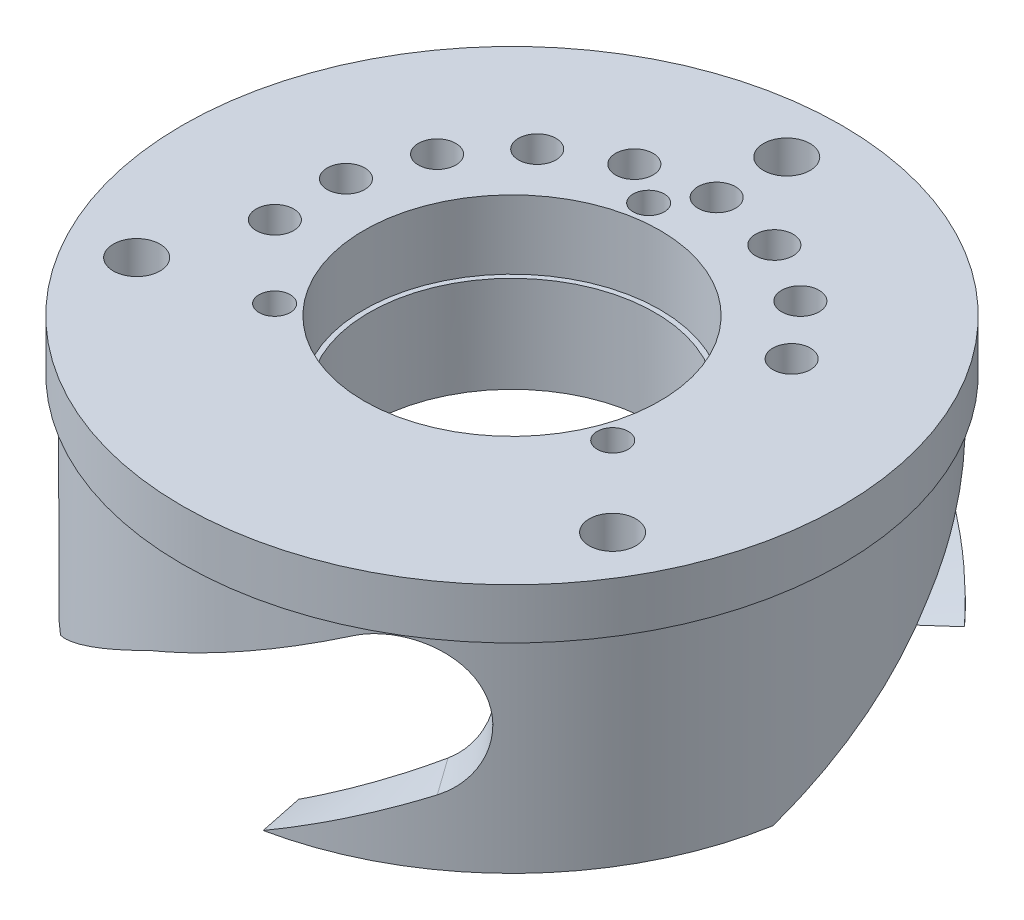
ISO-10303-21;
HEADER;
FILE_DESCRIPTION(('STEP AP214'),'2;1');
FILE_NAME('part.step','',(''),(''),'','','');
FILE_SCHEMA(('AUTOMOTIVE_DESIGN { 1 0 10303 214 1 1 1 1 }'));
ENDSEC;
DATA;
#1=APPLICATION_CONTEXT('core data for automotive mechanical design processes');
#2=APPLICATION_PROTOCOL_DEFINITION('international standard','automotive_design',2000,#1);
#3=PRODUCT_CONTEXT('',#1,'mechanical');
#4=PRODUCT('Part','Part','',(#3));
#5=PRODUCT_RELATED_PRODUCT_CATEGORY('part','',(#4));
#6=PRODUCT_DEFINITION_FORMATION('','',#4);
#7=PRODUCT_DEFINITION_CONTEXT('part definition',#1,'design');
#8=PRODUCT_DEFINITION('design','',#6,#7);
#9=PRODUCT_DEFINITION_SHAPE('','',#8);
#10=(LENGTH_UNIT() NAMED_UNIT(*) SI_UNIT(.MILLI.,.METRE.));
#11=(NAMED_UNIT(*) PLANE_ANGLE_UNIT() SI_UNIT($,.RADIAN.));
#12=(NAMED_UNIT(*) SI_UNIT($,.STERADIAN.) SOLID_ANGLE_UNIT());
#13=UNCERTAINTY_MEASURE_WITH_UNIT(LENGTH_MEASURE(1.E-05),#10,'distance_accuracy_value','');
#14=(GEOMETRIC_REPRESENTATION_CONTEXT(3) GLOBAL_UNCERTAINTY_ASSIGNED_CONTEXT((#13)) GLOBAL_UNIT_ASSIGNED_CONTEXT((#10,
#11,#12)) REPRESENTATION_CONTEXT('',''));
#15=CARTESIAN_POINT('',(0.,0.,0.));
#16=DIRECTION('',(0.,0.,1.));
#17=DIRECTION('',(1.,0.,0.));
#18=AXIS2_PLACEMENT_3D('',#15,#16,#17);
#19=CARTESIAN_POINT('',(0.,-35.56,0.));
#20=DIRECTION('',(0.,1.,0.));
#21=DIRECTION('',(0.,0.,1.));
#22=AXIS2_PLACEMENT_3D('',#19,#20,#21);
#23=PLANE('',#22);
#24=CARTESIAN_POINT('',(0.,-35.56,0.));
#25=DIRECTION('',(0.,-1.,0.));
#26=DIRECTION('',(0.,0.,-1.));
#27=AXIS2_PLACEMENT_3D('',#24,#25,#26);
#28=CIRCLE('',#27,44.45);
#29=CARTESIAN_POINT('',(-15.2870656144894,-35.56,-41.7385687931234));
#30=VERTEX_POINT('',#29);
#31=CARTESIAN_POINT('',(33.183279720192,-35.56,-29.5748617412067));
#32=VERTEX_POINT('',#31);
#33=EDGE_CURVE('E589',#30,#32,#28,.T.);
#34=ORIENTED_EDGE('',*,*,#33,.T.);
#35=CARTESIAN_POINT('',(22.7542489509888,-35.56,-20.2799051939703));
#36=CARTESIAN_POINT('',(33.183279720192,-35.56,-29.5748617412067));
#37=B_SPLINE_CURVE_WITH_KNOTS('',1,(#35,#36),.UNSPECIFIED.,.F.,.F.,(2,2),(0.,1.),.UNSPECIFIED.);
#38=CARTESIAN_POINT('',(28.442811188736,-35.56,-25.3498814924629));
#39=VERTEX_POINT('',#38);
#40=EDGE_CURVE('E440',#39,#32,#37,.T.);
#41=ORIENTED_EDGE('',*,*,#40,.F.);
#42=CARTESIAN_POINT('',(0.,-35.56,0.));
#43=DIRECTION('',(0.,-1.,0.));
#44=DIRECTION('',(0.,0.,-1.));
#45=AXIS2_PLACEMENT_3D('',#42,#43,#44);
#46=CIRCLE('',#45,38.1);
#47=CARTESIAN_POINT('',(3.23557390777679,-35.56,-37.96236375));
#48=VERTEX_POINT('',#47);
#49=EDGE_CURVE('E745',#48,#39,#46,.T.);
#50=ORIENTED_EDGE('',*,*,#49,.F.);
#51=CARTESIAN_POINT('',(0.,-35.56,-38.1));
#52=DIRECTION('',(0.,1.,0.));
#53=DIRECTION('',(0.,0.,1.));
#54=AXIS2_PLACEMENT_3D('',#51,#52,#53);
#55=CIRCLE('',#54,3.2385);
#56=CARTESIAN_POINT('',(-3.23557390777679,-35.56,-37.96236375));
#57=VERTEX_POINT('',#56);
#58=EDGE_CURVE('E940',#48,#57,#55,.T.);
#59=ORIENTED_EDGE('',*,*,#58,.T.);
#60=CARTESIAN_POINT('',(-13.1031990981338,-35.56,-35.7759161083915));
#61=VERTEX_POINT('',#60);
#62=EDGE_CURVE('E757',#61,#57,#46,.T.);
#63=ORIENTED_EDGE('',*,*,#62,.F.);
#64=CARTESIAN_POINT('',(-15.2870656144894,-35.56,-41.7385687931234));
#65=CARTESIAN_POINT('',(-10.482559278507,-35.56,-28.6207328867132));
#66=B_SPLINE_CURVE_WITH_KNOTS('',1,(#64,#65),.UNSPECIFIED.,.F.,.F.,(2,2),(0.,1.),.UNSPECIFIED.);
#67=EDGE_CURVE('E595',#61,#30,#66,.F.);
#68=ORIENTED_EDGE('',*,*,#67,.T.);
#69=EDGE_LOOP('',(#34,#41,#50,#59,#63,#68));
#70=FACE_BOUND('',#69,.T.);
#71=ADVANCED_FACE('F62',(#70),#23,.F.);
#72=CARTESIAN_POINT('',(0.,-22.86,0.));
#73=DIRECTION('',(0.,-1.,0.));
#74=DIRECTION('',(0.,0.,-1.));
#75=AXIS2_PLACEMENT_3D('',#72,#73,#74);
#76=CYLINDRICAL_SURFACE('',#75,38.1);
#77=ORIENTED_EDGE('',*,*,#49,.T.);
#78=CARTESIAN_POINT('',(28.442811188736,-35.56,-25.3498814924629));
#79=CARTESIAN_POINT('',(28.1017961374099,-35.2683581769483,-25.7325028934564));
#80=CARTESIAN_POINT('',(27.7530960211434,-34.9767377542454,-26.1082022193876));
#81=CARTESIAN_POINT('',(27.0408159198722,-34.3934837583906,-26.8452416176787));
#82=CARTESIAN_POINT('',(26.6772354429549,-34.1018501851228,-27.2065812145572));
#83=CARTESIAN_POINT('',(25.5652995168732,-33.2271547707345,-28.2679106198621));
#84=CARTESIAN_POINT('',(24.7954211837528,-32.6440183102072,-28.9455794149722));
#85=CARTESIAN_POINT('',(23.3767802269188,-31.604689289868,-30.0961721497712));
#86=CARTESIAN_POINT('',(22.7380781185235,-31.1484624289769,-30.581577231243));
#87=CARTESIAN_POINT('',(21.4313317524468,-30.2360067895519,-31.5111214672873));
#88=CARTESIAN_POINT('',(20.7632892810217,-29.7797780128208,-31.9552631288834));
#89=CARTESIAN_POINT('',(19.3921647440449,-28.8617028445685,-32.8056788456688));
#90=CARTESIAN_POINT('',(18.6887533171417,-28.3998562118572,-33.2114213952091));
#91=CARTESIAN_POINT('',(17.2574005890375,-27.4761126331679,-33.977223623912));
#92=CARTESIAN_POINT('',(16.529456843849,-27.0142156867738,-34.3372787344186));
#93=CARTESIAN_POINT('',(15.7907215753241,-26.5523245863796,-34.6736659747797));
#94=B_SPLINE_CURVE_WITH_KNOTS('',3,(#78,#79,#80,#81,#82,#83,#84,#85,#86,#87,#88,#89,#90,#91,#92,
#93),.UNSPECIFIED.,.F.,.F.,(4,2,2,2,2,2,2,4),(0.,1.76889207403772,3.53784267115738,
7.07404550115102,9.84140342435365,12.6085931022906,15.4097363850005,18.2111595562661),.UNSPECIFIED.);
#95=CARTESIAN_POINT('',(15.7907215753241,-26.5523245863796,-34.6736659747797));
#96=VERTEX_POINT('',#95);
#97=EDGE_CURVE('E446',#39,#96,#94,.T.);
#98=ORIENTED_EDGE('',*,*,#97,.T.);
#99=CARTESIAN_POINT('',(15.7907215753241,-26.5523245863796,-34.6736659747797));
#100=CARTESIAN_POINT('',(15.7562342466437,-26.5291123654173,-34.6893718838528));
#101=CARTESIAN_POINT('',(15.7217394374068,-26.5058714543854,-34.7050189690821));
#102=CARTESIAN_POINT('',(15.6527631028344,-26.4592788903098,-34.7361834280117));
#103=CARTESIAN_POINT('',(15.6182815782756,-26.4359272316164,-34.7517007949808));
#104=CARTESIAN_POINT('',(15.5493379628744,-26.3890447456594,-34.7826036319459));
#105=CARTESIAN_POINT('',(15.5148759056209,-26.3655137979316,-34.7979889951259));
#106=CARTESIAN_POINT('',(15.4461440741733,-26.3180399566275,-34.8285522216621));
#107=CARTESIAN_POINT('',(15.411874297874,-26.294097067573,-34.8437300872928));
#108=CARTESIAN_POINT('',(15.3435699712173,-26.2457790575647,-34.8738620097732));
#109=CARTESIAN_POINT('',(15.30953531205,-26.2214041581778,-34.8888161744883));
#110=CARTESIAN_POINT('',(15.2417970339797,-26.1720428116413,-34.9184620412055));
#111=CARTESIAN_POINT('',(15.2080934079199,-26.1470563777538,-34.9331537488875));
#112=CARTESIAN_POINT('',(15.1410796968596,-26.0964219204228,-34.9622516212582));
#113=CARTESIAN_POINT('',(15.1077694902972,-26.0707741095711,-34.9766578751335));
#114=CARTESIAN_POINT('',(15.0416201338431,-26.018707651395,-35.0051562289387));
#115=CARTESIAN_POINT('',(15.0087809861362,-25.9922890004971,-35.0192483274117));
#116=CARTESIAN_POINT('',(14.9435308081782,-25.9387940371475,-35.0471417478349));
#117=CARTESIAN_POINT('',(14.9111196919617,-25.9117178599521,-35.0609431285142));
#118=CARTESIAN_POINT('',(14.8467056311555,-25.8569471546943,-35.0882680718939));
#119=CARTESIAN_POINT('',(14.8147026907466,-25.8292526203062,-35.1017916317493));
#120=CARTESIAN_POINT('',(14.7192688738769,-25.7452972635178,-35.1419676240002));
#121=CARTESIAN_POINT('',(14.6564248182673,-25.6881744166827,-35.1682203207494));
#122=CARTESIAN_POINT('',(14.5338136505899,-25.5731986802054,-35.2190653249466));
#123=CARTESIAN_POINT('',(14.4740088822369,-25.5153967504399,-35.2436824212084));
#124=CARTESIAN_POINT('',(14.3557806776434,-25.3980426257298,-35.2920052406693));
#125=CARTESIAN_POINT('',(14.2973571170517,-25.3384905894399,-35.315711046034));
#126=CARTESIAN_POINT('',(14.1243030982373,-25.1571308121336,-35.3854424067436));
#127=CARTESIAN_POINT('',(14.0119041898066,-25.0326333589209,-35.4300757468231));
#128=CARTESIAN_POINT('',(13.7936695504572,-24.7768625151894,-35.515608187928));
#129=CARTESIAN_POINT('',(13.6878322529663,-24.6455907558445,-35.5565081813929));
#130=CARTESIAN_POINT('',(13.4886683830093,-24.3844117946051,-35.6325208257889));
#131=CARTESIAN_POINT('',(13.3949730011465,-24.2548422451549,-35.6678295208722));
#132=CARTESIAN_POINT('',(13.2136970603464,-23.9907797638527,-35.73538243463));
#133=CARTESIAN_POINT('',(13.1261148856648,-23.8562881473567,-35.7676274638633));
#134=CARTESIAN_POINT('',(12.9558854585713,-23.5806496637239,-35.8296438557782));
#135=CARTESIAN_POINT('',(12.8733364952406,-23.4394317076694,-35.8593687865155));
#136=CARTESIAN_POINT('',(12.7147836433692,-23.1527678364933,-35.9158923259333));
#137=CARTESIAN_POINT('',(12.6387807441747,-23.0073212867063,-35.9426904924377));
#138=CARTESIAN_POINT('',(12.5661114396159,-22.8599999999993,-35.9680808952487));
#139=B_SPLINE_CURVE_WITH_KNOTS('',3,(#99,#100,#101,#102,#103,#104,#105,#106,#107,#108,#109,#110,
#111,#112,#113,#114,#115,#116,#117,#118,#119,#120,#121,#122,#123,#124,#125,#126,#127,#128,#129,
#130,#131,#132,#133,#134,#135,#136,#137,#138),.UNSPECIFIED.,.F.,.F.,(4,2,2,2,2,2,2,2,2,2,2,2,2,
2,2,2,2,2,2,4),(0.,0.133318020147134,0.266642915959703,0.400067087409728,0.533489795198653,
0.666845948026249,0.800199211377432,0.933510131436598,1.06682166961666,1.20010601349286,
1.33339172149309,1.60001146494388,1.8601912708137,2.12034756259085,2.64072399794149,
3.16097571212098,3.65199990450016,4.1428938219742,4.64144506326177,5.14007152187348),.UNSPECIFIED.);
#140=CARTESIAN_POINT('',(12.5661114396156,-22.8599999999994,-35.9680808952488));
#141=VERTEX_POINT('',#140);
#142=EDGE_CURVE('E437',#96,#141,#139,.T.);
#143=ORIENTED_EDGE('',*,*,#142,.T.);
#144=CARTESIAN_POINT('',(0.,-22.86,0.));
#145=DIRECTION('',(0.,-1.,0.));
#146=DIRECTION('',(0.,0.,-1.));
#147=AXIS2_PLACEMENT_3D('',#144,#145,#146);
#148=CIRCLE('',#147,38.1);
#149=CARTESIAN_POINT('',(3.23557390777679,-22.86,-37.96236375));
#150=VERTEX_POINT('',#149);
#151=EDGE_CURVE('E1366',#150,#141,#148,.T.);
#152=ORIENTED_EDGE('',*,*,#151,.F.);
#153=DIRECTION('',(0.,1.,0.));
#154=VECTOR('',#153,1.);
#155=CARTESIAN_POINT('',(3.23557390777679,-17.78,-37.96236375));
#156=LINE('',#155,#154);
#157=EDGE_CURVE('E1385',#150,#48,#156,.F.);
#158=ORIENTED_EDGE('',*,*,#157,.T.);
#159=EDGE_LOOP('',(#77,#98,#143,#152,#158));
#160=FACE_BOUND('',#159,.T.);
#161=ADVANCED_FACE('F1403',(#160),#76,.F.);
#162=CARTESIAN_POINT('',(0.,-22.86,0.));
#163=DIRECTION('',(0.,1.,0.));
#164=DIRECTION('',(0.,0.,-1.));
#165=AXIS2_PLACEMENT_3D('',#162,#163,#164);
#166=CONICAL_SURFACE('',#165,38.1,0.0523598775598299);
#167=ORIENTED_EDGE('',*,*,#151,.T.);
#168=CARTESIAN_POINT('',(12.5661114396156,-22.8599999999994,-35.9680808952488));
#169=CARTESIAN_POINT('',(12.4387308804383,-22.5923977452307,-36.0274145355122));
#170=CARTESIAN_POINT('',(12.3223546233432,-22.3186936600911,-36.082475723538));
#171=CARTESIAN_POINT('',(12.1119522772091,-21.761490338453,-36.1844541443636));
#172=CARTESIAN_POINT('',(12.017916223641,-21.4779955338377,-36.2313750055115));
#173=CARTESIAN_POINT('',(11.852543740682,-20.9038005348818,-36.3174623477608));
#174=CARTESIAN_POINT('',(11.7811739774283,-20.6131116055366,-36.3566401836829));
#175=CARTESIAN_POINT('',(11.6611169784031,-20.026172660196,-36.4276252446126));
#176=CARTESIAN_POINT('',(11.6124326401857,-19.7299219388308,-36.4594315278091));
#177=CARTESIAN_POINT('',(11.5374390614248,-19.1304308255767,-36.5161829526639));
#178=CARTESIAN_POINT('',(11.5113961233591,-18.8271492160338,-36.5410441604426));
#179=CARTESIAN_POINT('',(11.4827511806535,-18.2189718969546,-36.5834635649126));
#180=CARTESIAN_POINT('',(11.4801493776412,-17.9140761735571,-36.6010216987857));
#181=CARTESIAN_POINT('',(11.4984811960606,-17.3043138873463,-36.6287620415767));
#182=CARTESIAN_POINT('',(11.519440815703,-16.9994477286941,-36.6389360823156));
#183=CARTESIAN_POINT('',(11.584979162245,-16.3920927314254,-36.6516497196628));
#184=CARTESIAN_POINT('',(11.6295584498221,-16.0896039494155,-36.654189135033));
#185=CARTESIAN_POINT('',(11.7446394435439,-15.4765896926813,-36.6512184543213));
#186=CARTESIAN_POINT('',(11.8161413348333,-15.1662525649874,-36.6453694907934));
#187=CARTESIAN_POINT('',(11.9846126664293,-14.5528350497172,-36.6244450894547));
#188=CARTESIAN_POINT('',(12.0815845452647,-14.2497553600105,-36.6093687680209));
#189=CARTESIAN_POINT('',(12.3005152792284,-13.6541305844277,-36.5693258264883));
#190=CARTESIAN_POINT('',(12.4224218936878,-13.3615649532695,-36.544379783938));
#191=CARTESIAN_POINT('',(12.6908888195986,-12.7891571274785,-36.4837805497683));
#192=CARTESIAN_POINT('',(12.8374418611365,-12.5093112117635,-36.448130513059));
#193=CARTESIAN_POINT('',(13.1075370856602,-12.0458050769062,-36.3775073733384));
#194=CARTESIAN_POINT('',(13.2250704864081,-11.8581706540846,-36.3454508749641));
#195=CARTESIAN_POINT('',(13.4716248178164,-11.4918049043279,-36.2752697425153));
#196=CARTESIAN_POINT('',(13.6006440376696,-11.3130722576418,-36.2371460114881));
#197=CARTESIAN_POINT('',(13.8700420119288,-10.9652667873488,-36.1544139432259));
#198=CARTESIAN_POINT('',(14.0104462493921,-10.7962171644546,-36.1097908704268));
#199=CARTESIAN_POINT('',(14.3018511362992,-10.4693421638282,-36.0138017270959));
#200=CARTESIAN_POINT('',(14.4528590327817,-10.3115246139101,-35.9624310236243));
#201=CARTESIAN_POINT('',(14.6088191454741,-10.16,-35.9075549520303));
#202=B_SPLINE_CURVE_WITH_KNOTS('',3,(#168,#169,#170,#171,#172,#173,#174,#175,#176,#177,#178,
#179,#180,#181,#182,#183,#184,#185,#186,#187,#188,#189,#190,#191,#192,#193,#194,#195,#196,#197,
#198,#199,#200,#201),.UNSPECIFIED.,.F.,.F.,(4,2,2,2,2,2,2,2,2,2,2,2,2,2,2,2,4),(0.,
0.906363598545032,1.81232216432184,2.71694215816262,3.62167766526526,4.53691581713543,
5.45216184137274,6.36841876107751,7.28469743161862,8.2390503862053,9.1934947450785,
10.1459595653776,11.0981439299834,11.7687865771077,12.4393294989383,13.1114170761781,
13.7839685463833),.UNSPECIFIED.);
#203=CARTESIAN_POINT('',(14.6088191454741,-10.16,-35.9075549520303));
#204=VERTEX_POINT('',#203);
#205=EDGE_CURVE('E427',#141,#204,#202,.T.);
#206=ORIENTED_EDGE('',*,*,#205,.T.);
#207=CARTESIAN_POINT('',(0.,-10.16,0.));
#208=DIRECTION('',(0.,-1.,0.));
#209=DIRECTION('',(0.,0.,-1.));
#210=AXIS2_PLACEMENT_3D('',#207,#208,#209);
#211=CIRCLE('',#210,38.7655787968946);
#212=CARTESIAN_POINT('',(3.19421142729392,-10.16,-38.6337561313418));
#213=VERTEX_POINT('',#212);
#214=EDGE_CURVE('E750',#213,#204,#211,.T.);
#215=ORIENTED_EDGE('',*,*,#214,.F.);
#216=CARTESIAN_POINT('',(3.19420964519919,-10.1598,-38.6337667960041));
#217=CARTESIAN_POINT('',(3.20380959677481,-11.2377364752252,-38.5762876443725));
#218=CARTESIAN_POINT('',(3.2118041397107,-12.315693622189,-38.5189330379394));
#219=CARTESIAN_POINT('',(3.22467093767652,-14.4716313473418,-38.404473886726));
#220=CARTESIAN_POINT('',(3.22954321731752,-15.549611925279,-38.3473693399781));
#221=CARTESIAN_POINT('',(3.23613200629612,-17.6663499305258,-38.2354847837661));
#222=CARTESIAN_POINT('',(3.23795694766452,-18.7051065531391,-38.1806958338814));
#223=CARTESIAN_POINT('',(3.23883394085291,-20.7826411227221,-38.0713501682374));
#224=CARTESIAN_POINT('',(3.23788597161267,-21.8214190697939,-38.0167934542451));
#225=CARTESIAN_POINT('',(3.23557346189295,-22.8602,-37.9623532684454));
#226=B_SPLINE_CURVE_WITH_KNOTS('',3,(#216,#217,#218,#219,#220,#221,#222,#223,#224,#225),
.UNSPECIFIED.,.F.,.F.,(4,2,2,2,4),(0.,3.23853010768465,6.4770346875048,9.59763738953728,
12.718263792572),.UNSPECIFIED.);
#227=EDGE_CURVE('E954',#213,#150,#226,.T.);
#228=ORIENTED_EDGE('',*,*,#227,.T.);
#229=EDGE_LOOP('',(#167,#206,#215,#228));
#230=FACE_BOUND('',#229,.T.);
#231=ADVANCED_FACE('F971',(#230),#166,.F.);
#232=CARTESIAN_POINT('',(0.,-10.16,-83.9614213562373));
#233=DIRECTION('',(0.,-1.,0.));
#234=DIRECTION('',(0.,0.,-1.));
#235=AXIS2_PLACEMENT_3D('',#232,#233,#234);
#236=PLANE('',#235);
#237=CARTESIAN_POINT('',(0.,-10.16,0.));
#238=DIRECTION('',(0.,-1.,0.));
#239=DIRECTION('',(0.,0.,-1.));
#240=AXIS2_PLACEMENT_3D('',#237,#238,#239);
#241=CIRCLE('',#240,23.0834212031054);
#242=CARTESIAN_POINT('',(0.,-10.16,-23.0834212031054));
#243=VERTEX_POINT('',#242);
#244=EDGE_CURVE('E1371',#243,#243,#241,.T.);
#245=ORIENTED_EDGE('',*,*,#244,.F.);
#246=EDGE_LOOP('',(#245));
#247=FACE_BOUND('',#246,.T.);
#248=CARTESIAN_POINT('',(0.,-10.16,-28.3845));
#249=DIRECTION('',(0.,-1.,0.));
#250=DIRECTION('',(0.,0.,-1.));
#251=AXIS2_PLACEMENT_3D('',#248,#249,#250);
#252=CIRCLE('',#251,2.6035);
#253=CARTESIAN_POINT('',(0.,-10.16,-30.988));
#254=VERTEX_POINT('',#253);
#255=EDGE_CURVE('E939',#254,#254,#252,.T.);
#256=ORIENTED_EDGE('',*,*,#255,.F.);
#257=EDGE_LOOP('',(#256));
#258=FACE_BOUND('',#257,.T.);
#259=CARTESIAN_POINT('',(24.5816980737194,-10.16,-14.1922499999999));
#260=DIRECTION('',(0.,-1.,0.));
#261=DIRECTION('',(0.86602540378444,0.,-0.499999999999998));
#262=AXIS2_PLACEMENT_3D('',#259,#260,#261);
#263=CIRCLE('',#262,2.6035);
#264=CARTESIAN_POINT('',(26.8363952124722,-10.16,-15.4939999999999));
#265=VERTEX_POINT('',#264);
#266=EDGE_CURVE('E846',#265,#265,#263,.T.);
#267=ORIENTED_EDGE('',*,*,#266,.F.);
#268=EDGE_LOOP('',(#267));
#269=FACE_BOUND('',#268,.T.);
#270=CARTESIAN_POINT('',(-9.70807075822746,-10.16,-26.6727051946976));
#271=DIRECTION('',(0.,-1.,0.));
#272=DIRECTION('',(-0.342020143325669,0.,-0.939692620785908));
#273=AXIS2_PLACEMENT_3D('',#270,#271,#272);
#274=CIRCLE('',#273,2.6035);
#275=CARTESIAN_POINT('',(-10.5985202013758,-10.16,-29.1191949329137));
#276=VERTEX_POINT('',#275);
#277=EDGE_CURVE('E840',#276,#276,#274,.T.);
#278=ORIENTED_EDGE('',*,*,#277,.F.);
#279=EDGE_LOOP('',(#278));
#280=FACE_BOUND('',#279,.T.);
#281=CARTESIAN_POINT('',(-18.2452049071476,-10.16,-21.7437884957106));
#282=DIRECTION('',(0.,-1.,0.));
#283=DIRECTION('',(-0.64278760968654,0.,-0.766044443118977));
#284=AXIS2_PLACEMENT_3D('',#281,#282,#283);
#285=CIRCLE('',#284,2.6035);
#286=CARTESIAN_POINT('',(-19.9187024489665,-10.16,-23.7381852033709));
#287=VERTEX_POINT('',#286);
#288=EDGE_CURVE('E834',#287,#287,#285,.T.);
#289=ORIENTED_EDGE('',*,*,#288,.F.);
#290=EDGE_LOOP('',(#289));
#291=FACE_BOUND('',#290,.T.);
#292=CARTESIAN_POINT('',(-24.5816980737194,-10.16,-14.1922499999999));
#293=DIRECTION('',(0.,-1.,0.));
#294=DIRECTION('',(-0.86602540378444,0.,-0.499999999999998));
#295=AXIS2_PLACEMENT_3D('',#292,#293,#294);
#296=CIRCLE('',#295,2.6035);
#297=CARTESIAN_POINT('',(-26.8363952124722,-10.16,-15.4939999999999));
#298=VERTEX_POINT('',#297);
#299=EDGE_CURVE('E828',#298,#298,#296,.T.);
#300=ORIENTED_EDGE('',*,*,#299,.F.);
#301=EDGE_LOOP('',(#300));
#302=FACE_BOUND('',#301,.T.);
#303=CARTESIAN_POINT('',(9.70807075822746,-10.16,-26.6727051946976));
#304=DIRECTION('',(0.,-1.,0.));
#305=DIRECTION('',(0.342020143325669,0.,-0.939692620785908));
#306=AXIS2_PLACEMENT_3D('',#303,#304,#305);
#307=CIRCLE('',#306,2.6035);
#308=CARTESIAN_POINT('',(11.9143562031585,-10.16,-28.0549196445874));
#309=VERTEX_POINT('',#308);
#310=CARTESIAN_POINT('',(11.5855045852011,-10.16,-28.4764386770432));
#311=VERTEX_POINT('',#310);
#312=EDGE_CURVE('E858',#309,#311,#307,.T.);
#313=ORIENTED_EDGE('',*,*,#312,.F.);
#314=CARTESIAN_POINT('',(0.,-10.16,0.));
#315=DIRECTION('',(0.,-1.,0.));
#316=DIRECTION('',(0.866025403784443,0.,0.499999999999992));
#317=AXIS2_PLACEMENT_3D('',#314,#315,#316);
#318=CIRCLE('',#317,30.48);
#319=CARTESIAN_POINT('',(18.339095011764,-10.16,-24.3455949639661));
#320=VERTEX_POINT('',#319);
#321=EDGE_CURVE('E2086',#309,#320,#318,.T.);
#322=ORIENTED_EDGE('',*,*,#321,.T.);
#323=CARTESIAN_POINT('',(18.2452049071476,-10.16,-21.7437884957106));
#324=DIRECTION('',(0.,-1.,0.));
#325=DIRECTION('',(0.642787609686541,0.,-0.766044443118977));
#326=AXIS2_PLACEMENT_3D('',#323,#324,#325);
#327=CIRCLE('',#326,2.6035);
#328=CARTESIAN_POINT('',(19.2483877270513,-10.16,-24.1462531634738));
#329=VERTEX_POINT('',#328);
#330=EDGE_CURVE('E852',#329,#320,#327,.T.);
#331=ORIENTED_EDGE('',*,*,#330,.F.);
#332=CARTESIAN_POINT('',(24.7295749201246,-10.16,-31.0221595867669));
#333=CARTESIAN_POINT('',(24.000611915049,-10.16,-30.1077074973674));
#334=CARTESIAN_POINT('',(23.2716488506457,-10.16,-29.1932554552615));
#335=CARTESIAN_POINT('',(21.361543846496,-10.16,-26.7971132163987));
#336=CARTESIAN_POINT('',(20.1804018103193,-10.16,-25.3154230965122));
#337=CARTESIAN_POINT('',(18.9992596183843,-10.16,-23.8337331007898));
#338=B_SPLINE_CURVE_WITH_KNOTS('',3,(#332,#333,#334,#335,#336,#337),.UNSPECIFIED.,.F.,.F.,(4,2,
4),(0.,3.50834536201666,9.19293145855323),.UNSPECIFIED.);
#339=CARTESIAN_POINT('',(24.1641061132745,-10.16,-30.3128038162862));
#340=VERTEX_POINT('',#339);
#341=EDGE_CURVE('E404',#340,#329,#338,.T.);
#342=ORIENTED_EDGE('',*,*,#341,.F.);
#343=CARTESIAN_POINT('',(35.0549199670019,-10.16,16.5506098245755));
#344=VERTEX_POINT('',#343);
#345=EDGE_CURVE('E340',#340,#344,#211,.T.);
#346=ORIENTED_EDGE('',*,*,#345,.T.);
#347=CARTESIAN_POINT('',(32.9955678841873,-10.16,19.0499999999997));
#348=DIRECTION('',(0.,-1.,0.));
#349=DIRECTION('',(0.866025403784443,0.,0.499999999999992));
#350=AXIS2_PLACEMENT_3D('',#347,#348,#349);
#351=CIRCLE('',#350,3.2385);
#352=CARTESIAN_POINT('',(31.8607085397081,-10.16,22.0831463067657));
#353=VERTEX_POINT('',#352);
#354=EDGE_CURVE('E875',#353,#344,#351,.T.);
#355=ORIENTED_EDGE('',*,*,#354,.F.);
#356=CARTESIAN_POINT('',(23.7924452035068,-10.16,30.6053859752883));
#357=VERTEX_POINT('',#356);
#358=EDGE_CURVE('E1408',#353,#357,#211,.T.);
#359=ORIENTED_EDGE('',*,*,#358,.T.);
#360=CARTESIAN_POINT('',(18.707140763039,-10.1599999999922,24.063910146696));
#361=CARTESIAN_POINT('',(19.6403478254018,-10.1599999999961,25.264340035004));
#362=CARTESIAN_POINT('',(20.5735548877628,-10.1599999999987,26.4647699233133));
#363=CARTESIAN_POINT('',(22.4399690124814,-10.1600000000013,28.8656296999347));
#364=CARTESIAN_POINT('',(23.3731760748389,-10.1600000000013,30.0660595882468));
#365=CARTESIAN_POINT('',(24.3063831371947,-10.16,31.2664894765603));
#366=B_SPLINE_CURVE_WITH_KNOTS('',3,(#360,#361,#362,#363,#364,#365),.UNSPECIFIED.,.F.,.F.,(4,2,
4),(0.,4.56148726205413,9.12297452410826),.UNSPECIFIED.);
#367=CARTESIAN_POINT('',(18.8685670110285,-10.16,24.2715606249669));
#368=VERTEX_POINT('',#367);
#369=EDGE_CURVE('E1418',#368,#357,#366,.T.);
#370=ORIENTED_EDGE('',*,*,#369,.F.);
#371=CARTESIAN_POINT('',(18.2452049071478,-10.16,21.7437884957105));
#372=DIRECTION('',(0.,-1.,0.));
#373=DIRECTION('',(-0.866025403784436,0.,0.500000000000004));
#374=AXIS2_PLACEMENT_3D('',#371,#372,#373);
#375=CIRCLE('',#374,2.6035);
#376=CARTESIAN_POINT('',(18.3390950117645,-10.16,24.3455949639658));
#377=VERTEX_POINT('',#376);
#378=EDGE_CURVE('E1118',#368,#377,#375,.T.);
#379=ORIENTED_EDGE('',*,*,#378,.T.);
#380=CARTESIAN_POINT('',(0.,-10.16,0.));
#381=DIRECTION('',(0.,-1.,0.));
#382=DIRECTION('',(-0.866025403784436,0.,0.500000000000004));
#383=AXIS2_PLACEMENT_3D('',#380,#381,#382);
#384=CIRCLE('',#383,30.48);
#385=CARTESIAN_POINT('',(11.9143562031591,-10.16,28.0549196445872));
#386=VERTEX_POINT('',#385);
#387=EDGE_CURVE('E1132',#377,#386,#384,.T.);
#388=ORIENTED_EDGE('',*,*,#387,.T.);
#389=CARTESIAN_POINT('',(9.70807075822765,-10.16,26.6727051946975));
#390=DIRECTION('',(0.,-1.,0.));
#391=DIRECTION('',(-0.866025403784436,0.,0.500000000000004));
#392=AXIS2_PLACEMENT_3D('',#389,#390,#391);
#393=CIRCLE('',#392,2.6035);
#394=CARTESIAN_POINT('',(11.2870747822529,-10.16,28.742719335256));
#395=VERTEX_POINT('',#394);
#396=EDGE_CURVE('E1120',#386,#395,#393,.T.);
#397=ORIENTED_EDGE('',*,*,#396,.T.);
#398=CARTESIAN_POINT('',(14.5011908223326,-10.16,36.927519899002));
#399=CARTESIAN_POINT('',(14.0737335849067,-10.16,35.8389933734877));
#400=CARTESIAN_POINT('',(13.6462764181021,-10.16,34.7504668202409));
#401=CARTESIAN_POINT('',(12.5262088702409,-10.16,31.8981962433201));
#402=CARTESIAN_POINT('',(11.8335986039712,-10.16,30.1344521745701));
#403=CARTESIAN_POINT('',(11.1409885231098,-10.16,28.3707080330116));
#404=B_SPLINE_CURVE_WITH_KNOTS('',3,(#398,#399,#400,#401,#402,#403),.UNSPECIFIED.,.F.,.F.,(4,2,
4),(0.,3.50834536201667,9.19293145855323),.UNSPECIFIED.);
#405=CARTESIAN_POINT('',(14.1696051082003,-10.16,36.0831316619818));
#406=VERTEX_POINT('',#405);
#407=EDGE_CURVE('E1449',#406,#395,#404,.T.);
#408=ORIENTED_EDGE('',*,*,#407,.F.);
#409=CARTESIAN_POINT('',(-31.8607085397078,-10.16,22.0831463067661));
#410=VERTEX_POINT('',#409);
#411=EDGE_CURVE('E1409',#406,#410,#211,.T.);
#412=ORIENTED_EDGE('',*,*,#411,.T.);
#413=CARTESIAN_POINT('',(-32.995567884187,-10.16,19.0500000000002));
#414=DIRECTION('',(0.,-1.,0.));
#415=DIRECTION('',(-0.866025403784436,0.,0.500000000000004));
#416=AXIS2_PLACEMENT_3D('',#413,#414,#415);
#417=CIRCLE('',#416,3.2385);
#418=CARTESIAN_POINT('',(-35.0549199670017,-10.16,16.550609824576));
#419=VERTEX_POINT('',#418);
#420=EDGE_CURVE('E913',#419,#410,#417,.T.);
#421=ORIENTED_EDGE('',*,*,#420,.F.);
#422=CARTESIAN_POINT('',(-38.4012643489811,-10.16,5.30216897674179));
#423=VERTEX_POINT('',#422);
#424=EDGE_CURVE('E1407',#419,#423,#211,.T.);
#425=ORIENTED_EDGE('',*,*,#424,.T.);
#426=CARTESIAN_POINT('',(-30.1935278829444,-10.1599999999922,4.16890405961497));
#427=CARTESIAN_POINT('',(-31.6997341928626,-10.1599999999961,4.37687013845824));
#428=CARTESIAN_POINT('',(-33.2059405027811,-10.1599999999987,4.5848362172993));
#429=CARTESIAN_POINT('',(-36.2183531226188,-10.1600000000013,5.00076837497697));
#430=CARTESIAN_POINT('',(-37.7245594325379,-10.1600000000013,5.20873445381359));
#431=CARTESIAN_POINT('',(-39.2307657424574,-10.16,5.41670053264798));
#432=B_SPLINE_CURVE_WITH_KNOTS('',3,(#426,#427,#428,#429,#430,#431),.UNSPECIFIED.,.F.,.F.,(4,2,
4),(0.,4.56148726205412,9.12297452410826),.UNSPECIFIED.);
#433=CARTESIAN_POINT('',(-30.4540715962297,-10.16,4.20487805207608));
#434=VERTEX_POINT('',#433);
#435=EDGE_CURVE('E984',#434,#423,#432,.T.);
#436=ORIENTED_EDGE('',*,*,#435,.F.);
#437=CARTESIAN_POINT('',(-27.953275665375,-10.16,4.92891669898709));
#438=DIRECTION('',(0.,-1.,0.));
#439=DIRECTION('',(-0.984807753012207,0.,0.173648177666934));
#440=AXIS2_PLACEMENT_3D('',#437,#438,#439);
#441=CIRCLE('',#440,2.6035);
#442=CARTESIAN_POINT('',(-30.2534512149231,-10.16,3.70932468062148));
#443=VERTEX_POINT('',#442);
#444=EDGE_CURVE('E814',#443,#434,#441,.T.);
#445=ORIENTED_EDGE('',*,*,#444,.F.);
#446=CARTESIAN_POINT('',(0.,-10.16,0.));
#447=DIRECTION('',(0.,-1.,0.));
#448=DIRECTION('',(0.,0.,-1.));
#449=AXIS2_PLACEMENT_3D('',#446,#447,#448);
#450=CIRCLE('',#449,30.48);
#451=CARTESIAN_POINT('',(-30.2534512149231,-10.16,-3.70932468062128));
#452=VERTEX_POINT('',#451);
#453=EDGE_CURVE('E784',#443,#452,#450,.T.);
#454=ORIENTED_EDGE('',*,*,#453,.T.);
#455=CARTESIAN_POINT('',(-27.953275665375,-10.16,-4.9289166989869));
#456=DIRECTION('',(0.,-1.,0.));
#457=DIRECTION('',(-0.984807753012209,0.,-0.173648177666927));
#458=AXIS2_PLACEMENT_3D('',#455,#456,#457);
#459=CIRCLE('',#458,2.6035);
#460=CARTESIAN_POINT('',(-30.5354625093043,-10.16,-4.59646617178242));
#461=VERTEX_POINT('',#460);
#462=EDGE_CURVE('E822',#461,#452,#459,.T.);
#463=ORIENTED_EDGE('',*,*,#462,.F.);
#464=CARTESIAN_POINT('',(-39.2307657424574,-10.16,-5.90536031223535));
#465=CARTESIAN_POINT('',(-38.0743454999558,-10.16,-5.7312858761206));
#466=CARTESIAN_POINT('',(-36.9179252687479,-10.16,-5.55721136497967));
#467=CARTESIAN_POINT('',(-33.887752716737,-10.16,-5.10108302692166));
#468=CARTESIAN_POINT('',(-32.0140004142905,-10.16,-4.81902907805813));
#469=CARTESIAN_POINT('',(-30.1402481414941,-10.16,-4.536974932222));
#470=B_SPLINE_CURVE_WITH_KNOTS('',3,(#464,#465,#466,#467,#468,#469),.UNSPECIFIED.,.F.,.F.,(4,2,
4),(0.,3.50834536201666,9.19293145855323),.UNSPECIFIED.);
#471=CARTESIAN_POINT('',(-38.3337112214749,-10.16,-5.77032784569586));
#472=VERTEX_POINT('',#471);
#473=EDGE_CURVE('E976',#472,#461,#470,.T.);
#474=ORIENTED_EDGE('',*,*,#473,.F.);
#475=CARTESIAN_POINT('',(-3.19421142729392,-10.16,-38.6337561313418));
#476=VERTEX_POINT('',#475);
#477=EDGE_CURVE('E1411',#472,#476,#211,.T.);
#478=ORIENTED_EDGE('',*,*,#477,.T.);
#479=CARTESIAN_POINT('',(0.,-10.16,-38.1));
#480=DIRECTION('',(0.,-1.,0.));
#481=DIRECTION('',(0.,0.,-1.));
#482=AXIS2_PLACEMENT_3D('',#479,#480,#481);
#483=CIRCLE('',#482,3.2385);
#484=EDGE_CURVE('E73',#213,#476,#483,.T.);
#485=ORIENTED_EDGE('',*,*,#484,.F.);
#486=ORIENTED_EDGE('',*,*,#214,.T.);
#487=CARTESIAN_POINT('',(11.4863871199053,-10.1599999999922,-28.2328142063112));
#488=CARTESIAN_POINT('',(12.0593863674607,-10.1599999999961,-29.6412101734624));
#489=CARTESIAN_POINT('',(12.6323856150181,-10.1599999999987,-31.0496061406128));
#490=CARTESIAN_POINT('',(13.7783841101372,-10.1600000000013,-33.8663980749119));
#491=CARTESIAN_POINT('',(14.3513833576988,-10.1600000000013,-35.2747940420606));
#492=CARTESIAN_POINT('',(14.9243826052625,-10.16,-36.6831900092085));
#493=B_SPLINE_CURVE_WITH_KNOTS('',3,(#487,#488,#489,#490,#491,#492),.UNSPECIFIED.,.F.,.F.,(4,2,
4),(0.,4.56148726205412,9.12297452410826),.UNSPECIFIED.);
#494=EDGE_CURVE('E422',#311,#204,#493,.T.);
#495=ORIENTED_EDGE('',*,*,#494,.F.);
#496=EDGE_LOOP('',(#313,#322,#331,#342,#346,#355,#359,#370,#379,#388,#397,#408,#412,#421,#425,
#436,#445,#454,#463,#474,#478,#485,#486,#495));
#497=FACE_BOUND('',#496,.T.);
#498=ADVANCED_FACE('F967',(#247,#258,#269,#280,#291,#302,#497),#236,.T.);
#499=CARTESIAN_POINT('',(9.70807075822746,-12.7,-26.6727051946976));
#500=DIRECTION('',(0.,1.,0.));
#501=DIRECTION('',(-0.342020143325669,0.,0.939692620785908));
#502=AXIS2_PLACEMENT_3D('',#499,#500,#501);
#503=CYLINDRICAL_SURFACE('',#502,2.6035);
#504=CARTESIAN_POINT('',(9.70807075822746,0.,-26.6727051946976));
#505=DIRECTION('',(0.,1.,0.));
#506=DIRECTION('',(-0.342020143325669,0.,0.939692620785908));
#507=AXIS2_PLACEMENT_3D('',#504,#505,#506);
#508=CIRCLE('',#507,2.6035);
#509=CARTESIAN_POINT('',(8.81762131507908,0.,-24.2262154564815));
#510=VERTEX_POINT('',#509);
#511=EDGE_CURVE('E861',#510,#510,#508,.T.);
#512=ORIENTED_EDGE('',*,*,#511,.T.);
#513=EDGE_LOOP('',(#512));
#514=FACE_BOUND('',#513,.T.);
#515=DIRECTION('',(0.,-1.,0.));
#516=VECTOR('',#515,1.);
#517=CARTESIAN_POINT('',(11.9143562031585,-21.7017407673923,-28.0549196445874));
#518=LINE('',#517,#516);
#519=CARTESIAN_POINT('',(11.9144194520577,-9.66496710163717,-28.0548186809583));
#520=VERTEX_POINT('',#519);
#521=EDGE_CURVE('E1220',#309,#520,#518,.F.);
#522=ORIENTED_EDGE('',*,*,#521,.F.);
#523=ORIENTED_EDGE('',*,*,#312,.T.);
#524=CARTESIAN_POINT('',(11.5855045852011,-10.16,-28.4764386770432));
#525=CARTESIAN_POINT('',(11.6048503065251,-10.1304830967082,-28.4563021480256));
#526=CARTESIAN_POINT('',(11.6240875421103,-10.1012575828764,-28.4356307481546));
#527=CARTESIAN_POINT('',(11.6622397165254,-10.0434905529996,-28.3932421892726));
#528=CARTESIAN_POINT('',(11.6811552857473,-10.0149476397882,-28.3715275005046));
#529=CARTESIAN_POINT('',(11.7186238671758,-9.95854781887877,-28.3270127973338));
#530=CARTESIAN_POINT('',(11.7371772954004,-9.93069011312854,-28.3042141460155));
#531=CARTESIAN_POINT('',(11.7738800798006,-9.87565844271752,-28.2574849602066));
#532=CARTESIAN_POINT('',(11.7920293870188,-9.84848456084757,-28.2335542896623));
#533=CARTESIAN_POINT('',(11.8278698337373,-9.79483259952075,-28.1845210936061));
#534=CARTESIAN_POINT('',(11.8455604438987,-9.768355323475,-28.1594173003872));
#535=CARTESIAN_POINT('',(11.8804270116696,-9.71610423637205,-28.1079918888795));
#536=CARTESIAN_POINT('',(11.8976016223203,-9.69033227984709,-28.0816674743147));
#537=CARTESIAN_POINT('',(11.9144573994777,-9.66496530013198,-28.0547581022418));
#538=B_SPLINE_CURVE_WITH_KNOTS('',3,(#524,#525,#526,#527,#528,#529,#530,#531,#532,#533,#534,
#535,#536,#537),.UNSPECIFIED.,.F.,.F.,(4,2,2,2,2,2,4),(0.,0.121894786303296,0.243513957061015,
0.36498404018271,0.486468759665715,0.608087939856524,0.73000101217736),.UNSPECIFIED.);
#539=EDGE_CURVE('E360',#311,#520,#538,.T.);
#540=ORIENTED_EDGE('',*,*,#539,.T.);
#541=EDGE_LOOP('',(#522,#523,#540));
#542=FACE_BOUND('',#541,.T.);
#543=ADVANCED_FACE('F886',(#514,#542),#503,.F.);
#544=CARTESIAN_POINT('',(18.2452049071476,-12.7,-21.7437884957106));
#545=DIRECTION('',(0.,1.,0.));
#546=DIRECTION('',(-0.642787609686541,0.,0.766044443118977));
#547=AXIS2_PLACEMENT_3D('',#544,#545,#546);
#548=CYLINDRICAL_SURFACE('',#547,2.6035);
#549=CARTESIAN_POINT('',(18.2452049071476,0.,-21.7437884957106));
#550=DIRECTION('',(0.,1.,0.));
#551=DIRECTION('',(-0.642787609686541,0.,0.766044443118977));
#552=AXIS2_PLACEMENT_3D('',#549,#550,#551);
#553=CIRCLE('',#552,2.6035);
#554=CARTESIAN_POINT('',(16.5717073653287,0.,-19.7493917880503));
#555=VERTEX_POINT('',#554);
#556=EDGE_CURVE('E855',#555,#555,#553,.T.);
#557=ORIENTED_EDGE('',*,*,#556,.T.);
#558=EDGE_LOOP('',(#557));
#559=FACE_BOUND('',#558,.T.);
#560=DIRECTION('',(0.,-1.,0.));
#561=VECTOR('',#560,1.);
#562=CARTESIAN_POINT('',(18.339095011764,-21.7017407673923,-24.3455949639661));
#563=LINE('',#562,#561);
#564=CARTESIAN_POINT('',(18.3390337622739,-9.5657668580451,-24.3455971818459));
#565=VERTEX_POINT('',#564);
#566=EDGE_CURVE('E449',#565,#320,#563,.T.);
#567=ORIENTED_EDGE('',*,*,#566,.F.);
#568=CARTESIAN_POINT('',(18.3389970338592,-9.56574685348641,-24.3455984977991));
#569=CARTESIAN_POINT('',(18.3791003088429,-9.5891497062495,-24.3441527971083));
#570=CARTESIAN_POINT('',(18.4190275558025,-9.61279393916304,-24.3417851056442));
#571=CARTESIAN_POINT('',(18.4982866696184,-9.66041214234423,-24.3352621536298));
#572=CARTESIAN_POINT('',(18.5376204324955,-9.68438409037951,-24.3311151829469));
#573=CARTESIAN_POINT('',(18.6157037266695,-9.73264934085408,-24.3210908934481));
#574=CARTESIAN_POINT('',(18.6544546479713,-9.75694147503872,-24.3152187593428));
#575=CARTESIAN_POINT('',(18.7313810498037,-9.8058427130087,-24.3017891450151));
#576=CARTESIAN_POINT('',(18.769557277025,-9.83045131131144,-24.2942340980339));
#577=CARTESIAN_POINT('',(18.845332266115,-9.87997886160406,-24.2774745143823));
#578=CARTESIAN_POINT('',(18.8829311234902,-9.90489776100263,-24.2682702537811));
#579=CARTESIAN_POINT('',(18.9575663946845,-9.95505482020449,-24.2482342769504));
#580=CARTESIAN_POINT('',(18.9946018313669,-9.98029342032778,-24.2374000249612));
#581=CARTESIAN_POINT('',(19.0681115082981,-10.0310946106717,-24.2141180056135));
#582=CARTESIAN_POINT('',(19.1045837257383,-10.056657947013,-24.2016654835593));
#583=CARTESIAN_POINT('',(19.1769647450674,-10.1081155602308,-24.1751518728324));
#584=CARTESIAN_POINT('',(19.2128703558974,-10.1340107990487,-24.1610839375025));
#585=CARTESIAN_POINT('',(19.2483877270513,-10.16,-24.1462531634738));
#586=B_SPLINE_CURVE_WITH_KNOTS('',3,(#568,#569,#570,#571,#572,#573,#574,#575,#576,#577,#578,
#579,#580,#581,#582,#583,#584,#585),.UNSPECIFIED.,.F.,.F.,(4,2,2,2,2,2,2,2,4),(0.,
0.139352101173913,0.278061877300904,0.416358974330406,0.554457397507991,0.692532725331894,
0.830825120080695,0.969533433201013,1.10885299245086),.UNSPECIFIED.);
#587=EDGE_CURVE('E410',#565,#329,#586,.T.);
#588=ORIENTED_EDGE('',*,*,#587,.T.);
#589=ORIENTED_EDGE('',*,*,#330,.T.);
#590=EDGE_LOOP('',(#567,#588,#589));
#591=FACE_BOUND('',#590,.T.);
#592=ADVANCED_FACE('F1549',(#559,#591),#548,.F.);
#593=CARTESIAN_POINT('',(37.5344517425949,-35.56,6.54025476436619));
#594=VERTEX_POINT('',#593);
#595=CARTESIAN_POINT('',(34.494158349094,-35.56,16.1790926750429));
#596=VERTEX_POINT('',#595);
#597=EDGE_CURVE('E742',#594,#596,#46,.T.);
#598=ORIENTED_EDGE('',*,*,#597,.F.);
#599=CARTESIAN_POINT('',(43.790193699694,-35.56,7.63029722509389));
#600=CARTESIAN_POINT('',(30.0275613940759,-35.56,5.23220381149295));
#601=B_SPLINE_CURVE_WITH_KNOTS('',1,(#599,#600),.UNSPECIFIED.,.F.,.F.,(2,2),(0.,1.),.UNSPECIFIED.);
#602=CARTESIAN_POINT('',(43.790193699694,-35.56,7.63029722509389));
#603=VERTEX_POINT('',#602);
#604=EDGE_CURVE('E520',#594,#603,#601,.F.);
#605=ORIENTED_EDGE('',*,*,#604,.T.);
#606=CARTESIAN_POINT('',(9.02094172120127,-35.56,43.5249940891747));
#607=VERTEX_POINT('',#606);
#608=EDGE_CURVE('E598',#603,#607,#28,.T.);
#609=ORIENTED_EDGE('',*,*,#608,.T.);
#610=CARTESIAN_POINT('',(6.18578860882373,-35.56,29.8457102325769));
#611=CARTESIAN_POINT('',(9.02094172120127,-35.56,43.5249940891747));
#612=B_SPLINE_CURVE_WITH_KNOTS('',1,(#610,#611),.UNSPECIFIED.,.F.,.F.,(2,2),(0.,1.),.UNSPECIFIED.);
#613=CARTESIAN_POINT('',(7.73223576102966,-35.56,37.3071377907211));
#614=VERTEX_POINT('',#613);
#615=EDGE_CURVE('E1348',#614,#607,#612,.T.);
#616=ORIENTED_EDGE('',*,*,#615,.F.);
#617=CARTESIAN_POINT('',(31.2585844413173,-35.56,21.7832710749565));
#618=VERTEX_POINT('',#617);
#619=EDGE_CURVE('E746',#618,#614,#46,.T.);
#620=ORIENTED_EDGE('',*,*,#619,.F.);
#621=CARTESIAN_POINT('',(32.9955678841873,-35.56,19.0499999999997));
#622=DIRECTION('',(0.,1.,0.));
#623=DIRECTION('',(-0.866025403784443,0.,-0.499999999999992));
#624=AXIS2_PLACEMENT_3D('',#621,#622,#623);
#625=CIRCLE('',#624,3.2385);
#626=EDGE_CURVE('E897',#618,#596,#625,.T.);
#627=ORIENTED_EDGE('',*,*,#626,.T.);
#628=EDGE_LOOP('',(#598,#605,#609,#616,#620,#627));
#629=FACE_BOUND('',#628,.T.);
#630=ADVANCED_FACE('F713',(#629),#23,.F.);
#631=ORIENTED_EDGE('',*,*,#619,.T.);
#632=CARTESIAN_POINT('',(7.73223576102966,-35.56,37.3071377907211));
#633=CARTESIAN_POINT('',(8.23410313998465,-35.2683581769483,37.2031207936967));
#634=CARTESIAN_POINT('',(8.73381835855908,-34.9767377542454,37.0889872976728));
#635=CARTESIAN_POINT('',(9.72825325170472,-34.3934837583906,36.8406543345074));
#636=CARTESIAN_POINT('',(10.2229727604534,-34.1018501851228,36.7064542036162));
#637=CARTESIAN_POINT('',(11.6980789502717,-33.2271547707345,36.2741541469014));
#638=CARTESIAN_POINT('',(12.6698965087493,-32.6440183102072,35.9462543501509));
#639=CARTESIAN_POINT('',(14.375659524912,-31.604689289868,35.2929716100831));
#640=CARTESIAN_POINT('',(15.1153837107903,-31.1484624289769,34.982541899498));
#641=CARTESIAN_POINT('',(16.5737658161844,-30.2360067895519,34.3156384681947));
#642=CARTESIAN_POINT('',(17.2924250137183,-29.7797780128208,33.9591675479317));
#643=CARTESIAN_POINT('',(18.7144688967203,-28.8617028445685,33.1969467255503));
#644=CARTESIAN_POINT('',(19.4175579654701,-28.3998562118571,32.7906458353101));
#645=CARTESIAN_POINT('',(20.7964385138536,-27.4761126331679,31.9339591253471));
#646=CARTESIAN_POINT('',(21.472227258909,-27.0142156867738,31.4835689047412));
#647=CARTESIAN_POINT('',(22.1329147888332,-26.5523245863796,31.0119990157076));
#648=B_SPLINE_CURVE_WITH_KNOTS('',3,(#632,#633,#634,#635,#636,#637,#638,#639,#640,#641,#642,
#643,#644,#645,#646,#647),.UNSPECIFIED.,.F.,.F.,(4,2,2,2,2,2,2,4),(0.,1.76889207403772,
3.53784267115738,7.07404550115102,9.84140342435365,12.6085931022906,15.4097363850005,
18.2111595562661),.UNSPECIFIED.);
#649=CARTESIAN_POINT('',(22.1329147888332,-26.5523245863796,31.0119990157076));
#650=VERTEX_POINT('',#649);
#651=EDGE_CURVE('E1139',#614,#650,#648,.T.);
#652=ORIENTED_EDGE('',*,*,#651,.T.);
#653=CARTESIAN_POINT('',(22.1329147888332,-26.5523245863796,31.0119990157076));
#654=CARTESIAN_POINT('',(22.1637601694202,-26.5291123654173,30.9899850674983));
#655=CARTESIAN_POINT('',(22.1945583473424,-26.5058714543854,30.9679352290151));
#656=CARTESIAN_POINT('',(22.2560357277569,-26.4592788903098,30.9237822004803));
#657=CARTESIAN_POINT('',(22.2867149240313,-26.4359272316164,30.9016790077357));
#658=CARTESIAN_POINT('',(22.3479493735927,-26.3890447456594,30.857423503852));
#659=CARTESIAN_POINT('',(22.3785045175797,-26.3655137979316,30.8352711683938));
#660=CARTESIAN_POINT('',(22.4393389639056,-26.3180399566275,30.7910292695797));
#661=CARTESIAN_POINT('',(22.4696182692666,-26.294097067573,30.7689397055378));
#662=CARTESIAN_POINT('',(22.5298654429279,-26.2457790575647,30.7248523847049));
#663=CARTESIAN_POINT('',(22.5598334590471,-26.2214041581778,30.7028545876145));
#664=CARTESIAN_POINT('',(22.6193766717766,-26.1720428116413,30.6590144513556));
#665=CARTESIAN_POINT('',(22.6489518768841,-26.1470563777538,30.6371721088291));
#666=CARTESIAN_POINT('',(22.7076582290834,-26.0964219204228,30.5936854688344));
#667=CARTESIAN_POINT('',(22.7367895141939,-26.0707741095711,30.5720411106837));
#668=CARTESIAN_POINT('',(22.7945444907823,-26.018707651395,30.5290032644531));
#669=CARTESIAN_POINT('',(22.823168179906,-25.9922890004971,30.5076097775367));
#670=CARTESIAN_POINT('',(22.8799496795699,-25.9387940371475,30.4650481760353));
#671=CARTESIAN_POINT('',(22.9081075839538,-25.9117178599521,30.4438800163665));
#672=CARTESIAN_POINT('',(22.9639787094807,-25.8569471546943,30.4017582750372));
#673=CARTESIAN_POINT('',(22.9916919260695,-25.8292526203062,30.380804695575));
#674=CARTESIAN_POINT('',(23.0742022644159,-25.7452972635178,30.3182445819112));
#675=CARTESIAN_POINT('',(23.1283597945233,-25.6881744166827,30.276946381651));
#676=CARTESIAN_POINT('',(23.2336984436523,-25.5731986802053,30.1961844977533));
#677=CARTESIAN_POINT('',(23.2849198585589,-25.5153967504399,30.1567005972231));
#678=CARTESIAN_POINT('',(23.3858827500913,-25.3980426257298,30.0784733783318));
#679=CARTESIAN_POINT('',(23.4356243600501,-25.3384905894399,30.0397299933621));
#680=CARTESIAN_POINT('',(23.5825404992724,-25.1571308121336,29.9247264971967));
#681=CARTESIAN_POINT('',(23.6773935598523,-25.0326333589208,29.8497028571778));
#682=CARTESIAN_POINT('',(23.8605841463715,-24.7768625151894,29.703472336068));
#683=CARTESIAN_POINT('',(23.9489232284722,-24.6455907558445,29.6322645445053));
#684=CARTESIAN_POINT('',(24.1143340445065,-24.3844117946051,29.4977898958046));
#685=CARTESIAN_POINT('',(24.1917599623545,-24.2548422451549,29.4343016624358));
#686=CARTESIAN_POINT('',(24.3409004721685,-23.9907797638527,29.3110885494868));
#687=CARTESIAN_POINT('',(24.412616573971,-23.8562881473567,29.2513626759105));
#688=CARTESIAN_POINT('',(24.5514390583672,-23.5806496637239,29.1349478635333));
#689=CARTESIAN_POINT('',(24.6184560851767,-23.4394317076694,29.0783208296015));
#690=CARTESIAN_POINT('',(24.7466833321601,-23.1527678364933,28.9692718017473));
#691=CARTESIAN_POINT('',(24.807892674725,-23.0073212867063,28.9168504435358));
#692=CARTESIAN_POINT('',(24.866216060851,-22.8599999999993,28.8666121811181));
#693=B_SPLINE_CURVE_WITH_KNOTS('',3,(#653,#654,#655,#656,#657,#658,#659,#660,#661,#662,#663,
#664,#665,#666,#667,#668,#669,#670,#671,#672,#673,#674,#675,#676,#677,#678,#679,#680,#681,#682,
#683,#684,#685,#686,#687,#688,#689,#690,#691,#692),.UNSPECIFIED.,.F.,.F.,(4,2,2,2,2,2,2,2,2,2,2,
2,2,2,2,2,2,2,2,4),(0.,0.133318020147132,0.266642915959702,0.400067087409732,0.533489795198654,
0.666845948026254,0.800199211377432,0.933510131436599,1.06682166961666,1.20010601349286,
1.33339172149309,1.60001146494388,1.86019127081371,2.12034756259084,2.64072399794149,
3.16097571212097,3.65199990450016,4.1428938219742,4.64144506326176,5.14007152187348),.UNSPECIFIED.);
#694=CARTESIAN_POINT('',(24.8662160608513,-22.8599999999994,28.8666121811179));
#695=VERTEX_POINT('',#694);
#696=EDGE_CURVE('E1354',#650,#695,#693,.T.);
#697=ORIENTED_EDGE('',*,*,#696,.T.);
#698=CARTESIAN_POINT('',(31.2585844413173,-22.86,21.7832710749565));
#699=VERTEX_POINT('',#698);
#700=EDGE_CURVE('E1367',#699,#695,#148,.T.);
#701=ORIENTED_EDGE('',*,*,#700,.F.);
#702=DIRECTION('',(0.,1.,0.));
#703=VECTOR('',#702,1.);
#704=CARTESIAN_POINT('',(31.2585844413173,-17.78,21.7832710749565));
#705=LINE('',#704,#703);
#706=EDGE_CURVE('E900',#699,#618,#705,.F.);
#707=ORIENTED_EDGE('',*,*,#706,.T.);
#708=EDGE_LOOP('',(#631,#652,#697,#701,#707));
#709=FACE_BOUND('',#708,.T.);
#710=ADVANCED_FACE('F1357',(#709),#76,.F.);
#711=ORIENTED_EDGE('',*,*,#700,.T.);
#712=CARTESIAN_POINT('',(24.8662160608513,-22.8599999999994,28.8666121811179));
#713=CARTESIAN_POINT('',(24.981290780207,-22.5923977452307,28.7859642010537));
#714=CARTESIAN_POINT('',(25.0871632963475,-22.3186936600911,28.712710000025));
#715=CARTESIAN_POINT('',(25.2806803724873,-21.761490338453,28.5814854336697));
#716=CARTESIAN_POINT('',(25.3683330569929,-21.4779955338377,28.5235082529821));
#717=CARTESIAN_POINT('',(25.5255731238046,-20.9038005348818,28.4233351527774));
#718=CARTESIAN_POINT('',(25.5951870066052,-20.6131116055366,28.3811160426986));
#719=CARTESIAN_POINT('',(25.7166903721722,-20.026172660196,28.3126361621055));
#720=CARTESIAN_POINT('',(25.768577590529,-19.7299219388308,28.2863774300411));
#721=CARTESIAN_POINT('',(25.8552225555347,-19.1304308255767,28.2498067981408));
#722=CARTESIAN_POINT('',(25.8897744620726,-18.8271492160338,28.2396835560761));
#723=CARTESIAN_POINT('',(25.9408332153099,-18.2189718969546,28.2360860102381));
#724=CARTESIAN_POINT('',(25.9573399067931,-17.9140761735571,28.2426118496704));
#725=CARTESIAN_POINT('',(25.9721978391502,-17.3043138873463,28.2723578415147));
#726=CARTESIAN_POINT('',(25.9705290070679,-16.9994477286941,28.295596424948));
#727=CARTESIAN_POINT('',(25.9487701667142,-16.3920927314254,28.3587111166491));
#728=CARTESIAN_POINT('',(25.928679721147,-16.0896039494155,28.3985876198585));
#729=CARTESIAN_POINT('',(25.8685665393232,-15.4765896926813,28.4967653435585));
#730=CARTESIAN_POINT('',(25.8277502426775,-15.1662525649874,28.5557633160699));
#731=CARTESIAN_POINT('',(25.7253935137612,-14.5528350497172,28.691201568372));
#732=CARTESIAN_POINT('',(25.6638510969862,-14.2497553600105,28.7676435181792));
#733=CARTESIAN_POINT('',(25.5197075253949,-13.6541305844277,28.9372216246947));
#734=CARTESIAN_POINT('',(25.4371503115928,-13.3615649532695,29.0303228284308));
#735=CARTESIAN_POINT('',(25.2504363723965,-12.7891571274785,29.2325223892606));
#736=CARTESIAN_POINT('',(25.1462860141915,-12.5093112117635,29.3416160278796));
#737=CARTESIAN_POINT('',(24.9500769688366,-12.0458050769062,29.5402137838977));
#738=CARTESIAN_POINT('',(24.8635485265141,-11.8581706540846,29.6259724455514));
#739=CARTESIAN_POINT('',(24.6794927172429,-11.4918049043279,29.8044041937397));
#740=CARTESIAN_POINT('',(24.5819669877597,-11.3130722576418,29.8970762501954));
#741=CARTESIAN_POINT('',(24.3756199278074,-10.9652667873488,30.0890157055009));
#742=CARTESIAN_POINT('',(24.2667730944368,-10.7962171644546,30.1882978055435));
#743=CARTESIAN_POINT('',(24.0379416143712,-10.4693421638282,30.3926672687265));
#744=CARTESIAN_POINT('',(23.9179493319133,-10.3115246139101,30.4977585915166));
#745=CARTESIAN_POINT('',(23.7924452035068,-10.16,30.6053859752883));
#746=B_SPLINE_CURVE_WITH_KNOTS('',3,(#712,#713,#714,#715,#716,#717,#718,#719,#720,#721,#722,
#723,#724,#725,#726,#727,#728,#729,#730,#731,#732,#733,#734,#735,#736,#737,#738,#739,#740,#741,
#742,#743,#744,#745),.UNSPECIFIED.,.F.,.F.,(4,2,2,2,2,2,2,2,2,2,2,2,2,2,2,2,4),(0.,
0.906363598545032,1.81232216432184,2.71694215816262,3.62167766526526,4.53691581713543,
5.45216184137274,6.36841876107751,7.28469743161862,8.23905038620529,9.19349474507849,
10.1459595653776,11.0981439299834,11.7687865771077,12.4393294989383,13.1114170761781,
13.7839685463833),.UNSPECIFIED.);
#747=EDGE_CURVE('E1422',#695,#357,#746,.T.);
#748=ORIENTED_EDGE('',*,*,#747,.T.);
#749=ORIENTED_EDGE('',*,*,#358,.F.);
#750=CARTESIAN_POINT('',(31.8607186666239,-10.1598,22.0831500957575));
#751=CARTESIAN_POINT('',(31.8061402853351,-11.2377364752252,22.0627243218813));
#752=CARTESIAN_POINT('',(31.7524724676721,-12.315693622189,22.0409704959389));
#753=CARTESIAN_POINT('',(31.6469145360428,-14.4716313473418,21.994883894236));
#754=CARTESIAN_POINT('',(31.595024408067,-15.549611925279,21.9705511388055));
#755=CARTESIAN_POINT('',(31.4948351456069,-17.6663499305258,21.9203149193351));
#756=CARTESIAN_POINT('',(31.4464740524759,-18.7051065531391,21.8945008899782));
#757=CARTESIAN_POINT('',(31.3513394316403,-20.7826411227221,21.8405875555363));
#758=CARTESIAN_POINT('',(31.3045659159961,-21.8214190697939,21.8124882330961));
#759=CARTESIAN_POINT('',(31.2585755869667,-22.8602,21.7832654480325));
#760=B_SPLINE_CURVE_WITH_KNOTS('',3,(#750,#751,#752,#753,#754,#755,#756,#757,#758,#759),
.UNSPECIFIED.,.F.,.F.,(4,2,2,2,4),(0.,3.23853010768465,6.4770346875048,9.59763738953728,
12.718263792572),.UNSPECIFIED.);
#761=EDGE_CURVE('E867',#353,#699,#760,.T.);
#762=ORIENTED_EDGE('',*,*,#761,.T.);
#763=EDGE_LOOP('',(#711,#748,#749,#762));
#764=FACE_BOUND('',#763,.T.);
#765=ADVANCED_FACE('F1421',(#764),#166,.F.);
#766=CARTESIAN_POINT('',(-34.4941583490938,-35.56,16.1790926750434));
#767=VERTEX_POINT('',#766);
#768=CARTESIAN_POINT('',(-36.1750469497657,-35.56,-11.9572562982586));
#769=VERTEX_POINT('',#768);
#770=EDGE_CURVE('E761',#767,#769,#46,.T.);
#771=ORIENTED_EDGE('',*,*,#770,.T.);
#772=CARTESIAN_POINT('',(-36.1750469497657,-35.56,-11.9572562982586));
#773=CARTESIAN_POINT('',(-36.3358992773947,-35.2683581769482,-11.4706179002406));
#774=CARTESIAN_POINT('',(-36.4869143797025,-34.9767377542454,-10.9807850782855));
#775=CARTESIAN_POINT('',(-36.769069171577,-34.3934837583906,-9.99541271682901));
#776=CARTESIAN_POINT('',(-36.9002082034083,-34.1018501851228,-9.49987298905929));
#777=CARTESIAN_POINT('',(-37.263378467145,-33.2271547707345,-8.00624352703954));
#778=CARTESIAN_POINT('',(-37.4653176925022,-32.6440183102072,-7.00067493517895));
#779=CARTESIAN_POINT('',(-37.7524397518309,-31.604689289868,-5.19679946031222));
#780=CARTESIAN_POINT('',(-37.8534618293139,-31.1484624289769,-4.4009646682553));
#781=CARTESIAN_POINT('',(-38.0050975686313,-30.2360067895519,-2.80451700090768));
#782=CARTESIAN_POINT('',(-38.0557142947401,-29.7797780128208,-2.00390441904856));
#783=CARTESIAN_POINT('',(-38.1066336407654,-28.8617028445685,-0.391267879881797));
#784=CARTESIAN_POINT('',(-38.106311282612,-28.3998562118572,0.420775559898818));
#785=CARTESIAN_POINT('',(-38.0538391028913,-27.4761126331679,2.04326449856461));
#786=CARTESIAN_POINT('',(-38.0016841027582,-27.0142156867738,2.85370982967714));
#787=CARTESIAN_POINT('',(-37.9236363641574,-26.5523245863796,3.66166695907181));
#788=B_SPLINE_CURVE_WITH_KNOTS('',3,(#772,#773,#774,#775,#776,#777,#778,#779,#780,#781,#782,
#783,#784,#785,#786,#787),.UNSPECIFIED.,.F.,.F.,(4,2,2,2,2,2,2,4),(0.,1.76889207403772,
3.53784267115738,7.07404550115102,9.84140342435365,12.6085931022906,15.4097363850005,
18.2111595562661),.UNSPECIFIED.);
#789=CARTESIAN_POINT('',(-37.9236363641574,-26.5523245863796,3.66166695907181));
#790=VERTEX_POINT('',#789);
#791=EDGE_CURVE('E790',#769,#790,#788,.T.);
#792=ORIENTED_EDGE('',*,*,#791,.T.);
#793=CARTESIAN_POINT('',(-37.9236363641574,-26.5523245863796,3.66166695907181));
#794=CARTESIAN_POINT('',(-37.9199944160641,-26.5291123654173,3.69938681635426));
#795=CARTESIAN_POINT('',(-37.9162977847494,-26.5058714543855,3.73708374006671));
#796=CARTESIAN_POINT('',(-37.9087988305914,-26.4592788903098,3.81240122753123));
#797=CARTESIAN_POINT('',(-37.9049965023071,-26.4359272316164,3.85002178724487));
#798=CARTESIAN_POINT('',(-37.8972873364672,-26.3890447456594,3.92518012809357));
#799=CARTESIAN_POINT('',(-37.8933804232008,-26.3655137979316,3.96271782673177));
#800=CARTESIAN_POINT('',(-37.885483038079,-26.3180399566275,4.03752295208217));
#801=CARTESIAN_POINT('',(-37.8814925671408,-26.294097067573,4.07479038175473));
#802=CARTESIAN_POINT('',(-37.8734354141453,-26.2457790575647,4.14900962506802));
#803=CARTESIAN_POINT('',(-37.8693687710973,-26.2214041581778,4.18596158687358));
#804=CARTESIAN_POINT('',(-37.8611737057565,-26.1720428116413,4.25944758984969));
#805=CARTESIAN_POINT('',(-37.8570452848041,-26.1470563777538,4.29598164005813));
#806=CARTESIAN_POINT('',(-37.8487379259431,-26.0964219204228,4.3685661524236));
#807=CARTESIAN_POINT('',(-37.8445590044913,-26.0707741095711,4.40461676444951));
#808=CARTESIAN_POINT('',(-37.8361646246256,-26.018707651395,4.47615296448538));
#809=CARTESIAN_POINT('',(-37.8319491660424,-25.9922890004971,4.51163854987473));
#810=CARTESIAN_POINT('',(-37.8234804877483,-25.9387940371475,4.58209357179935));
#811=CARTESIAN_POINT('',(-37.8192272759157,-25.9117178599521,4.61706311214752));
#812=CARTESIAN_POINT('',(-37.8106843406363,-25.8569471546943,4.68650979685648));
#813=CARTESIAN_POINT('',(-37.8063946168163,-25.8292526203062,4.72098693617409));
#814=CARTESIAN_POINT('',(-37.793471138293,-25.7452972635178,4.8237230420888));
#815=CARTESIAN_POINT('',(-37.7847846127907,-25.6881744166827,4.89127393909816));
#816=CARTESIAN_POINT('',(-37.7675120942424,-25.5731986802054,5.02288082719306));
#817=CARTESIAN_POINT('',(-37.758928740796,-25.5153967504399,5.08698182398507));
#818=CARTESIAN_POINT('',(-37.7416634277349,-25.3980426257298,5.21353186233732));
#819=CARTESIAN_POINT('',(-37.732981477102,-25.3384905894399,5.27598105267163));
#820=CARTESIAN_POINT('',(-37.7068435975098,-25.1571308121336,5.46071590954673));
#821=CARTESIAN_POINT('',(-37.6892977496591,-25.0326333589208,5.58037288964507));
#822=CARTESIAN_POINT('',(-37.6542536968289,-24.7768625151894,5.8121358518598));
#823=CARTESIAN_POINT('',(-37.6367554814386,-24.6455907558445,5.92424363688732));
#824=CARTESIAN_POINT('',(-37.603002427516,-24.3844117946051,6.13473092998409));
#825=CARTESIAN_POINT('',(-37.5867329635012,-24.2548422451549,6.23352785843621));
#826=CARTESIAN_POINT('',(-37.554597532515,-23.9907797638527,6.42429388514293));
#827=CARTESIAN_POINT('',(-37.538731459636,-23.8562881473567,6.51626478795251));
#828=CARTESIAN_POINT('',(-37.5073245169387,-23.5806496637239,6.69469599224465));
#829=CARTESIAN_POINT('',(-37.4917925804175,-23.4394317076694,6.78104795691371));
#830=CARTESIAN_POINT('',(-37.4614669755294,-23.1527678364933,6.94662052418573));
#831=CARTESIAN_POINT('',(-37.4466734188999,-23.0073212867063,7.02584004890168));
#832=CARTESIAN_POINT('',(-37.4323275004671,-22.8599999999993,7.10146871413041));
#833=B_SPLINE_CURVE_WITH_KNOTS('',3,(#793,#794,#795,#796,#797,#798,#799,#800,#801,#802,#803,
#804,#805,#806,#807,#808,#809,#810,#811,#812,#813,#814,#815,#816,#817,#818,#819,#820,#821,#822,
#823,#824,#825,#826,#827,#828,#829,#830,#831,#832),.UNSPECIFIED.,.F.,.F.,(4,2,2,2,2,2,2,2,2,2,2,
2,2,2,2,2,2,2,2,4),(0.,0.133318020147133,0.266642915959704,0.400067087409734,0.533489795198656,
0.666845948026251,0.800199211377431,0.933510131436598,1.06682166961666,1.20010601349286,
1.33339172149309,1.60001146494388,1.86019127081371,2.12034756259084,2.64072399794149,
3.16097571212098,3.65199990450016,4.1428938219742,4.64144506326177,5.14007152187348),.UNSPECIFIED.);
#834=CARTESIAN_POINT('',(-37.4323275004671,-22.8599999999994,7.10146871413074));
#835=VERTEX_POINT('',#834);
#836=EDGE_CURVE('E1492',#790,#835,#833,.T.);
#837=ORIENTED_EDGE('',*,*,#836,.T.);
#838=CARTESIAN_POINT('',(-34.4941583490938,-22.86,16.1790926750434));
#839=VERTEX_POINT('',#838);
#840=EDGE_CURVE('E1372',#839,#835,#148,.T.);
#841=ORIENTED_EDGE('',*,*,#840,.F.);
#842=DIRECTION('',(0.,1.,0.));
#843=VECTOR('',#842,1.);
#844=CARTESIAN_POINT('',(-34.4941583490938,-17.78,16.1790926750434));
#845=LINE('',#844,#843);
#846=EDGE_CURVE('E933',#839,#767,#845,.F.);
#847=ORIENTED_EDGE('',*,*,#846,.T.);
#848=EDGE_LOOP('',(#771,#792,#837,#841,#847));
#849=FACE_BOUND('',#848,.T.);
#850=ADVANCED_FACE('F1489',(#849),#76,.F.);
#851=ORIENTED_EDGE('',*,*,#840,.T.);
#852=CARTESIAN_POINT('',(-37.4323275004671,-22.8599999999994,7.10146871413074));
#853=CARTESIAN_POINT('',(-37.4200216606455,-22.5923977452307,7.24145033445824));
#854=CARTESIAN_POINT('',(-37.4095179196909,-22.3186936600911,7.36976572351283));
#855=CARTESIAN_POINT('',(-37.3926326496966,-21.761490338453,7.60296871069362));
#856=CARTESIAN_POINT('',(-37.3862492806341,-21.4779955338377,7.70786675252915));
#857=CARTESIAN_POINT('',(-37.3781168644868,-20.9038005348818,7.89412719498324));
#858=CARTESIAN_POINT('',(-37.3763609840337,-20.6131116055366,7.97552414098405));
#859=CARTESIAN_POINT('',(-37.3778073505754,-20.026172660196,8.11498908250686));
#860=CARTESIAN_POINT('',(-37.3810102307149,-19.7299219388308,8.17305409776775));
#861=CARTESIAN_POINT('',(-37.3926616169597,-19.1304308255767,8.26637615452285));
#862=CARTESIAN_POINT('',(-37.4011705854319,-18.8271492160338,8.30136060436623));
#863=CARTESIAN_POINT('',(-37.4235843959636,-18.2189718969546,8.34737755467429));
#864=CARTESIAN_POINT('',(-37.4374892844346,-17.9140761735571,8.3584098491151));
#865=CARTESIAN_POINT('',(-37.470679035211,-17.3043138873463,8.35640420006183));
#866=CARTESIAN_POINT('',(-37.4899698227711,-16.9994477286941,8.34333965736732));
#867=CARTESIAN_POINT('',(-37.5337493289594,-16.3920927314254,8.29293860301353));
#868=CARTESIAN_POINT('',(-37.5582381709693,-16.0896039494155,8.25560151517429));
#869=CARTESIAN_POINT('',(-37.6132059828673,-15.4765896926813,8.15445311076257));
#870=CARTESIAN_POINT('',(-37.6438915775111,-15.1662525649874,8.08960617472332));
#871=CARTESIAN_POINT('',(-37.7100061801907,-14.5528350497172,7.93324352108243));
#872=CARTESIAN_POINT('',(-37.7454356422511,-14.2497553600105,7.84172524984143));
#873=CARTESIAN_POINT('',(-37.8202228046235,-13.6541305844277,7.63210420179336));
#874=CARTESIAN_POINT('',(-37.8595722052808,-13.3615649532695,7.51405695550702));
#875=CARTESIAN_POINT('',(-37.9413251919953,-12.7891571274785,7.25125816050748));
#876=CARTESIAN_POINT('',(-37.9837278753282,-12.5093112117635,7.10651448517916));
#877=CARTESIAN_POINT('',(-38.0576140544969,-12.0458050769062,6.83729358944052));
#878=CARTESIAN_POINT('',(-38.0886190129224,-11.8581706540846,6.71947842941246));
#879=CARTESIAN_POINT('',(-38.1511175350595,-11.4918049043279,6.47086554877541));
#880=CARTESIAN_POINT('',(-38.1826110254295,-11.3130722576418,6.34006976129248));
#881=CARTESIAN_POINT('',(-38.2456619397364,-10.9652667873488,6.0653982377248));
#882=CARTESIAN_POINT('',(-38.2772193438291,-10.7962171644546,5.92149306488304));
#883=CARTESIAN_POINT('',(-38.3397927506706,-10.4693421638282,5.62113445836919));
#884=CARTESIAN_POINT('',(-38.3708083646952,-10.3115246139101,5.46467243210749));
#885=CARTESIAN_POINT('',(-38.401264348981,-10.16,5.30216897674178));
#886=B_SPLINE_CURVE_WITH_KNOTS('',3,(#852,#853,#854,#855,#856,#857,#858,#859,#860,#861,#862,
#863,#864,#865,#866,#867,#868,#869,#870,#871,#872,#873,#874,#875,#876,#877,#878,#879,#880,#881,
#882,#883,#884,#885),.UNSPECIFIED.,.F.,.F.,(4,2,2,2,2,2,2,2,2,2,2,2,2,2,2,2,4),(0.,
0.90636359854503,1.81232216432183,2.71694215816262,3.62167766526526,4.53691581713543,
5.45216184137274,6.36841876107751,7.28469743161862,8.23905038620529,9.19349474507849,
10.1459595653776,11.0981439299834,11.7687865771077,12.4393294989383,13.1114170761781,
13.7839685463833),.UNSPECIFIED.);
#887=EDGE_CURVE('E991',#835,#423,#886,.T.);
#888=ORIENTED_EDGE('',*,*,#887,.T.);
#889=ORIENTED_EDGE('',*,*,#424,.F.);
#890=CARTESIAN_POINT('',(-35.0549283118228,-10.1598,16.5506167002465));
#891=CARTESIAN_POINT('',(-35.0099498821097,-11.2377364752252,16.513563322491));
#892=CARTESIAN_POINT('',(-34.9642766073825,-12.315693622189,16.4779625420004));
#893=CARTESIAN_POINT('',(-34.871585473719,-14.4716313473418,16.4095899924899));
#894=CARTESIAN_POINT('',(-34.8245676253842,-15.549611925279,16.3768182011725));
#895=CARTESIAN_POINT('',(-34.7309671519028,-17.6663499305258,16.3151698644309));
#896=CARTESIAN_POINT('',(-34.6844310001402,-18.7051065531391,16.2861949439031));
#897=CARTESIAN_POINT('',(-34.5901733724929,-20.7826411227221,16.230762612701));
#898=CARTESIAN_POINT('',(-34.5424518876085,-21.8214190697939,16.2043052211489));
#899=CARTESIAN_POINT('',(-34.4941490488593,-22.8602,16.1790878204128));
#900=B_SPLINE_CURVE_WITH_KNOTS('',3,(#890,#891,#892,#893,#894,#895,#896,#897,#898,#899),
.UNSPECIFIED.,.F.,.F.,(4,2,2,2,4),(0.,3.23853010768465,6.4770346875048,9.59763738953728,
12.718263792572),.UNSPECIFIED.);
#901=EDGE_CURVE('E906',#419,#839,#900,.T.);
#902=ORIENTED_EDGE('',*,*,#901,.T.);
#903=EDGE_LOOP('',(#851,#888,#889,#902));
#904=FACE_BOUND('',#903,.T.);
#905=ADVANCED_FACE('F1484',(#904),#166,.F.);
#906=CARTESIAN_POINT('',(0.,-35.56,0.));
#907=DIRECTION('',(0.,1.,0.));
#908=DIRECTION('',(0.,0.,1.));
#909=AXIS2_PLACEMENT_3D('',#906,#907,#908);
#910=CYLINDRICAL_SURFACE('',#909,45.72);
#911=CARTESIAN_POINT('',(0.,0.,0.));
#912=DIRECTION('',(0.,1.,0.));
#913=DIRECTION('',(0.,0.,1.));
#914=AXIS2_PLACEMENT_3D('',#911,#912,#913);
#915=CIRCLE('',#914,45.72);
#916=CARTESIAN_POINT('',(0.,0.,45.72));
#917=VERTEX_POINT('',#916);
#918=EDGE_CURVE('E1631',#917,#917,#915,.T.);
#919=ORIENTED_EDGE('',*,*,#918,.F.);
#920=EDGE_LOOP('',(#919));
#921=FACE_BOUND('',#920,.T.);
#922=CARTESIAN_POINT('',(0.,-6.98499999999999,0.));
#923=DIRECTION('',(0.,-1.,0.));
#924=DIRECTION('',(0.,0.,-1.));
#925=AXIS2_PLACEMENT_3D('',#922,#923,#924);
#926=CIRCLE('',#925,45.72);
#927=CARTESIAN_POINT('',(0.,-6.98499999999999,-45.72));
#928=VERTEX_POINT('',#927);
#929=EDGE_CURVE('E601',#928,#928,#926,.T.);
#930=ORIENTED_EDGE('',*,*,#929,.F.);
#931=EDGE_LOOP('',(#930));
#932=FACE_BOUND('',#931,.T.);
#933=ADVANCED_FACE('F64',(#921,#932),#910,.T.);
#934=CARTESIAN_POINT('',(-24.4312526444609,-35.56,29.2356613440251));
#935=VERTEX_POINT('',#934);
#936=CARTESIAN_POINT('',(-31.258584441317,-35.56,21.7832710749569));
#937=VERTEX_POINT('',#936);
#938=EDGE_CURVE('E765',#935,#937,#46,.T.);
#939=ORIENTED_EDGE('',*,*,#938,.F.);
#940=CARTESIAN_POINT('',(-28.5031280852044,-35.56,34.1082715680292));
#941=CARTESIAN_POINT('',(-19.5450021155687,-35.56,23.3885290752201));
#942=B_SPLINE_CURVE_WITH_KNOTS('',1,(#940,#941),.UNSPECIFIED.,.F.,.F.,(2,2),(0.,1.),.UNSPECIFIED.);
#943=CARTESIAN_POINT('',(-28.5031280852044,-35.56,34.1082715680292));
#944=VERTEX_POINT('',#943);
#945=EDGE_CURVE('E768',#935,#944,#942,.F.);
#946=ORIENTED_EDGE('',*,*,#945,.T.);
#947=CARTESIAN_POINT('',(-42.2042214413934,-35.56,-13.9501323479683));
#948=VERTEX_POINT('',#947);
#949=EDGE_CURVE('E603',#944,#948,#28,.T.);
#950=ORIENTED_EDGE('',*,*,#949,.T.);
#951=CARTESIAN_POINT('',(-28.9400375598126,-35.56,-9.56580503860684));
#952=CARTESIAN_POINT('',(-42.2042214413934,-35.56,-13.9501323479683));
#953=B_SPLINE_CURVE_WITH_KNOTS('',1,(#951,#952),.UNSPECIFIED.,.F.,.F.,(2,2),(0.,1.),.UNSPECIFIED.);
#954=EDGE_CURVE('E2094',#769,#948,#953,.T.);
#955=ORIENTED_EDGE('',*,*,#954,.F.);
#956=ORIENTED_EDGE('',*,*,#770,.F.);
#957=CARTESIAN_POINT('',(-32.995567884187,-35.56,19.0500000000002));
#958=DIRECTION('',(0.,1.,0.));
#959=DIRECTION('',(0.866025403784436,0.,-0.500000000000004));
#960=AXIS2_PLACEMENT_3D('',#957,#958,#959);
#961=CIRCLE('',#960,3.2385);
#962=EDGE_CURVE('E931',#767,#937,#961,.T.);
#963=ORIENTED_EDGE('',*,*,#962,.T.);
#964=EDGE_LOOP('',(#939,#946,#950,#955,#956,#963));
#965=FACE_BOUND('',#964,.T.);
#966=ADVANCED_FACE('F702',(#965),#23,.F.);
#967=CARTESIAN_POINT('',(-7.61564989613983,-22.86,37.3311113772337));
#968=VERTEX_POINT('',#967);
#969=CARTESIAN_POINT('',(-31.258584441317,-22.86,21.7832710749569));
#970=VERTEX_POINT('',#969);
#971=EDGE_CURVE('E1369',#968,#970,#148,.T.);
#972=ORIENTED_EDGE('',*,*,#971,.F.);
#973=CARTESIAN_POINT('',(-7.61564989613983,-22.86,37.3311113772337));
#974=CARTESIAN_POINT('',(-8.09197026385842,-23.187448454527,37.2339418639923));
#975=CARTESIAN_POINT('',(-8.5664005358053,-23.514873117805,37.1276590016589));
#976=CARTESIAN_POINT('',(-9.51084161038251,-24.1697152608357,36.8970214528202));
#977=CARTESIAN_POINT('',(-9.98085248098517,-24.4971327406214,36.7726670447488));
#978=CARTESIAN_POINT('',(-11.3832451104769,-25.4793983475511,36.372744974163));
#979=CARTESIAN_POINT('',(-12.3080624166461,-26.1343114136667,36.0703030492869));
#980=CARTESIAN_POINT('',(-14.2273522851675,-27.5127349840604,35.3602378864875));
#981=CARTESIAN_POINT('',(-15.2189719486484,-28.2362440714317,34.9449149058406));
#982=CARTESIAN_POINT('',(-17.1637150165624,-29.6833655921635,34.0319042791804));
#983=CARTESIAN_POINT('',(-18.1168365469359,-30.4069780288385,33.53421262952));
#984=CARTESIAN_POINT('',(-19.5217122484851,-31.4995926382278,32.7232843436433));
#985=CARTESIAN_POINT('',(-19.990388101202,-31.8686932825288,32.4390931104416));
#986=CARTESIAN_POINT('',(-20.915070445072,-32.6069148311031,31.8507463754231));
#987=CARTESIAN_POINT('',(-21.3710768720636,-32.9760357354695,31.5465907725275));
#988=CARTESIAN_POINT('',(-22.2695601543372,-33.7142969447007,30.9188780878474));
#989=CARTESIAN_POINT('',(-22.7120362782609,-34.0834372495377,30.5953199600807));
#990=CARTESIAN_POINT('',(-23.5826218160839,-34.8217179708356,29.9294240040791));
#991=CARTESIAN_POINT('',(-24.0107312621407,-35.1908583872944,29.587086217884));
#992=CARTESIAN_POINT('',(-24.4312526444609,-35.56,29.2356613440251));
#993=B_SPLINE_CURVE_WITH_KNOTS('',3,(#973,#974,#975,#976,#977,#978,#979,#980,#981,#982,#983,
#984,#985,#986,#987,#988,#989,#990,#991,#992),.UNSPECIFIED.,.F.,.F.,(4,2,2,2,2,2,2,2,2,4),(0.,
1.75823199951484,3.51643691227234,7.03256867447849,10.9170625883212,14.801745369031,
16.7837972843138,18.7658592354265,20.7480281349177,22.7301925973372),.UNSPECIFIED.);
#994=EDGE_CURVE('E776',#968,#935,#993,.T.);
#995=ORIENTED_EDGE('',*,*,#994,.T.);
#996=ORIENTED_EDGE('',*,*,#938,.T.);
#997=DIRECTION('',(0.,1.,0.));
#998=VECTOR('',#997,1.);
#999=CARTESIAN_POINT('',(-31.258584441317,-17.78,21.7832710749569));
#1000=LINE('',#999,#998);
#1001=EDGE_CURVE('E928',#937,#970,#1000,.T.);
#1002=ORIENTED_EDGE('',*,*,#1001,.T.);
#1003=EDGE_LOOP('',(#972,#995,#996,#1002));
#1004=FACE_BOUND('',#1003,.T.);
#1005=ADVANCED_FACE('F711',(#1004),#76,.F.);
#1006=ORIENTED_EDGE('',*,*,#411,.F.);
#1007=CARTESIAN_POINT('',(14.1696051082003,-10.16,36.0831316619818));
#1008=CARTESIAN_POINT('',(13.6876727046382,-10.4462667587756,36.2562659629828));
#1009=CARTESIAN_POINT('',(13.2024126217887,-10.7326334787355,36.419806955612));
#1010=CARTESIAN_POINT('',(12.2259242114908,-11.3056173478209,36.7274751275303));
#1011=CARTESIAN_POINT('',(11.7346958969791,-11.5922344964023,36.8716023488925));
#1012=CARTESIAN_POINT('',(10.2533661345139,-12.4523766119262,37.2744474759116));
#1013=CARTESIAN_POINT('',(9.25534583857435,-13.0263545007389,37.5037272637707));
#1014=CARTESIAN_POINT('',(7.24487555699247,-14.1753047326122,37.88214378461));
#1015=CARTESIAN_POINT('',(6.23242497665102,-14.7502771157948,38.0312772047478));
#1016=CARTESIAN_POINT('',(4.19925958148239,-15.9013496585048,38.2484308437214));
#1017=CARTESIAN_POINT('',(3.17854409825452,-16.4774499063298,38.3164444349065));
#1018=CARTESIAN_POINT('',(1.51539536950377,-17.4162391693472,38.3607421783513));
#1019=CARTESIAN_POINT('',(0.873363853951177,-17.7786663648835,38.3617238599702));
#1020=CARTESIAN_POINT('',(-0.409771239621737,-18.5039627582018,38.3314666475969));
#1021=CARTESIAN_POINT('',(-1.0508747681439,-18.8668319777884,38.30022609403));
#1022=CARTESIAN_POINT('',(-2.33079043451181,-19.5931683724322,38.2055536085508));
#1023=CARTESIAN_POINT('',(-2.9696012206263,-19.9566357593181,38.1421050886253));
#1024=CARTESIAN_POINT('',(-4.24296154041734,-20.6839685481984,37.983177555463));
#1025=CARTESIAN_POINT('',(-4.87751125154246,-21.0478339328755,37.8876998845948));
#1026=CARTESIAN_POINT('',(-5.50913864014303,-21.4119069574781,37.7762898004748));
#1027=B_SPLINE_CURVE_WITH_KNOTS('',3,(#1007,#1008,#1009,#1010,#1011,#1012,#1013,#1014,#1015,
#1016,#1017,#1018,#1019,#1020,#1021,#1022,#1023,#1024,#1025,#1026),.UNSPECIFIED.,.F.,.F.,(4,2,2,
2,2,2,2,2,2,4),(0.,1.75982786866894,3.51965192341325,7.03830223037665,10.5570979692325,
14.0761811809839,16.2873480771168,18.4986288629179,20.7110496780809,22.9233777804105),.UNSPECIFIED.);
#1028=CARTESIAN_POINT('',(-5.50913864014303,-21.4119069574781,37.7762898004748));
#1029=VERTEX_POINT('',#1028);
#1030=EDGE_CURVE('E1466',#406,#1029,#1027,.T.);
#1031=ORIENTED_EDGE('',*,*,#1030,.T.);
#1032=CARTESIAN_POINT('',(-5.50913864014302,-21.4119069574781,37.7762898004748));
#1033=CARTESIAN_POINT('',(-5.62688300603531,-21.4923093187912,37.7548601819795));
#1034=CARTESIAN_POINT('',(-5.74452036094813,-21.5727210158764,37.7328776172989));
#1035=CARTESIAN_POINT('',(-5.97955635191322,-21.7335531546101,37.6878113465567));
#1036=CARTESIAN_POINT('',(-6.09695501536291,-21.8139735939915,37.6647277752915));
#1037=CARTESIAN_POINT('',(-6.33151052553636,-21.9748280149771,37.6174604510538));
#1038=CARTESIAN_POINT('',(-6.44866738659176,-22.0552619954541,37.593276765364));
#1039=CARTESIAN_POINT('',(-6.68273614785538,-22.2161483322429,37.5438100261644));
#1040=CARTESIAN_POINT('',(-6.79964804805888,-22.296600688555,37.5185269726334));
#1041=CARTESIAN_POINT('',(-7.0332236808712,-22.4575286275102,37.4668621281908));
#1042=CARTESIAN_POINT('',(-7.14988739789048,-22.5380042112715,37.4404802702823));
#1043=CARTESIAN_POINT('',(-7.38296340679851,-22.6989834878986,37.3866183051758));
#1044=CARTESIAN_POINT('',(-7.49937566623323,-22.7794871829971,37.3591380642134));
#1045=CARTESIAN_POINT('',(-7.61564989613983,-22.86,37.3311113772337));
#1046=B_SPLINE_CURVE_WITH_KNOTS('',3,(#1032,#1033,#1034,#1035,#1036,#1037,#1038,#1039,#1040,
#1041,#1042,#1043,#1044,#1045),.UNSPECIFIED.,.F.,.F.,(4,2,2,2,2,2,4),(0.,0.432535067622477,
0.865017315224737,1.29747314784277,1.72992898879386,2.16241123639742,2.5949463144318),.UNSPECIFIED.);
#1047=EDGE_CURVE('E1211',#1029,#968,#1046,.T.);
#1048=ORIENTED_EDGE('',*,*,#1047,.T.);
#1049=ORIENTED_EDGE('',*,*,#971,.T.);
#1050=CARTESIAN_POINT('',(-31.2585755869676,-22.8602,21.7832654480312));
#1051=CARTESIAN_POINT('',(-31.3063037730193,-21.7821724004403,21.8135918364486));
#1052=CARTESIAN_POINT('',(-31.3548750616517,-20.7041479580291,21.842708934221));
#1053=CARTESIAN_POINT('',(-31.4537283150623,-18.5481223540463,21.8984803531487));
#1054=CARTESIAN_POINT('',(-31.5040102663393,-17.4701211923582,21.9251346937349));
#1055=CARTESIAN_POINT('',(-31.604447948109,-15.3533864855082,21.9750121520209));
#1056=CARTESIAN_POINT('',(-31.6545416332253,-14.3146521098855,21.9983248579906));
#1057=CARTESIAN_POINT('',(-31.7563811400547,-12.2372054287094,22.0425530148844));
#1058=CARTESIAN_POINT('',(-31.8081269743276,-11.1984931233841,22.0634684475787));
#1059=CARTESIAN_POINT('',(-31.8607186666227,-10.1598,22.0831500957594));
#1060=B_SPLINE_CURVE_WITH_KNOTS('',3,(#1050,#1051,#1052,#1053,#1054,#1055,#1056,#1057,#1058,
#1059),.UNSPECIFIED.,.F.,.F.,(4,2,2,2,4),(0.,3.23852829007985,6.47703102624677,9.59763555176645,
12.7182638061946),.UNSPECIFIED.);
#1061=EDGE_CURVE('E922',#970,#410,#1060,.T.);
#1062=ORIENTED_EDGE('',*,*,#1061,.T.);
#1063=EDGE_LOOP('',(#1006,#1031,#1048,#1049,#1062));
#1064=FACE_BOUND('',#1063,.T.);
#1065=ADVANCED_FACE('F1478',(#1064),#166,.F.);
#1066=CARTESIAN_POINT('',(-28.5218658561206,-22.86,-25.2609019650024));
#1067=VERTEX_POINT('',#1066);
#1068=CARTESIAN_POINT('',(-3.23557390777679,-22.86,-37.96236375));
#1069=VERTEX_POINT('',#1068);
#1070=EDGE_CURVE('E1373',#1067,#1069,#148,.T.);
#1071=ORIENTED_EDGE('',*,*,#1070,.F.);
#1072=CARTESIAN_POINT('',(-28.5218658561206,-22.86,-25.2609019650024));
#1073=CARTESIAN_POINT('',(-28.199554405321,-23.187448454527,-25.624822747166));
#1074=CARTESIAN_POINT('',(-27.8702956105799,-23.514873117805,-25.9825499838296));
#1075=CARTESIAN_POINT('',(-27.1983370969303,-24.1697152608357,-26.6851411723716));
#1076=CARTESIAN_POINT('',(-26.8556375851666,-24.4971327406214,-27.0300053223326));
#1077=CARTESIAN_POINT('',(-25.8080985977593,-25.4793983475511,-28.0445519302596));
#1078=CARTESIAN_POINT('',(-25.0837675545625,-26.1343114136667,-28.6942462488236));
#1079=CARTESIAN_POINT('',(-23.5091881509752,-27.5127349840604,-30.0013674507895));
#1080=CARTESIAN_POINT('',(-22.6536980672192,-28.2362440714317,-30.6524737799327));
#1081=CARTESIAN_POINT('',(-20.8906361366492,-29.6833655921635,-31.8801653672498));
#1082=CARTESIAN_POINT('',(-19.9830617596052,-30.4069780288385,-32.4567470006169));
#1083=CARTESIAN_POINT('',(-18.578339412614,-31.4995926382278,-33.2679409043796));
#1084=CARTESIAN_POINT('',(-18.09788465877,-31.8686932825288,-33.5317304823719));
#1085=CARTESIAN_POINT('',(-17.1260202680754,-32.6069148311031,-34.038355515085));
#1086=CARTESIAN_POINT('',(-16.6346105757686,-32.9760357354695,-34.281190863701));
#1087=CARTESIAN_POINT('',(-15.6417538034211,-33.7142969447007,-34.7454438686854));
#1088=CARTESIAN_POINT('',(-15.1403061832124,-34.0834372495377,-34.9668603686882));
#1089=CARTESIAN_POINT('',(-14.1283306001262,-34.8217179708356,-35.3878615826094));
#1090=CARTESIAN_POINT('',(-13.6178026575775,-35.1908583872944,-35.5874463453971));
#1091=CARTESIAN_POINT('',(-13.1031990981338,-35.56,-35.7759161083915));
#1092=B_SPLINE_CURVE_WITH_KNOTS('',3,(#1072,#1073,#1074,#1075,#1076,#1077,#1078,#1079,#1080,
#1081,#1082,#1083,#1084,#1085,#1086,#1087,#1088,#1089,#1090,#1091),.UNSPECIFIED.,.F.,.F.,(4,2,2,
2,2,2,2,2,2,4),(0.,1.75823199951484,3.51643691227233,7.03256867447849,10.9170625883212,
14.801745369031,16.7837972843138,18.7658592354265,20.7480281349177,22.7301925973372),.UNSPECIFIED.);
#1093=EDGE_CURVE('E1520',#1067,#61,#1092,.T.);
#1094=ORIENTED_EDGE('',*,*,#1093,.T.);
#1095=ORIENTED_EDGE('',*,*,#62,.T.);
#1096=DIRECTION('',(0.,1.,0.));
#1097=VECTOR('',#1096,1.);
#1098=CARTESIAN_POINT('',(-3.23557390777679,-17.78,-37.96236375));
#1099=LINE('',#1098,#1097);
#1100=EDGE_CURVE('E1389',#57,#1069,#1099,.T.);
#1101=ORIENTED_EDGE('',*,*,#1100,.T.);
#1102=EDGE_LOOP('',(#1071,#1094,#1095,#1101));
#1103=FACE_BOUND('',#1102,.T.);
#1104=ADVANCED_FACE('F1504',(#1103),#76,.F.);
#1105=ORIENTED_EDGE('',*,*,#477,.F.);
#1106=CARTESIAN_POINT('',(-38.3337112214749,-10.16,-5.77032784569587));
#1107=CARTESIAN_POINT('',(-38.2426837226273,-10.4462667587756,-6.27426070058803));
#1108=CARTESIAN_POINT('',(-38.1416843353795,-10.7326334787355,-6.77627875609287));
#1109=CARTESIAN_POINT('',(-37.9198885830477,-11.3056173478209,-7.77577661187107));
#1110=CARTESIAN_POINT('',(-37.7990922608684,-11.5922344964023,-8.27325642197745));
#1111=CARTESIAN_POINT('',(-37.4073014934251,-12.4523766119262,-9.75754819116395));
#1112=CARTESIAN_POINT('',(-37.1068534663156,-13.0263545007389,-10.7364990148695));
#1113=CARTESIAN_POINT('',(-36.4293366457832,-14.1753047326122,-12.6668256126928));
#1114=CARTESIAN_POINT('',(-36.0522646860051,-14.7502771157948,-13.6182002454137));
#1115=CARTESIAN_POINT('',(-35.2237425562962,-15.9013496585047,-15.4875499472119));
#1116=CARTESIAN_POINT('',(-34.7722863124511,-16.4774499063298,-16.4055222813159));
#1117=CARTESIAN_POINT('',(-33.9790749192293,-17.4162391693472,-17.8680002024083));
#1118=CARTESIAN_POINT('',(-33.6589093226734,-17.7786663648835,-18.4245066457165));
#1119=CARTESIAN_POINT('',(-32.9911382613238,-18.5039627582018,-19.5206056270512));
#1120=CARTESIAN_POINT('',(-32.6435313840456,-18.8668319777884,-20.0601972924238));
#1121=CARTESIAN_POINT('',(-31.9215847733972,-19.5931683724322,-21.1213005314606));
#1122=CARTESIAN_POINT('',(-31.5472313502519,-19.9566357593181,-21.6428026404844));
#1123=CARTESIAN_POINT('',(-30.7729159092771,-20.6839685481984,-22.6661012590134));
#1124=CARTESIAN_POINT('',(-30.3729549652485,-21.0478339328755,-23.1678985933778));
#1125=CARTESIAN_POINT('',(-29.9606573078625,-21.4119069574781,-23.6591989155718));
#1126=B_SPLINE_CURVE_WITH_KNOTS('',3,(#1106,#1107,#1108,#1109,#1110,#1111,#1112,#1113,#1114,
#1115,#1116,#1117,#1118,#1119,#1120,#1121,#1122,#1123,#1124,#1125),.UNSPECIFIED.,.F.,.F.,(4,2,2,
2,2,2,2,2,2,4),(0.,1.75982786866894,3.51965192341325,7.03830223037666,10.5570979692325,
14.0761811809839,16.2873480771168,18.4986288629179,20.711049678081,22.9233777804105),.UNSPECIFIED.);
#1127=CARTESIAN_POINT('',(-29.9606573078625,-21.4119069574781,-23.6591989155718));
#1128=VERTEX_POINT('',#1127);
#1129=EDGE_CURVE('E1588',#472,#1128,#1126,.T.);
#1130=ORIENTED_EDGE('',*,*,#1129,.T.);
#1131=CARTESIAN_POINT('',(-29.9606573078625,-21.4119069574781,-23.6591989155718));
#1132=CARTESIAN_POINT('',(-29.883226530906,-21.4923093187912,-23.7504537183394));
#1133=CARTESIAN_POINT('',(-29.8053703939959,-21.5727210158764,-23.8413393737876));
#1134=CARTESIAN_POINT('',(-29.6488238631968,-21.7335531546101,-24.022353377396));
#1135=CARTESIAN_POINT('',(-29.5701335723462,-21.8139735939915,-24.1124818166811));
#1136=CARTESIAN_POINT('',(-29.4119211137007,-21.974828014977,-24.2919791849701));
#1137=CARTESIAN_POINT('',(-29.3323989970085,-22.0552619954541,-24.3813481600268));
#1138=CARTESIAN_POINT('',(-29.1725251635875,-22.2161483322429,-24.5593242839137));
#1139=CARTESIAN_POINT('',(-29.0921734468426,-22.296600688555,-24.6479314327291));
#1140=CARTESIAN_POINT('',(-28.9306425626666,-22.4575286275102,-24.8243814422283));
#1141=CARTESIAN_POINT('',(-28.8494633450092,-22.5380042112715,-24.9122242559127));
#1142=CARTESIAN_POINT('',(-28.6862795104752,-22.6989834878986,-25.0871430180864));
#1143=CARTESIAN_POINT('',(-28.6042747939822,-22.7794871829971,-25.1742188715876));
#1144=CARTESIAN_POINT('',(-28.5218658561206,-22.86,-25.2609019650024));
#1145=B_SPLINE_CURVE_WITH_KNOTS('',3,(#1131,#1132,#1133,#1134,#1135,#1136,#1137,#1138,#1139,
#1140,#1141,#1142,#1143,#1144),.UNSPECIFIED.,.F.,.F.,(4,2,2,2,2,2,4),(0.,0.432535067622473,
0.865017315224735,1.29747314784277,1.72992898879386,2.16241123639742,2.5949463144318),.UNSPECIFIED.);
#1146=EDGE_CURVE('E1585',#1128,#1067,#1145,.T.);
#1147=ORIENTED_EDGE('',*,*,#1146,.T.);
#1148=ORIENTED_EDGE('',*,*,#1070,.T.);
#1149=CARTESIAN_POINT('',(-3.23557346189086,-22.8602,-37.9623532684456));
#1150=CARTESIAN_POINT('',(-3.23797279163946,-21.7821724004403,-38.0188502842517));
#1151=CARTESIAN_POINT('',(-3.2389032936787,-20.7041479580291,-38.0754728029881));
#1152=CARTESIAN_POINT('',(-3.23777613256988,-18.5481223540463,-38.1889679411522));
#1153=CARTESIAN_POINT('',(-3.23571849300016,-17.4701211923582,-38.245840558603));
#1154=CARTESIAN_POINT('',(-3.22869479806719,-15.3533864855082,-38.3577608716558));
#1155=CARTESIAN_POINT('',(-3.22383735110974,-14.3146521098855,-38.4127996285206));
#1156=CARTESIAN_POINT('',(-3.21122030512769,-12.2372054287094,-38.5231093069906));
#1157=CARTESIAN_POINT('',(-3.20346068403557,-11.1984931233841,-38.5783802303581));
#1158=CARTESIAN_POINT('',(-3.19420964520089,-10.1598,-38.633766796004));
#1159=B_SPLINE_CURVE_WITH_KNOTS('',3,(#1149,#1150,#1151,#1152,#1153,#1154,#1155,#1156,#1157,
#1158),.UNSPECIFIED.,.F.,.F.,(4,2,2,2,4),(0.,3.23852829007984,6.47703102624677,9.59763555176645,
12.7182638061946),.UNSPECIFIED.);
#1160=EDGE_CURVE('E943',#1069,#476,#1159,.T.);
#1161=ORIENTED_EDGE('',*,*,#1160,.T.);
#1162=EDGE_LOOP('',(#1105,#1130,#1147,#1148,#1161));
#1163=FACE_BOUND('',#1162,.T.);
#1164=ADVANCED_FACE('F1578',(#1163),#166,.F.);
#1165=CARTESIAN_POINT('',(0.,-22.86,0.));
#1166=DIRECTION('',(0.,-1.,0.));
#1167=DIRECTION('',(0.,0.,-1.));
#1168=AXIS2_PLACEMENT_3D('',#1165,#1166,#1167);
#1169=PLANE('',#1168);
#1170=CARTESIAN_POINT('',(0.,-22.86,0.));
#1171=DIRECTION('',(0.,-1.,0.));
#1172=DIRECTION('',(0.,0.,-1.));
#1173=AXIS2_PLACEMENT_3D('',#1170,#1171,#1172);
#1174=CIRCLE('',#1173,19.812);
#1175=CARTESIAN_POINT('',(0.,-22.86,-19.812));
#1176=VERTEX_POINT('',#1175);
#1177=EDGE_CURVE('E1639',#1176,#1176,#1174,.F.);
#1178=ORIENTED_EDGE('',*,*,#1177,.T.);
#1179=EDGE_LOOP('',(#1178));
#1180=FACE_BOUND('',#1179,.T.);
#1181=CARTESIAN_POINT('',(0.,-22.86,0.));
#1182=DIRECTION('',(0.,-1.,0.));
#1183=DIRECTION('',(0.,0.,-1.));
#1184=AXIS2_PLACEMENT_3D('',#1181,#1182,#1183);
#1185=CIRCLE('',#1184,23.749);
#1186=CARTESIAN_POINT('',(0.,-22.86,-23.749));
#1187=VERTEX_POINT('',#1186);
#1188=EDGE_CURVE('E1379',#1187,#1187,#1185,.T.);
#1189=ORIENTED_EDGE('',*,*,#1188,.T.);
#1190=EDGE_LOOP('',(#1189));
#1191=FACE_BOUND('',#1190,.T.);
#1192=ADVANCED_FACE('F1505',(#1180,#1191),#1169,.T.);
#1193=CARTESIAN_POINT('',(0.,-35.56,0.));
#1194=DIRECTION('',(0.,1.,0.));
#1195=DIRECTION('',(0.,0.,1.));
#1196=AXIS2_PLACEMENT_3D('',#1193,#1194,#1195);
#1197=CYLINDRICAL_SURFACE('',#1196,19.812);
#1198=CARTESIAN_POINT('',(0.,-9.525,0.));
#1199=DIRECTION('',(0.,1.,0.));
#1200=DIRECTION('',(0.,0.,1.));
#1201=AXIS2_PLACEMENT_3D('',#1198,#1199,#1200);
#1202=CIRCLE('',#1201,19.812);
#1203=CARTESIAN_POINT('',(0.,-9.525,19.812));
#1204=VERTEX_POINT('',#1203);
#1205=EDGE_CURVE('E752',#1204,#1204,#1202,.T.);
#1206=ORIENTED_EDGE('',*,*,#1205,.T.);
#1207=EDGE_LOOP('',(#1206));
#1208=FACE_BOUND('',#1207,.T.);
#1209=ORIENTED_EDGE('',*,*,#1177,.F.);
#1210=EDGE_LOOP('',(#1209));
#1211=FACE_BOUND('',#1210,.T.);
#1212=ADVANCED_FACE('F1506',(#1208,#1211),#1197,.F.);
#1213=CARTESIAN_POINT('',(0.,0.,0.));
#1214=DIRECTION('',(0.,1.,0.));
#1215=DIRECTION('',(0.,0.,1.));
#1216=AXIS2_PLACEMENT_3D('',#1213,#1214,#1215);
#1217=PLANE('',#1216);
#1218=CARTESIAN_POINT('',(21.9587371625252,0.,7.992326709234));
#1219=DIRECTION('',(0.,1.,0.));
#1220=DIRECTION('',(-0.866025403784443,0.,-0.499999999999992));
#1221=AXIS2_PLACEMENT_3D('',#1218,#1219,#1220);
#1222=CIRCLE('',#1221,2.159);
#1223=CARTESIAN_POINT('',(20.0889883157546,0.,6.91282670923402));
#1224=VERTEX_POINT('',#1223);
#1225=EDGE_CURVE('E798',#1224,#1224,#1222,.T.);
#1226=ORIENTED_EDGE('',*,*,#1225,.F.);
#1227=EDGE_LOOP('',(#1226));
#1228=FACE_BOUND('',#1227,.T.);
#1229=CARTESIAN_POINT('',(-17.9009265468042,0.,15.0206608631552));
#1230=DIRECTION('',(0.,1.,0.));
#1231=DIRECTION('',(0.866025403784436,0.,-0.500000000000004));
#1232=AXIS2_PLACEMENT_3D('',#1229,#1230,#1231);
#1233=CIRCLE('',#1232,2.159);
#1234=CARTESIAN_POINT('',(-16.0311777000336,0.,13.9411608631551));
#1235=VERTEX_POINT('',#1234);
#1236=EDGE_CURVE('E804',#1235,#1235,#1233,.T.);
#1237=ORIENTED_EDGE('',*,*,#1236,.F.);
#1238=EDGE_LOOP('',(#1237));
#1239=FACE_BOUND('',#1238,.T.);
#1240=CARTESIAN_POINT('',(-4.05781061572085,0.,-23.0129875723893));
#1241=DIRECTION('',(0.,1.,0.));
#1242=DIRECTION('',(0.,0.,1.));
#1243=AXIS2_PLACEMENT_3D('',#1240,#1241,#1242);
#1244=CIRCLE('',#1243,2.159);
#1245=CARTESIAN_POINT('',(-4.05781061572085,0.,-20.8539875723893));
#1246=VERTEX_POINT('',#1245);
#1247=EDGE_CURVE('E810',#1246,#1246,#1244,.T.);
#1248=ORIENTED_EDGE('',*,*,#1247,.F.);
#1249=EDGE_LOOP('',(#1248));
#1250=FACE_BOUND('',#1249,.T.);
#1251=CARTESIAN_POINT('',(-27.953275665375,0.,4.92891669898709));
#1252=DIRECTION('',(0.,1.,0.));
#1253=DIRECTION('',(0.984807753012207,0.,-0.173648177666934));
#1254=AXIS2_PLACEMENT_3D('',#1251,#1252,#1253);
#1255=CIRCLE('',#1254,2.6035);
#1256=CARTESIAN_POINT('',(-25.3893286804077,0.,4.47682366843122));
#1257=VERTEX_POINT('',#1256);
#1258=EDGE_CURVE('E819',#1257,#1257,#1255,.T.);
#1259=ORIENTED_EDGE('',*,*,#1258,.F.);
#1260=EDGE_LOOP('',(#1259));
#1261=FACE_BOUND('',#1260,.T.);
#1262=CARTESIAN_POINT('',(-27.953275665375,0.,-4.9289166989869));
#1263=DIRECTION('',(0.,1.,0.));
#1264=DIRECTION('',(0.984807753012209,0.,0.173648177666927));
#1265=AXIS2_PLACEMENT_3D('',#1262,#1263,#1264);
#1266=CIRCLE('',#1265,2.6035);
#1267=CARTESIAN_POINT('',(-25.3893286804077,0.,-4.47682366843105));
#1268=VERTEX_POINT('',#1267);
#1269=EDGE_CURVE('E825',#1268,#1268,#1266,.T.);
#1270=ORIENTED_EDGE('',*,*,#1269,.F.);
#1271=EDGE_LOOP('',(#1270));
#1272=FACE_BOUND('',#1271,.T.);
#1273=CARTESIAN_POINT('',(-24.5816980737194,0.,-14.1922499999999));
#1274=DIRECTION('',(0.,1.,0.));
#1275=DIRECTION('',(0.86602540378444,0.,0.499999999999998));
#1276=AXIS2_PLACEMENT_3D('',#1273,#1274,#1275);
#1277=CIRCLE('',#1276,2.6035);
#1278=CARTESIAN_POINT('',(-22.3270009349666,0.,-12.8904999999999));
#1279=VERTEX_POINT('',#1278);
#1280=EDGE_CURVE('E831',#1279,#1279,#1277,.T.);
#1281=ORIENTED_EDGE('',*,*,#1280,.F.);
#1282=EDGE_LOOP('',(#1281));
#1283=FACE_BOUND('',#1282,.T.);
#1284=CARTESIAN_POINT('',(-18.2452049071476,0.,-21.7437884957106));
#1285=DIRECTION('',(0.,1.,0.));
#1286=DIRECTION('',(0.64278760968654,0.,0.766044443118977));
#1287=AXIS2_PLACEMENT_3D('',#1284,#1285,#1286);
#1288=CIRCLE('',#1287,2.6035);
#1289=CARTESIAN_POINT('',(-16.5717073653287,0.,-19.7493917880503));
#1290=VERTEX_POINT('',#1289);
#1291=EDGE_CURVE('E837',#1290,#1290,#1288,.T.);
#1292=ORIENTED_EDGE('',*,*,#1291,.F.);
#1293=EDGE_LOOP('',(#1292));
#1294=FACE_BOUND('',#1293,.T.);
#1295=CARTESIAN_POINT('',(-9.70807075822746,0.,-26.6727051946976));
#1296=DIRECTION('',(0.,1.,0.));
#1297=DIRECTION('',(0.342020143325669,0.,0.939692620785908));
#1298=AXIS2_PLACEMENT_3D('',#1295,#1296,#1297);
#1299=CIRCLE('',#1298,2.6035);
#1300=CARTESIAN_POINT('',(-8.81762131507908,0.,-24.2262154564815));
#1301=VERTEX_POINT('',#1300);
#1302=EDGE_CURVE('E843',#1301,#1301,#1299,.T.);
#1303=ORIENTED_EDGE('',*,*,#1302,.F.);
#1304=EDGE_LOOP('',(#1303));
#1305=FACE_BOUND('',#1304,.T.);
#1306=CARTESIAN_POINT('',(24.5816980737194,0.,-14.1922499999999));
#1307=DIRECTION('',(0.,1.,0.));
#1308=DIRECTION('',(-0.86602540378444,0.,0.499999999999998));
#1309=AXIS2_PLACEMENT_3D('',#1306,#1307,#1308);
#1310=CIRCLE('',#1309,2.6035);
#1311=CARTESIAN_POINT('',(22.3270009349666,0.,-12.8904999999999));
#1312=VERTEX_POINT('',#1311);
#1313=EDGE_CURVE('E849',#1312,#1312,#1310,.T.);
#1314=ORIENTED_EDGE('',*,*,#1313,.F.);
#1315=EDGE_LOOP('',(#1314));
#1316=FACE_BOUND('',#1315,.T.);
#1317=ORIENTED_EDGE('',*,*,#556,.F.);
#1318=EDGE_LOOP('',(#1317));
#1319=FACE_BOUND('',#1318,.T.);
#1320=ORIENTED_EDGE('',*,*,#511,.F.);
#1321=EDGE_LOOP('',(#1320));
#1322=FACE_BOUND('',#1321,.T.);
#1323=CARTESIAN_POINT('',(32.9955678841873,0.,19.0499999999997));
#1324=DIRECTION('',(0.,1.,0.));
#1325=DIRECTION('',(-0.866025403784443,0.,-0.499999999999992));
#1326=AXIS2_PLACEMENT_3D('',#1323,#1324,#1325);
#1327=CIRCLE('',#1326,3.2385);
#1328=CARTESIAN_POINT('',(30.1909446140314,0.,17.4307499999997));
#1329=VERTEX_POINT('',#1328);
#1330=EDGE_CURVE('E864',#1329,#1329,#1327,.T.);
#1331=ORIENTED_EDGE('',*,*,#1330,.F.);
#1332=EDGE_LOOP('',(#1331));
#1333=FACE_BOUND('',#1332,.T.);
#1334=CARTESIAN_POINT('',(-32.995567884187,0.,19.0500000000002));
#1335=DIRECTION('',(0.,1.,0.));
#1336=DIRECTION('',(0.866025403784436,0.,-0.500000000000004));
#1337=AXIS2_PLACEMENT_3D('',#1334,#1335,#1336);
#1338=CIRCLE('',#1337,3.2385);
#1339=CARTESIAN_POINT('',(-30.1909446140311,0.,17.4307500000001));
#1340=VERTEX_POINT('',#1339);
#1341=EDGE_CURVE('E903',#1340,#1340,#1338,.T.);
#1342=ORIENTED_EDGE('',*,*,#1341,.F.);
#1343=EDGE_LOOP('',(#1342));
#1344=FACE_BOUND('',#1343,.T.);
#1345=CARTESIAN_POINT('',(0.,0.,-28.3845));
#1346=DIRECTION('',(0.,1.,0.));
#1347=DIRECTION('',(0.,0.,1.));
#1348=AXIS2_PLACEMENT_3D('',#1345,#1346,#1347);
#1349=CIRCLE('',#1348,2.6035);
#1350=CARTESIAN_POINT('',(0.,0.,-25.781));
#1351=VERTEX_POINT('',#1350);
#1352=EDGE_CURVE('E936',#1351,#1351,#1349,.T.);
#1353=ORIENTED_EDGE('',*,*,#1352,.F.);
#1354=EDGE_LOOP('',(#1353));
#1355=FACE_BOUND('',#1354,.T.);
#1356=CARTESIAN_POINT('',(0.,0.,-38.1));
#1357=DIRECTION('',(0.,1.,0.));
#1358=DIRECTION('',(0.,0.,1.));
#1359=AXIS2_PLACEMENT_3D('',#1356,#1357,#1358);
#1360=CIRCLE('',#1359,3.2385);
#1361=CARTESIAN_POINT('',(0.,0.,-34.8615));
#1362=VERTEX_POINT('',#1361);
#1363=EDGE_CURVE('E944',#1362,#1362,#1360,.T.);
#1364=ORIENTED_EDGE('',*,*,#1363,.F.);
#1365=EDGE_LOOP('',(#1364));
#1366=FACE_BOUND('',#1365,.T.);
#1367=CARTESIAN_POINT('',(0.,0.,0.));
#1368=DIRECTION('',(0.,1.,0.));
#1369=DIRECTION('',(0.,0.,1.));
#1370=AXIS2_PLACEMENT_3D('',#1367,#1368,#1369);
#1371=CIRCLE('',#1370,20.5105);
#1372=CARTESIAN_POINT('',(0.,0.,20.5105));
#1373=VERTEX_POINT('',#1372);
#1374=EDGE_CURVE('E1628',#1373,#1373,#1371,.T.);
#1375=ORIENTED_EDGE('',*,*,#1374,.F.);
#1376=EDGE_LOOP('',(#1375));
#1377=FACE_BOUND('',#1376,.T.);
#1378=ORIENTED_EDGE('',*,*,#918,.T.);
#1379=EDGE_LOOP('',(#1378));
#1380=FACE_BOUND('',#1379,.T.);
#1381=ADVANCED_FACE('F716',(#1228,#1239,#1250,#1261,#1272,#1283,#1294,#1305,#1316,#1319,#1322,
#1333,#1344,#1355,#1366,#1377,#1380),#1217,.T.);
#1382=CARTESIAN_POINT('',(0.,-9.525,0.));
#1383=DIRECTION('',(0.,1.,0.));
#1384=DIRECTION('',(0.,0.,1.));
#1385=AXIS2_PLACEMENT_3D('',#1382,#1383,#1384);
#1386=CYLINDRICAL_SURFACE('',#1385,20.5105);
#1387=CARTESIAN_POINT('',(0.,-9.525,0.));
#1388=DIRECTION('',(0.,1.,0.));
#1389=DIRECTION('',(0.,0.,1.));
#1390=AXIS2_PLACEMENT_3D('',#1387,#1388,#1389);
#1391=CIRCLE('',#1390,20.5105);
#1392=CARTESIAN_POINT('',(0.,-9.525,20.5105));
#1393=VERTEX_POINT('',#1392);
#1394=EDGE_CURVE('E1633',#1393,#1393,#1391,.T.);
#1395=CARTESIAN_POINT('',(0.,-9.525,20.5105));
#1396=CARTESIAN_POINT('',(0.,-9.42578125,20.5105));
#1397=CARTESIAN_POINT('',(0.,-9.3265625,20.5105));
#1398=CARTESIAN_POINT('',(0.,-9.128125,20.5105));
#1399=CARTESIAN_POINT('',(0.,-9.02890625,20.5105));
#1400=CARTESIAN_POINT('',(0.,-8.83046875,20.5105));
#1401=CARTESIAN_POINT('',(0.,-8.73125,20.5105));
#1402=CARTESIAN_POINT('',(0.,-8.5328125,20.5105));
#1403=CARTESIAN_POINT('',(0.,-8.43359375,20.5105));
#1404=CARTESIAN_POINT('',(0.,-8.23515625,20.5105));
#1405=CARTESIAN_POINT('',(0.,-8.1359375,20.5105));
#1406=CARTESIAN_POINT('',(0.,-7.9375,20.5105));
#1407=CARTESIAN_POINT('',(0.,-7.83828125,20.5105));
#1408=CARTESIAN_POINT('',(0.,-7.63984375,20.5105));
#1409=CARTESIAN_POINT('',(0.,-7.540625,20.5105));
#1410=CARTESIAN_POINT('',(0.,-7.3421875,20.5105));
#1411=CARTESIAN_POINT('',(0.,-7.24296875,20.5105));
#1412=CARTESIAN_POINT('',(0.,-7.04453125,20.5105));
#1413=CARTESIAN_POINT('',(0.,-6.9453125,20.5105));
#1414=CARTESIAN_POINT('',(0.,-6.746875,20.5105));
#1415=CARTESIAN_POINT('',(0.,-6.64765625,20.5105));
#1416=CARTESIAN_POINT('',(0.,-6.44921875,20.5105));
#1417=CARTESIAN_POINT('',(0.,-6.35,20.5105));
#1418=CARTESIAN_POINT('',(0.,-6.1515625,20.5105));
#1419=CARTESIAN_POINT('',(0.,-6.05234375,20.5105));
#1420=CARTESIAN_POINT('',(0.,-5.85390625,20.5105));
#1421=CARTESIAN_POINT('',(0.,-5.7546875,20.5105));
#1422=CARTESIAN_POINT('',(0.,-5.55625,20.5105));
#1423=CARTESIAN_POINT('',(0.,-5.45703125,20.5105));
#1424=CARTESIAN_POINT('',(0.,-5.25859375,20.5105));
#1425=CARTESIAN_POINT('',(0.,-5.159375,20.5105));
#1426=CARTESIAN_POINT('',(0.,-4.9609375,20.5105));
#1427=CARTESIAN_POINT('',(0.,-4.86171875,20.5105));
#1428=CARTESIAN_POINT('',(0.,-4.66328125,20.5105));
#1429=CARTESIAN_POINT('',(0.,-4.5640625,20.5105));
#1430=CARTESIAN_POINT('',(0.,-4.365625,20.5105));
#1431=CARTESIAN_POINT('',(0.,-4.26640625,20.5105));
#1432=CARTESIAN_POINT('',(0.,-4.06796875,20.5105));
#1433=CARTESIAN_POINT('',(0.,-3.96875,20.5105));
#1434=CARTESIAN_POINT('',(0.,-3.7703125,20.5105));
#1435=CARTESIAN_POINT('',(0.,-3.67109375,20.5105));
#1436=CARTESIAN_POINT('',(0.,-3.47265625,20.5105));
#1437=CARTESIAN_POINT('',(0.,-3.3734375,20.5105));
#1438=CARTESIAN_POINT('',(0.,-3.175,20.5105));
#1439=CARTESIAN_POINT('',(0.,-3.07578125,20.5105));
#1440=CARTESIAN_POINT('',(0.,-2.87734375,20.5105));
#1441=CARTESIAN_POINT('',(0.,-2.778125,20.5105));
#1442=CARTESIAN_POINT('',(0.,-2.5796875,20.5105));
#1443=CARTESIAN_POINT('',(0.,-2.48046875,20.5105));
#1444=CARTESIAN_POINT('',(0.,-2.28203125,20.5105));
#1445=CARTESIAN_POINT('',(0.,-2.1828125,20.5105));
#1446=CARTESIAN_POINT('',(0.,-1.984375,20.5105));
#1447=CARTESIAN_POINT('',(0.,-1.88515625,20.5105));
#1448=CARTESIAN_POINT('',(0.,-1.68671875,20.5105));
#1449=CARTESIAN_POINT('',(0.,-1.5875,20.5105));
#1450=CARTESIAN_POINT('',(0.,-1.3890625,20.5105));
#1451=CARTESIAN_POINT('',(0.,-1.28984375,20.5105));
#1452=CARTESIAN_POINT('',(0.,-1.09140625,20.5105));
#1453=CARTESIAN_POINT('',(0.,-0.992187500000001,20.5105));
#1454=CARTESIAN_POINT('',(0.,-0.793750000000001,20.5105));
#1455=CARTESIAN_POINT('',(0.,-0.69453125,20.5105));
#1456=CARTESIAN_POINT('',(0.,-0.49609375,20.5105));
#1457=CARTESIAN_POINT('',(0.,-0.396875,20.5105));
#1458=CARTESIAN_POINT('',(0.,-0.1984375,20.5105));
#1459=CARTESIAN_POINT('',(0.,-0.0992187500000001,20.5105));
#1460=CARTESIAN_POINT('',(0.,0.,20.5105));
#1461=B_SPLINE_CURVE_WITH_KNOTS('',3,(#1395,#1396,#1397,#1398,#1399,#1400,#1401,#1402,#1403,
#1404,#1405,#1406,#1407,#1408,#1409,#1410,#1411,#1412,#1413,#1414,#1415,#1416,#1417,#1418,#1419,
#1420,#1421,#1422,#1423,#1424,#1425,#1426,#1427,#1428,#1429,#1430,#1431,#1432,#1433,#1434,#1435,
#1436,#1437,#1438,#1439,#1440,#1441,#1442,#1443,#1444,#1445,#1446,#1447,#1448,#1449,#1450,#1451,
#1452,#1453,#1454,#1455,#1456,#1457,#1458,#1459,#1460),.UNSPECIFIED.,.F.,.F.,(4,2,2,2,2,2,2,2,2,
2,2,2,2,2,2,2,2,2,2,2,2,2,2,2,2,2,2,2,2,2,2,2,4),(0.,0.29765625,0.5953125,0.892968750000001,
1.190625,1.48828125,1.7859375,2.08359375,2.38125,2.67890625,2.9765625,3.27421875,3.571875,
3.86953125,4.1671875,4.46484375,4.7625,5.06015625,5.3578125,5.65546875,5.953125,6.25078125,
6.5484375,6.84609375,7.14375,7.44140625,7.7390625,8.03671875,8.334375,8.63203125,8.9296875,
9.22734375,9.525),.UNSPECIFIED.);
#1462=EDGE_CURVE('BSEAM714',#1393,#1373,#1461,.T.);
#1463=ORIENTED_EDGE('',*,*,#1394,.F.);
#1464=ORIENTED_EDGE('',*,*,#1374,.T.);
#1465=ORIENTED_EDGE('',*,*,#1462,.T.);
#1466=ORIENTED_EDGE('',*,*,#1462,.F.);
#1467=EDGE_LOOP('',(#1463,#1465,#1464,#1466));
#1468=FACE_BOUND('',#1467,.T.);
#1469=ADVANCED_FACE('F714',(#1468),#1386,.F.);
#1470=CARTESIAN_POINT('',(0.,-9.525,0.));
#1471=DIRECTION('',(0.,1.,0.));
#1472=DIRECTION('',(0.,0.,1.));
#1473=AXIS2_PLACEMENT_3D('',#1470,#1471,#1472);
#1474=PLANE('',#1473);
#1475=ORIENTED_EDGE('',*,*,#1205,.F.);
#1476=EDGE_LOOP('',(#1475));
#1477=FACE_BOUND('',#1476,.T.);
#1478=ORIENTED_EDGE('',*,*,#1394,.T.);
#1479=EDGE_LOOP('',(#1478));
#1480=FACE_BOUND('',#1479,.T.);
#1481=ADVANCED_FACE('F1503',(#1477,#1480),#1474,.T.);
#1482=CARTESIAN_POINT('',(36.1375157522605,-22.86,-12.0702094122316));
#1483=VERTEX_POINT('',#1482);
#1484=CARTESIAN_POINT('',(34.494158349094,-22.86,16.1790926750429));
#1485=VERTEX_POINT('',#1484);
#1486=EDGE_CURVE('E1365',#1483,#1485,#148,.T.);
#1487=ORIENTED_EDGE('',*,*,#1486,.F.);
#1488=CARTESIAN_POINT('',(36.1375157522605,-22.86,-12.0702094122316));
#1489=CARTESIAN_POINT('',(36.2915246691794,-23.187448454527,-11.6091191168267));
#1490=CARTESIAN_POINT('',(36.4366961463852,-23.514873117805,-11.1451090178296));
#1491=CARTESIAN_POINT('',(36.7091787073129,-24.1697152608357,-10.2118802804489));
#1492=CARTESIAN_POINT('',(36.8364900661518,-24.4971327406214,-9.74266172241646));
#1493=CARTESIAN_POINT('',(37.1913437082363,-25.4793983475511,-8.32819304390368));
#1494=CARTESIAN_POINT('',(37.3918299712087,-26.1343114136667,-7.37605680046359));
#1495=CARTESIAN_POINT('',(37.7365404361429,-27.5127349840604,-5.35887043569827));
#1496=CARTESIAN_POINT('',(37.8726700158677,-28.2362440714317,-4.29244112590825));
#1497=CARTESIAN_POINT('',(38.0543511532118,-29.6833655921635,-2.15173891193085));
#1498=CARTESIAN_POINT('',(38.0998983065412,-30.4069780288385,-1.07746562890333));
#1499=CARTESIAN_POINT('',(38.1000516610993,-31.4995926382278,0.544656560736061));
#1500=CARTESIAN_POINT('',(38.0882727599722,-31.8686932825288,1.0926373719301));
#1501=CARTESIAN_POINT('',(38.0410907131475,-32.6069148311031,2.18760913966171));
#1502=CARTESIAN_POINT('',(38.0056874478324,-32.9760357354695,2.73460009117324));
#1503=CARTESIAN_POINT('',(37.9113139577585,-33.7142969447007,3.82656578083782));
#1504=CARTESIAN_POINT('',(37.8523424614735,-34.0834372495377,4.37154040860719));
#1505=CARTESIAN_POINT('',(37.7109524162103,-34.8217179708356,5.45843757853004));
#1506=CARTESIAN_POINT('',(37.6285339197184,-35.1908583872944,6.00036012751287));
#1507=CARTESIAN_POINT('',(37.5344517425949,-35.56,6.54025476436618));
#1508=B_SPLINE_CURVE_WITH_KNOTS('',3,(#1488,#1489,#1490,#1491,#1492,#1493,#1494,#1495,#1496,
#1497,#1498,#1499,#1500,#1501,#1502,#1503,#1504,#1505,#1506,#1507),.UNSPECIFIED.,.F.,.F.,(4,2,2,
2,2,2,2,2,2,4),(0.,1.75823199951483,3.51643691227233,7.03256867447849,10.9170625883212,
14.801745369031,16.7837972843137,18.7658592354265,20.7480281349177,22.7301925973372),.UNSPECIFIED.);
#1509=EDGE_CURVE('E325',#1483,#594,#1508,.T.);
#1510=ORIENTED_EDGE('',*,*,#1509,.T.);
#1511=ORIENTED_EDGE('',*,*,#597,.T.);
#1512=DIRECTION('',(0.,1.,0.));
#1513=VECTOR('',#1512,1.);
#1514=CARTESIAN_POINT('',(34.494158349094,-17.78,16.1790926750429));
#1515=LINE('',#1514,#1513);
#1516=EDGE_CURVE('E894',#596,#1485,#1515,.T.);
#1517=ORIENTED_EDGE('',*,*,#1516,.T.);
#1518=EDGE_LOOP('',(#1487,#1510,#1511,#1517));
#1519=FACE_BOUND('',#1518,.T.);
#1520=ADVANCED_FACE('F1364',(#1519),#76,.F.);
#1521=CARTESIAN_POINT('',(0.,-22.86,0.));
#1522=DIRECTION('',(0.,-1.,0.));
#1523=DIRECTION('',(0.,0.,-1.));
#1524=AXIS2_PLACEMENT_3D('',#1521,#1522,#1523);
#1525=CONICAL_SURFACE('',#1524,23.749,0.0523598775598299);
#1526=ORIENTED_EDGE('',*,*,#244,.T.);
#1527=EDGE_LOOP('',(#1526));
#1528=FACE_BOUND('',#1527,.T.);
#1529=ORIENTED_EDGE('',*,*,#1188,.F.);
#1530=EDGE_LOOP('',(#1529));
#1531=FACE_BOUND('',#1530,.T.);
#1532=ADVANCED_FACE('F973',(#1528,#1531),#1525,.T.);
#1533=ORIENTED_EDGE('',*,*,#345,.F.);
#1534=CARTESIAN_POINT('',(24.1641061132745,-10.16,-30.3128038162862));
#1535=CARTESIAN_POINT('',(24.5550110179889,-10.4462667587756,-29.9820052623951));
#1536=CARTESIAN_POINT('',(24.9392717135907,-10.7326334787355,-29.6435281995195));
#1537=CARTESIAN_POINT('',(25.6939643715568,-11.3056173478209,-28.9516985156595));
#1538=CARTESIAN_POINT('',(26.0643963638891,-11.5922344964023,-28.5983459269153));
#1539=CARTESIAN_POINT('',(27.1539353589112,-12.4523766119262,-27.516899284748));
#1540=CARTESIAN_POINT('',(27.8515076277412,-13.0263545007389,-26.7672282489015));
#1541=CARTESIAN_POINT('',(29.1844610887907,-14.1753047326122,-25.2153181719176));
#1542=CARTESIAN_POINT('',(29.819839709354,-14.7502771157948,-24.4130769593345));
#1543=CARTESIAN_POINT('',(31.0244829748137,-15.9013496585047,-22.7608808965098));
#1544=CARTESIAN_POINT('',(31.5937422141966,-16.4774499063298,-21.9109221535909));
#1545=CARTESIAN_POINT('',(32.4636795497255,-17.4162391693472,-20.4927419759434));
#1546=CARTESIAN_POINT('',(32.7855454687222,-17.7786663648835,-19.9372172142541));
#1547=CARTESIAN_POINT('',(33.4009095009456,-18.5039627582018,-18.8108610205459));
#1548=CARTESIAN_POINT('',(33.6944061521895,-18.8668319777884,-18.2400288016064));
#1549=CARTESIAN_POINT('',(34.2523752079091,-19.5931683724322,-17.0842530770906));
#1550=CARTESIAN_POINT('',(34.5168325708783,-19.9566357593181,-16.4993024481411));
#1551=CARTESIAN_POINT('',(35.0158774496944,-20.6839685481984,-15.3170762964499));
#1552=CARTESIAN_POINT('',(35.250466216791,-21.0478339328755,-14.7198012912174));
#1553=CARTESIAN_POINT('',(35.4697959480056,-21.4119069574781,-14.1170908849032));
#1554=B_SPLINE_CURVE_WITH_KNOTS('',3,(#1534,#1535,#1536,#1537,#1538,#1539,#1540,#1541,#1542,
#1543,#1544,#1545,#1546,#1547,#1548,#1549,#1550,#1551,#1552,#1553),.UNSPECIFIED.,.F.,.F.,(4,2,2,
2,2,2,2,2,2,4),(0.,1.75982786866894,3.51965192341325,7.03830223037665,10.5570979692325,
14.0761811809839,16.2873480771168,18.4986288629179,20.711049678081,22.9233777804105),.UNSPECIFIED.);
#1555=CARTESIAN_POINT('',(35.4697959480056,-21.4119069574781,-14.1170908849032));
#1556=VERTEX_POINT('',#1555);
#1557=EDGE_CURVE('E332',#340,#1556,#1554,.T.);
#1558=ORIENTED_EDGE('',*,*,#1557,.T.);
#1559=CARTESIAN_POINT('',(35.4697959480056,-21.4119069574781,-14.1170908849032));
#1560=CARTESIAN_POINT('',(35.5101095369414,-21.4923093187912,-14.0044064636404));
#1561=CARTESIAN_POINT('',(35.5498907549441,-21.5727210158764,-13.8915382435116));
#1562=CARTESIAN_POINT('',(35.6283802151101,-21.7335531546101,-13.6654579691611));
#1563=CARTESIAN_POINT('',(35.6670885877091,-21.8139735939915,-13.5522459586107));
#1564=CARTESIAN_POINT('',(35.7434316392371,-21.9748280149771,-13.325481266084));
#1565=CARTESIAN_POINT('',(35.7810663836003,-22.0552619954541,-13.2119286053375));
#1566=CARTESIAN_POINT('',(35.8552613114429,-22.2161483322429,-12.984485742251));
#1567=CARTESIAN_POINT('',(35.8918214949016,-22.296600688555,-12.8705955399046));
#1568=CARTESIAN_POINT('',(35.9638662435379,-22.4575286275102,-12.6424806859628));
#1569=CARTESIAN_POINT('',(35.9993507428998,-22.5380042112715,-12.52825601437));
#1570=CARTESIAN_POINT('',(36.0692429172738,-22.6989834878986,-12.2994752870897));
#1571=CARTESIAN_POINT('',(36.1036504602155,-22.7794871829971,-12.184919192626));
#1572=CARTESIAN_POINT('',(36.1375157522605,-22.86,-12.0702094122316));
#1573=B_SPLINE_CURVE_WITH_KNOTS('',3,(#1559,#1560,#1561,#1562,#1563,#1564,#1565,#1566,#1567,
#1568,#1569,#1570,#1571,#1572),.UNSPECIFIED.,.F.,.F.,(4,2,2,2,2,2,4),(0.,0.432535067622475,
0.865017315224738,1.29747314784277,1.72992898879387,2.16241123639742,2.5949463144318),.UNSPECIFIED.);
#1574=EDGE_CURVE('E319',#1556,#1483,#1573,.T.);
#1575=ORIENTED_EDGE('',*,*,#1574,.T.);
#1576=ORIENTED_EDGE('',*,*,#1486,.T.);
#1577=CARTESIAN_POINT('',(34.4941490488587,-22.8602,16.1790878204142));
#1578=CARTESIAN_POINT('',(34.544276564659,-21.7821724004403,16.2052584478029));
#1579=CARTESIAN_POINT('',(34.5937783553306,-20.7041479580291,16.2327638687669));
#1580=CARTESIAN_POINT('',(34.6915044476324,-18.5481223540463,16.2904875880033));
#1581=CARTESIAN_POINT('',(34.7397287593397,-17.4701211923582,16.320705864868));
#1582=CARTESIAN_POINT('',(34.8331427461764,-15.3533864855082,16.3827487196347));
#1583=CARTESIAN_POINT('',(34.8783789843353,-14.3146521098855,16.4144747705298));
#1584=CARTESIAN_POINT('',(34.9676014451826,-12.2372054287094,16.480556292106));
#1585=CARTESIAN_POINT('',(35.0115876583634,-11.1984931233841,16.5149117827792));
#1586=CARTESIAN_POINT('',(35.0549283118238,-10.1598,16.5506167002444));
#1587=B_SPLINE_CURVE_WITH_KNOTS('',3,(#1577,#1578,#1579,#1580,#1581,#1582,#1583,#1584,#1585,
#1586),.UNSPECIFIED.,.F.,.F.,(4,2,2,2,4),(0.,3.23852829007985,6.47703102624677,9.59763555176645,
12.7182638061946),.UNSPECIFIED.);
#1588=EDGE_CURVE('E889',#1485,#344,#1587,.T.);
#1589=ORIENTED_EDGE('',*,*,#1588,.T.);
#1590=EDGE_LOOP('',(#1533,#1558,#1575,#1576,#1589));
#1591=FACE_BOUND('',#1590,.T.);
#1592=ADVANCED_FACE('F338',(#1591),#166,.F.);
#1593=CARTESIAN_POINT('',(0.,-35.56,-38.1));
#1594=DIRECTION('',(0.,1.,0.));
#1595=DIRECTION('',(0.,0.,1.));
#1596=AXIS2_PLACEMENT_3D('',#1593,#1594,#1595);
#1597=CYLINDRICAL_SURFACE('',#1596,3.2385);
#1598=ORIENTED_EDGE('',*,*,#1363,.T.);
#1599=EDGE_LOOP('',(#1598));
#1600=FACE_BOUND('',#1599,.T.);
#1601=ORIENTED_EDGE('',*,*,#227,.F.);
#1602=ORIENTED_EDGE('',*,*,#484,.T.);
#1603=ORIENTED_EDGE('',*,*,#1160,.F.);
#1604=ORIENTED_EDGE('',*,*,#1100,.F.);
#1605=ORIENTED_EDGE('',*,*,#58,.F.);
#1606=ORIENTED_EDGE('',*,*,#157,.F.);
#1607=EDGE_LOOP('',(#1601,#1602,#1603,#1604,#1605,#1606));
#1608=FACE_BOUND('',#1607,.T.);
#1609=ADVANCED_FACE('F962',(#1600,#1608),#1597,.F.);
#1610=CARTESIAN_POINT('',(0.,-12.7,-28.3845));
#1611=DIRECTION('',(0.,1.,0.));
#1612=DIRECTION('',(0.,0.,1.));
#1613=AXIS2_PLACEMENT_3D('',#1610,#1611,#1612);
#1614=CYLINDRICAL_SURFACE('',#1613,2.6035);
#1615=ORIENTED_EDGE('',*,*,#255,.T.);
#1616=EDGE_LOOP('',(#1615));
#1617=FACE_BOUND('',#1616,.T.);
#1618=ORIENTED_EDGE('',*,*,#1352,.T.);
#1619=EDGE_LOOP('',(#1618));
#1620=FACE_BOUND('',#1619,.T.);
#1621=ADVANCED_FACE('F919',(#1617,#1620),#1614,.F.);
#1622=CARTESIAN_POINT('',(-32.995567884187,-35.56,19.0500000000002));
#1623=DIRECTION('',(0.,1.,0.));
#1624=DIRECTION('',(0.866025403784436,0.,-0.500000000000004));
#1625=AXIS2_PLACEMENT_3D('',#1622,#1623,#1624);
#1626=CYLINDRICAL_SURFACE('',#1625,3.2385);
#1627=ORIENTED_EDGE('',*,*,#1341,.T.);
#1628=EDGE_LOOP('',(#1627));
#1629=FACE_BOUND('',#1628,.T.);
#1630=ORIENTED_EDGE('',*,*,#901,.F.);
#1631=ORIENTED_EDGE('',*,*,#420,.T.);
#1632=ORIENTED_EDGE('',*,*,#1061,.F.);
#1633=ORIENTED_EDGE('',*,*,#1001,.F.);
#1634=ORIENTED_EDGE('',*,*,#962,.F.);
#1635=ORIENTED_EDGE('',*,*,#846,.F.);
#1636=EDGE_LOOP('',(#1630,#1631,#1632,#1633,#1634,#1635));
#1637=FACE_BOUND('',#1636,.T.);
#1638=ADVANCED_FACE('F884',(#1629,#1637),#1626,.F.);
#1639=CARTESIAN_POINT('',(32.9955678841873,-35.56,19.0499999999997));
#1640=DIRECTION('',(0.,1.,0.));
#1641=DIRECTION('',(-0.866025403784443,0.,-0.499999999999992));
#1642=AXIS2_PLACEMENT_3D('',#1639,#1640,#1641);
#1643=CYLINDRICAL_SURFACE('',#1642,3.2385);
#1644=ORIENTED_EDGE('',*,*,#1330,.T.);
#1645=EDGE_LOOP('',(#1644));
#1646=FACE_BOUND('',#1645,.T.);
#1647=ORIENTED_EDGE('',*,*,#761,.F.);
#1648=ORIENTED_EDGE('',*,*,#354,.T.);
#1649=ORIENTED_EDGE('',*,*,#1588,.F.);
#1650=ORIENTED_EDGE('',*,*,#1516,.F.);
#1651=ORIENTED_EDGE('',*,*,#626,.F.);
#1652=ORIENTED_EDGE('',*,*,#706,.F.);
#1653=EDGE_LOOP('',(#1647,#1648,#1649,#1650,#1651,#1652));
#1654=FACE_BOUND('',#1653,.T.);
#1655=ADVANCED_FACE('F879',(#1646,#1654),#1643,.F.);
#1656=CARTESIAN_POINT('',(24.5816980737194,-12.7,-14.1922499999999));
#1657=DIRECTION('',(0.,1.,0.));
#1658=DIRECTION('',(-0.86602540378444,0.,0.499999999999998));
#1659=AXIS2_PLACEMENT_3D('',#1656,#1657,#1658);
#1660=CYLINDRICAL_SURFACE('',#1659,2.6035);
#1661=ORIENTED_EDGE('',*,*,#266,.T.);
#1662=EDGE_LOOP('',(#1661));
#1663=FACE_BOUND('',#1662,.T.);
#1664=ORIENTED_EDGE('',*,*,#1313,.T.);
#1665=EDGE_LOOP('',(#1664));
#1666=FACE_BOUND('',#1665,.T.);
#1667=ADVANCED_FACE('F883',(#1663,#1666),#1660,.F.);
#1668=CARTESIAN_POINT('',(-9.70807075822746,-12.7,-26.6727051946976));
#1669=DIRECTION('',(0.,1.,0.));
#1670=DIRECTION('',(0.342020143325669,0.,0.939692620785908));
#1671=AXIS2_PLACEMENT_3D('',#1668,#1669,#1670);
#1672=CYLINDRICAL_SURFACE('',#1671,2.6035);
#1673=ORIENTED_EDGE('',*,*,#277,.T.);
#1674=EDGE_LOOP('',(#1673));
#1675=FACE_BOUND('',#1674,.T.);
#1676=ORIENTED_EDGE('',*,*,#1302,.T.);
#1677=EDGE_LOOP('',(#1676));
#1678=FACE_BOUND('',#1677,.T.);
#1679=ADVANCED_FACE('F1542',(#1675,#1678),#1672,.F.);
#1680=CARTESIAN_POINT('',(-18.2452049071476,-12.7,-21.7437884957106));
#1681=DIRECTION('',(0.,1.,0.));
#1682=DIRECTION('',(0.64278760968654,0.,0.766044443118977));
#1683=AXIS2_PLACEMENT_3D('',#1680,#1681,#1682);
#1684=CYLINDRICAL_SURFACE('',#1683,2.6035);
#1685=ORIENTED_EDGE('',*,*,#288,.T.);
#1686=EDGE_LOOP('',(#1685));
#1687=FACE_BOUND('',#1686,.T.);
#1688=ORIENTED_EDGE('',*,*,#1291,.T.);
#1689=EDGE_LOOP('',(#1688));
#1690=FACE_BOUND('',#1689,.T.);
#1691=ADVANCED_FACE('F1538',(#1687,#1690),#1684,.F.);
#1692=CARTESIAN_POINT('',(-24.5816980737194,-12.7,-14.1922499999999));
#1693=DIRECTION('',(0.,1.,0.));
#1694=DIRECTION('',(0.86602540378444,0.,0.499999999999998));
#1695=AXIS2_PLACEMENT_3D('',#1692,#1693,#1694);
#1696=CYLINDRICAL_SURFACE('',#1695,2.6035);
#1697=ORIENTED_EDGE('',*,*,#299,.T.);
#1698=EDGE_LOOP('',(#1697));
#1699=FACE_BOUND('',#1698,.T.);
#1700=ORIENTED_EDGE('',*,*,#1280,.T.);
#1701=EDGE_LOOP('',(#1700));
#1702=FACE_BOUND('',#1701,.T.);
#1703=ADVANCED_FACE('F1532',(#1699,#1702),#1696,.F.);
#1704=CARTESIAN_POINT('',(-27.953275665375,-12.7,-4.9289166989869));
#1705=DIRECTION('',(0.,1.,0.));
#1706=DIRECTION('',(0.984807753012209,0.,0.173648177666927));
#1707=AXIS2_PLACEMENT_3D('',#1704,#1705,#1706);
#1708=CYLINDRICAL_SURFACE('',#1707,2.6035);
#1709=DIRECTION('',(0.,-1.,0.));
#1710=VECTOR('',#1709,1.);
#1711=CARTESIAN_POINT('',(-30.2534512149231,-21.7017407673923,-3.70932468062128));
#1712=LINE('',#1711,#1710);
#1713=CARTESIAN_POINT('',(-30.2534397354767,-9.5657868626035,-3.70930299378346));
#1714=VERTEX_POINT('',#1713);
#1715=EDGE_CURVE('E783',#1714,#452,#1712,.T.);
#1716=ORIENTED_EDGE('',*,*,#1715,.F.);
#1717=CARTESIAN_POINT('',(-30.2534052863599,-9.56574685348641,-3.70923806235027));
#1718=CARTESIAN_POINT('',(-30.2722049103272,-9.58914970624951,-3.74469136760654));
#1719=CARTESIAN_POINT('',(-30.2901180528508,-9.61279393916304,-3.78045322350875));
#1720=CARTESIAN_POINT('',(-30.3240985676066,-9.66041214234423,-3.85235510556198));
#1721=CARTESIAN_POINT('',(-30.340174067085,-9.68438409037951,-3.88849262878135));
#1722=CARTESIAN_POINT('',(-30.3705344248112,-9.73264934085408,-3.96112688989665));
#1723=CARTESIAN_POINT('',(-30.3848244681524,-9.75694147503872,-3.99762223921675));
#1724=CARTESIAN_POINT('',(-30.4116572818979,-9.8058427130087,-4.07095726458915));
#1725=CARTESIAN_POINT('',(-30.4242025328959,-9.83045131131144,-4.10779637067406));
#1726=CARTESIAN_POINT('',(-30.4475758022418,-9.87997886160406,-4.18179922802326));
#1727=CARTESIAN_POINT('',(-30.4584041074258,-9.90489776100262,-4.21896292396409));
#1728=CARTESIAN_POINT('',(-30.4783700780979,-9.95505482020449,-4.29361695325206));
#1729=CARTESIAN_POINT('',(-30.4875050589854,-9.98029342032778,-4.33110770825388));
#1730=CARTESIAN_POINT('',(-30.5040970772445,-10.0310946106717,-4.40640996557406));
#1731=CARTESIAN_POINT('',(-30.5115489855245,-10.056657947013,-4.44422209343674));
#1732=CARTESIAN_POINT('',(-30.5247780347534,-10.1081155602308,-4.520162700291));
#1733=CARTESIAN_POINT('',(-30.530547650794,-10.1340107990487,-4.55829183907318));
#1734=CARTESIAN_POINT('',(-30.5354625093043,-10.16,-4.59646617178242));
#1735=B_SPLINE_CURVE_WITH_KNOTS('',3,(#1717,#1718,#1719,#1720,#1721,#1722,#1723,#1724,#1725,
#1726,#1727,#1728,#1729,#1730,#1731,#1732,#1733,#1734),.UNSPECIFIED.,.F.,.F.,(4,2,2,2,2,2,2,2,
4),(0.,0.139352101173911,0.278061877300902,0.416358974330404,0.554457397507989,
0.692532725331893,0.830825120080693,0.969533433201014,1.10885299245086),.UNSPECIFIED.);
#1736=EDGE_CURVE('E1117',#1714,#461,#1735,.T.);
#1737=ORIENTED_EDGE('',*,*,#1736,.T.);
#1738=ORIENTED_EDGE('',*,*,#462,.T.);
#1739=EDGE_LOOP('',(#1716,#1737,#1738));
#1740=FACE_BOUND('',#1739,.T.);
#1741=ORIENTED_EDGE('',*,*,#1269,.T.);
#1742=EDGE_LOOP('',(#1741));
#1743=FACE_BOUND('',#1742,.T.);
#1744=ADVANCED_FACE('F1527',(#1740,#1743),#1708,.F.);
#1745=CARTESIAN_POINT('',(-27.953275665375,-12.7,4.92891669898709));
#1746=DIRECTION('',(0.,1.,0.));
#1747=DIRECTION('',(0.984807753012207,0.,-0.173648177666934));
#1748=AXIS2_PLACEMENT_3D('',#1745,#1746,#1747);
#1749=CYLINDRICAL_SURFACE('',#1748,2.6035);
#1750=ORIENTED_EDGE('',*,*,#444,.T.);
#1751=CARTESIAN_POINT('',(-30.4540715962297,-10.16,4.20487805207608));
#1752=CARTESIAN_POINT('',(-30.4463057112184,-10.1304830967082,4.17805590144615));
#1753=CARTESIAN_POINT('',(-30.438022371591,-10.1012575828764,4.15106026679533));
#1754=CARTESIAN_POINT('',(-30.4203888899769,-10.0434905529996,4.09682523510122));
#1755=CARTESIAN_POINT('',(-30.4110412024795,-10.0149476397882,4.06958652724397));
#1756=CARTESIAN_POINT('',(-30.3912246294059,-9.95854781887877,4.01488043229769));
#1757=CARTESIAN_POINT('',(-30.3807571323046,-9.93069011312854,3.98741336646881));
#1758=CARTESIAN_POINT('',(-30.3586398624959,-9.87565844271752,3.93226322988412));
#1759=CARTESIAN_POINT('',(-30.3469899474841,-9.84848456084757,3.9045801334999));
#1760=CARTESIAN_POINT('',(-30.3224461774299,-9.79483259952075,3.8490247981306));
#1761=CARTESIAN_POINT('',(-30.3095509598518,-9.768355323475,3.82115238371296));
#1762=CARTESIAN_POINT('',(-30.2824485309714,-9.71610423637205,3.76524434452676));
#1763=CARTESIAN_POINT('',(-30.2682382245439,-9.69033227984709,3.73720848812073));
#1764=CARTESIAN_POINT('',(-30.2533619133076,-9.66496530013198,3.7091562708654));
#1765=B_SPLINE_CURVE_WITH_KNOTS('',3,(#1751,#1752,#1753,#1754,#1755,#1756,#1757,#1758,#1759,
#1760,#1761,#1762,#1763,#1764),.UNSPECIFIED.,.F.,.F.,(4,2,2,2,2,2,4),(0.,0.121894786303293,
0.243513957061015,0.364984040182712,0.486468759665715,0.608087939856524,0.730001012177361),.UNSPECIFIED.);
#1766=CARTESIAN_POINT('',(-30.2534288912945,-9.66496890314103,3.70928257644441));
#1767=VERTEX_POINT('',#1766);
#1768=EDGE_CURVE('E992',#434,#1767,#1765,.T.);
#1769=ORIENTED_EDGE('',*,*,#1768,.T.);
#1770=DIRECTION('',(0.,-1.,0.));
#1771=VECTOR('',#1770,1.);
#1772=CARTESIAN_POINT('',(-30.2534512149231,-21.7017407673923,3.70932468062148));
#1773=LINE('',#1772,#1771);
#1774=EDGE_CURVE('E13',#443,#1767,#1773,.F.);
#1775=ORIENTED_EDGE('',*,*,#1774,.F.);
#1776=EDGE_LOOP('',(#1750,#1769,#1775));
#1777=FACE_BOUND('',#1776,.T.);
#1778=ORIENTED_EDGE('',*,*,#1258,.T.);
#1779=EDGE_LOOP('',(#1778));
#1780=FACE_BOUND('',#1779,.T.);
#1781=ADVANCED_FACE('F1531',(#1777,#1780),#1749,.F.);
#1782=CARTESIAN_POINT('',(-4.05781061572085,-6.985,-23.0129875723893));
#1783=DIRECTION('',(0.,1.,0.));
#1784=DIRECTION('',(0.,0.,1.));
#1785=AXIS2_PLACEMENT_3D('',#1782,#1783,#1784);
#1786=CYLINDRICAL_SURFACE('',#1785,2.159);
#1787=CARTESIAN_POINT('',(-4.05781061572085,-6.985,-23.0129875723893));
#1788=DIRECTION('',(0.,1.,0.));
#1789=DIRECTION('',(0.,0.,1.));
#1790=AXIS2_PLACEMENT_3D('',#1787,#1788,#1789);
#1791=CIRCLE('',#1790,2.159);
#1792=CARTESIAN_POINT('',(-4.05781061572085,-6.985,-20.8539875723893));
#1793=VERTEX_POINT('',#1792);
#1794=EDGE_CURVE('E811',#1793,#1793,#1791,.T.);
#1795=ORIENTED_EDGE('',*,*,#1794,.F.);
#1796=EDGE_LOOP('',(#1795));
#1797=FACE_BOUND('',#1796,.T.);
#1798=ORIENTED_EDGE('',*,*,#1247,.T.);
#1799=EDGE_LOOP('',(#1798));
#1800=FACE_BOUND('',#1799,.T.);
#1801=ADVANCED_FACE('F1700',(#1797,#1800),#1786,.F.);
#1802=CARTESIAN_POINT('',(-4.05781061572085,-6.985,-23.0129875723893));
#1803=DIRECTION('',(0.,1.,0.));
#1804=DIRECTION('',(0.,0.,1.));
#1805=AXIS2_PLACEMENT_3D('',#1802,#1803,#1804);
#1806=PLANE('',#1805);
#1807=ORIENTED_EDGE('',*,*,#1794,.T.);
#1808=EDGE_LOOP('',(#1807));
#1809=FACE_BOUND('',#1808,.T.);
#1810=ADVANCED_FACE('F1706',(#1809),#1806,.T.);
#1811=CARTESIAN_POINT('',(-17.9009265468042,-6.985,15.0206608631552));
#1812=DIRECTION('',(0.,1.,0.));
#1813=DIRECTION('',(0.866025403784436,0.,-0.500000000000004));
#1814=AXIS2_PLACEMENT_3D('',#1811,#1812,#1813);
#1815=CYLINDRICAL_SURFACE('',#1814,2.159);
#1816=CARTESIAN_POINT('',(-17.9009265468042,-6.985,15.0206608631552));
#1817=DIRECTION('',(0.,1.,0.));
#1818=DIRECTION('',(0.866025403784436,0.,-0.500000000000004));
#1819=AXIS2_PLACEMENT_3D('',#1816,#1817,#1818);
#1820=CIRCLE('',#1819,2.159);
#1821=CARTESIAN_POINT('',(-16.0311777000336,-6.985,13.9411608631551));
#1822=VERTEX_POINT('',#1821);
#1823=EDGE_CURVE('E807',#1822,#1822,#1820,.T.);
#1824=ORIENTED_EDGE('',*,*,#1823,.F.);
#1825=EDGE_LOOP('',(#1824));
#1826=FACE_BOUND('',#1825,.T.);
#1827=ORIENTED_EDGE('',*,*,#1236,.T.);
#1828=EDGE_LOOP('',(#1827));
#1829=FACE_BOUND('',#1828,.T.);
#1830=ADVANCED_FACE('F1713',(#1826,#1829),#1815,.F.);
#1831=CARTESIAN_POINT('',(-17.9009265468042,-6.985,15.0206608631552));
#1832=DIRECTION('',(0.,1.,0.));
#1833=DIRECTION('',(0.866025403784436,0.,-0.500000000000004));
#1834=AXIS2_PLACEMENT_3D('',#1831,#1832,#1833);
#1835=PLANE('',#1834);
#1836=ORIENTED_EDGE('',*,*,#1823,.T.);
#1837=EDGE_LOOP('',(#1836));
#1838=FACE_BOUND('',#1837,.T.);
#1839=ADVANCED_FACE('F1722',(#1838),#1835,.T.);
#1840=CARTESIAN_POINT('',(21.9587371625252,-6.985,7.992326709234));
#1841=DIRECTION('',(0.,1.,0.));
#1842=DIRECTION('',(-0.866025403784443,0.,-0.499999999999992));
#1843=AXIS2_PLACEMENT_3D('',#1840,#1841,#1842);
#1844=CYLINDRICAL_SURFACE('',#1843,2.159);
#1845=CARTESIAN_POINT('',(21.9587371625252,-6.985,7.992326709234));
#1846=DIRECTION('',(0.,1.,0.));
#1847=DIRECTION('',(-0.866025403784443,0.,-0.499999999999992));
#1848=AXIS2_PLACEMENT_3D('',#1845,#1846,#1847);
#1849=CIRCLE('',#1848,2.159);
#1850=CARTESIAN_POINT('',(20.0889883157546,-6.985,6.91282670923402));
#1851=VERTEX_POINT('',#1850);
#1852=EDGE_CURVE('E801',#1851,#1851,#1849,.T.);
#1853=ORIENTED_EDGE('',*,*,#1852,.F.);
#1854=EDGE_LOOP('',(#1853));
#1855=FACE_BOUND('',#1854,.T.);
#1856=ORIENTED_EDGE('',*,*,#1225,.T.);
#1857=EDGE_LOOP('',(#1856));
#1858=FACE_BOUND('',#1857,.T.);
#1859=ADVANCED_FACE('F1730',(#1855,#1858),#1844,.F.);
#1860=CARTESIAN_POINT('',(21.9587371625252,-6.985,7.992326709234));
#1861=DIRECTION('',(0.,1.,0.));
#1862=DIRECTION('',(-0.866025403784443,0.,-0.499999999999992));
#1863=AXIS2_PLACEMENT_3D('',#1860,#1861,#1862);
#1864=PLANE('',#1863);
#1865=ORIENTED_EDGE('',*,*,#1852,.T.);
#1866=EDGE_LOOP('',(#1865));
#1867=FACE_BOUND('',#1866,.T.);
#1868=ADVANCED_FACE('F1738',(#1867),#1864,.T.);
#1869=CARTESIAN_POINT('',(0.,-6.98499999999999,0.));
#1870=DIRECTION('',(0.,-1.,0.));
#1871=DIRECTION('',(0.,0.,-1.));
#1872=AXIS2_PLACEMENT_3D('',#1869,#1870,#1871);
#1873=PLANE('',#1872);
#1874=CARTESIAN_POINT('',(0.,-6.98499999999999,0.));
#1875=DIRECTION('',(0.,-1.,0.));
#1876=DIRECTION('',(0.,0.,-1.));
#1877=AXIS2_PLACEMENT_3D('',#1874,#1875,#1876);
#1878=CIRCLE('',#1877,44.45);
#1879=CARTESIAN_POINT('',(0.,-6.98499999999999,-44.45));
#1880=VERTEX_POINT('',#1879);
#1881=EDGE_CURVE('E597',#1880,#1880,#1878,.T.);
#1882=ORIENTED_EDGE('',*,*,#1881,.F.);
#1883=EDGE_LOOP('',(#1882));
#1884=FACE_BOUND('',#1883,.T.);
#1885=ORIENTED_EDGE('',*,*,#929,.T.);
#1886=EDGE_LOOP('',(#1885));
#1887=FACE_BOUND('',#1886,.T.);
#1888=ADVANCED_FACE('F627',(#1884,#1887),#1873,.T.);
#1889=CARTESIAN_POINT('',(0.,-6.98499999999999,0.));
#1890=DIRECTION('',(0.,-1.,0.));
#1891=DIRECTION('',(0.,0.,-1.));
#1892=AXIS2_PLACEMENT_3D('',#1889,#1890,#1891);
#1893=CYLINDRICAL_SURFACE('',#1892,44.45);
#1894=CARTESIAN_POINT('',(33.183279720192,-35.56,-29.5748617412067));
#1895=CARTESIAN_POINT('',(29.0847883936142,-32.555620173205,-34.1734084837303));
#1896=CARTESIAN_POINT('',(24.0284407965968,-29.5567044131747,-37.8996147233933));
#1897=CARTESIAN_POINT('',(18.4225085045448,-26.5523245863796,-40.4526103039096));
#1898=B_SPLINE_CURVE_WITH_KNOTS('',3,(#1894,#1895,#1896,#1897),.UNSPECIFIED.,.F.,.F.,(4,4),(0.,
1.),.UNSPECIFIED.);
#1899=CARTESIAN_POINT('',(18.4225085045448,-26.5523245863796,-40.4526103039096));
#1900=VERTEX_POINT('',#1899);
#1901=EDGE_CURVE('E450',#32,#1900,#1898,.T.);
#1902=ORIENTED_EDGE('',*,*,#1901,.F.);
#1903=ORIENTED_EDGE('',*,*,#33,.F.);
#1904=CARTESIAN_POINT('',(-34.8846135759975,-21.4119069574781,-27.5475268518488));
#1905=CARTESIAN_POINT('',(-32.3533786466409,-23.7700002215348,-30.7529380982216));
#1906=CARTESIAN_POINT('',(-29.3780073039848,-26.1279379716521,-33.6067835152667));
#1907=CARTESIAN_POINT('',(-22.7620259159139,-30.843968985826,-38.3975700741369));
#1908=CARTESIAN_POINT('',(-19.1222601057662,-33.2019067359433,-40.3338998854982));
#1909=CARTESIAN_POINT('',(-15.2870656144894,-35.56,-41.7385687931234));
#1910=B_SPLINE_CURVE_WITH_KNOTS('',3,(#1904,#1905,#1906,#1907,#1908,#1909),.UNSPECIFIED.,.F.,
.F.,(4,2,4),(0.,0.5,1.),.UNSPECIFIED.);
#1911=CARTESIAN_POINT('',(-34.8846135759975,-21.4119069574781,-27.5475268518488));
#1912=VERTEX_POINT('',#1911);
#1913=EDGE_CURVE('E611',#1912,#30,#1910,.T.);
#1914=ORIENTED_EDGE('',*,*,#1913,.F.);
#1915=CARTESIAN_POINT('',(-44.2442424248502,-9.00767541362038,-4.27194478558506));
#1916=CARTESIAN_POINT('',(-43.8368540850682,-11.0751324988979,-8.49123819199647));
#1917=CARTESIAN_POINT('',(-42.8219610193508,-13.142419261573,-12.6510504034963));
#1918=CARTESIAN_POINT('',(-39.659119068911,-17.2771631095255,-20.5164250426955));
#1919=CARTESIAN_POINT('',(-37.5116468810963,-19.3444498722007,-24.2208020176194));
#1920=CARTESIAN_POINT('',(-34.8846135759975,-21.4119069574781,-27.5475268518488));
#1921=B_SPLINE_CURVE_WITH_KNOTS('',3,(#1915,#1916,#1917,#1918,#1919,#1920),.UNSPECIFIED.,.F.,
.F.,(4,2,4),(0.,0.5,1.),.UNSPECIFIED.);
#1922=CARTESIAN_POINT('',(-44.2442424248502,-9.00767541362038,-4.27194478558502));
#1923=VERTEX_POINT('',#1922);
#1924=EDGE_CURVE('E1104',#1923,#1912,#1921,.T.);
#1925=ORIENTED_EDGE('',*,*,#1924,.F.);
#1926=CARTESIAN_POINT('',(-44.2442424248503,-26.5523245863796,4.27194478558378));
#1927=CARTESIAN_POINT('',(-44.2351733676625,-26.5027896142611,4.36587239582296));
#1928=CARTESIAN_POINT('',(-44.2269552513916,-26.4592866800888,4.44791005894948));
#1929=CARTESIAN_POINT('',(-44.2162015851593,-26.4030802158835,4.55315945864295));
#1930=CARTESIAN_POINT('',(-44.2128783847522,-26.3858527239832,4.58527467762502));
#1931=CARTESIAN_POINT('',(-44.2083146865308,-26.3622734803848,4.62899852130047));
#1932=CARTESIAN_POINT('',(-44.2068635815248,-26.3547907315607,4.64283163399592));
#1933=CARTESIAN_POINT('',(-44.2041058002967,-26.3405792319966,4.66901528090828));
#1934=CARTESIAN_POINT('',(-44.2036225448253,-26.3380936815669,4.6736102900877));
#1935=CARTESIAN_POINT('',(-44.1851183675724,-26.2427391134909,4.84789495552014));
#1936=CARTESIAN_POINT('',(-44.1706955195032,-26.1690515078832,4.97686104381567));
#1937=CARTESIAN_POINT('',(-44.1257758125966,-25.933053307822,5.36529244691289));
#1938=CARTESIAN_POINT('',(-44.0921482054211,-25.7463764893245,5.63484440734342));
#1939=CARTESIAN_POINT('',(-43.9896243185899,-25.1549518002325,6.40167726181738));
#1940=CARTESIAN_POINT('',(-43.9198437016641,-24.7276567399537,6.85786762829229));
#1941=CARTESIAN_POINT('',(-43.7111716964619,-23.2864396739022,8.11529701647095));
#1942=CARTESIAN_POINT('',(-43.5814730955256,-22.1691854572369,8.75395748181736));
#1943=CARTESIAN_POINT('',(-43.4094768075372,-19.7459326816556,9.57046979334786));
#1944=CARTESIAN_POINT('',(-43.3697226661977,-18.463236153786,9.7404194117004));
#1945=CARTESIAN_POINT('',(-43.4037241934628,-15.905059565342,9.58777036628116));
#1946=CARTESIAN_POINT('',(-43.4770181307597,-14.6534578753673,9.26644973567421));
#1947=CARTESIAN_POINT('',(-43.6973537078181,-12.3494401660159,8.16452541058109));
#1948=CARTESIAN_POINT('',(-43.8411756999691,-11.3194204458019,7.39427984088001));
#1949=CARTESIAN_POINT('',(-44.1195349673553,-9.62079849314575,5.49460602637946));
#1950=CARTESIAN_POINT('',(-44.2499246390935,-8.96886932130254,4.38349410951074));
#1951=CARTESIAN_POINT('',(-44.4230234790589,-8.1343811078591,1.96617297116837));
#1952=CARTESIAN_POINT('',(-44.4630937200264,-7.96022691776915,0.678596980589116));
#1953=CARTESIAN_POINT('',(-44.4417330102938,-8.05759438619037,-0.914554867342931));
#1954=CARTESIAN_POINT('',(-44.4340601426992,-8.0926381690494,-1.23122729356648));
#1955=CARTESIAN_POINT('',(-44.4121615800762,-8.19386631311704,-1.86051745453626));
#1956=CARTESIAN_POINT('',(-44.3983880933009,-8.2579233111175,-2.16505489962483));
#1957=CARTESIAN_POINT('',(-44.3627278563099,-8.42568733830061,-2.80226785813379));
#1958=CARTESIAN_POINT('',(-44.342429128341,-8.52093932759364,-3.1043079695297));
#1959=CARTESIAN_POINT('',(-44.3145501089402,-8.65685576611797,-3.46820943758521));
#1960=CARTESIAN_POINT('',(-44.3087579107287,-8.68543036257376,-3.54146062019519));
#1961=CARTESIAN_POINT('',(-44.2997343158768,-8.73037922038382,-3.65204152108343));
#1962=CARTESIAN_POINT('',(-44.2966705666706,-8.7457100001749,-3.68901917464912));
#1963=CARTESIAN_POINT('',(-44.2904294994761,-8.77706721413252,-3.76320880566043));
#1964=CARTESIAN_POINT('',(-44.286122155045,-8.79881337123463,-3.81346022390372));
#1965=CARTESIAN_POINT('',(-44.2755972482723,-8.85208606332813,-3.93490773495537));
#1966=CARTESIAN_POINT('',(-44.2628059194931,-8.91815495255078,-4.07968393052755));
#1967=CARTESIAN_POINT('',(-44.2442424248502,-9.00767541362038,-4.27194478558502));
#1968=B_SPLINE_CURVE_WITH_KNOTS('',3,(#1926,#1927,#1928,#1929,#1930,#1931,#1932,#1933,#1934,
#1935,#1936,#1937,#1938,#1939,#1940,#1941,#1942,#1943,#1944,#1945,#1946,#1947,#1948,#1949,#1950,
#1951,#1952,#1953,#1954,#1955,#1956,#1957,#1958,#1959,#1960,#1961,#1962,#1963,#1964,#1965,#1966,
#1967),.UNSPECIFIED.,.F.,.F.,(4,2,2,2,2,2,2,2,2,2,2,2,2,2,2,2,2,2,2,2,4),(0.,0.0078125,
0.01171875,0.013671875,0.015625,0.03125,0.0625,0.125,0.25,0.375,0.5,0.625,0.75,0.875,0.90625,
0.9375,0.96875,0.9765625,0.98046875,0.984375,1.),.UNSPECIFIED.);
#1969=CARTESIAN_POINT('',(-44.2442424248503,-26.5523245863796,4.27194478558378));
#1970=VERTEX_POINT('',#1969);
#1971=EDGE_CURVE('E2096',#1970,#1923,#1968,.T.);
#1972=ORIENTED_EDGE('',*,*,#1971,.F.);
#1973=CARTESIAN_POINT('',(-42.2042214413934,-35.56,-13.9501323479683));
#1974=CARTESIAN_POINT('',(-44.1374340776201,-32.555620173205,-8.10146137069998));
#1975=CARTESIAN_POINT('',(-44.8362495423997,-29.5567044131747,-1.85943278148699));
#1976=CARTESIAN_POINT('',(-44.2442424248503,-26.5523245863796,4.27194478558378));
#1977=B_SPLINE_CURVE_WITH_KNOTS('',3,(#1973,#1974,#1975,#1976),.UNSPECIFIED.,.F.,.F.,(4,4),(0.,
1.),.UNSPECIFIED.);
#1978=EDGE_CURVE('E782',#948,#1970,#1977,.T.);
#1979=ORIENTED_EDGE('',*,*,#1978,.F.);
#1980=ORIENTED_EDGE('',*,*,#949,.F.);
#1981=CARTESIAN_POINT('',(-6.41455127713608,-21.4119069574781,43.9847249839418));
#1982=CARTESIAN_POINT('',(-10.4561363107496,-23.7700002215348,43.3953168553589));
#1983=CARTESIAN_POINT('',(-14.4153246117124,-26.1279379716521,42.2454923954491));
#1984=CARTESIAN_POINT('',(-21.8722581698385,-30.843968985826,38.9112777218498));
#1985=CARTESIAN_POINT('',(-25.3690518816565,-33.2019067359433,36.7273129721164));
#1986=CARTESIAN_POINT('',(-28.5031280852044,-35.56,34.1082715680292));
#1987=B_SPLINE_CURVE_WITH_KNOTS('',3,(#1981,#1982,#1983,#1984,#1985,#1986),.UNSPECIFIED.,.F.,
.F.,(4,2,4),(0.,0.5,1.),.UNSPECIFIED.);
#1988=CARTESIAN_POINT('',(-6.41455127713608,-21.4119069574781,43.9847249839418));
#1989=VERTEX_POINT('',#1988);
#1990=EDGE_CURVE('E777',#1989,#944,#1987,.T.);
#1991=ORIENTED_EDGE('',*,*,#1990,.F.);
#1992=CARTESIAN_POINT('',(18.4225085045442,-9.00767541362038,40.4526103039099));
#1993=CARTESIAN_POINT('',(14.5647990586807,-11.0751324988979,42.2094483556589));
#1994=CARTESIAN_POINT('',(10.4548494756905,-13.142419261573,43.4104312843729));
#1995=CARTESIAN_POINT('',(2.06181425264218,-17.2771631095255,44.6040171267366));
#1996=CARTESIAN_POINT('',(-2.22000640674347,-19.3444498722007,44.5964401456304));
#1997=CARTESIAN_POINT('',(-6.41455127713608,-21.4119069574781,43.9847249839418));
#1998=B_SPLINE_CURVE_WITH_KNOTS('',3,(#1992,#1993,#1994,#1995,#1996,#1997),.UNSPECIFIED.,.F.,
.F.,(4,2,4),(0.,0.5,1.),.UNSPECIFIED.);
#1999=CARTESIAN_POINT('',(18.4225085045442,-9.00767541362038,40.4526103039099));
#2000=VERTEX_POINT('',#1999);
#2001=EDGE_CURVE('E90',#2000,#1989,#1998,.T.);
#2002=ORIENTED_EDGE('',*,*,#2001,.F.);
#2003=CARTESIAN_POINT('',(25.8217339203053,-26.5523245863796,36.1806655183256));
#2004=CARTESIAN_POINT('',(25.8985430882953,-26.5027896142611,36.1258476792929));
#2005=CARTESIAN_POINT('',(25.9654807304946,-26.4592866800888,36.0777117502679));
#2006=CARTESIAN_POINT('',(26.051252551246,-26.4030802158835,36.0157741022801));
#2007=CARTESIAN_POINT('',(26.077403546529,-26.3858527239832,35.9968385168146));
#2008=CARTESIAN_POINT('',(26.1129876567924,-26.3622734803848,35.971024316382));
#2009=CARTESIAN_POINT('',(26.1242419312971,-26.3547907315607,35.9628510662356));
#2010=CARTESIAN_POINT('',(26.1455387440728,-26.3405792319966,35.9473709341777));
#2011=CARTESIAN_POINT('',(26.1492765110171,-26.3380936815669,35.9446549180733));
#2012=CARTESIAN_POINT('',(26.2909593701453,-26.2427391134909,35.8414874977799));
#2013=CARTESIAN_POINT('',(26.3954358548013,-26.1690515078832,35.7645139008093));
#2014=CARTESIAN_POINT('',(26.7093674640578,-25.933053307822,35.531396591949));
#2015=CARTESIAN_POINT('',(26.9259925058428,-25.7463764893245,35.3674982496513));
#2016=CARTESIAN_POINT('',(27.5388272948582,-25.1549518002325,34.8952935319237));
#2017=CARTESIAN_POINT('',(27.8990094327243,-24.7276567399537,34.6067665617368));
#2018=CARTESIAN_POINT('',(28.883639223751,-23.2864396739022,33.7973366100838));
#2019=CARTESIAN_POINT('',(29.3718861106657,-22.1691854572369,33.3656840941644));
#2020=CARTESIAN_POINT('',(29.9930083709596,-19.7459326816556,32.8084747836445));
#2021=CARTESIAN_POINT('',(30.1203119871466,-18.463236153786,32.6890718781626));
#2022=CARTESIAN_POINT('',(30.0051147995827,-15.905059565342,32.7948425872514));
#2023=CARTESIAN_POINT('',(29.7634899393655,-14.6534578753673,33.0189773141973));
#2024=CARTESIAN_POINT('',(28.919363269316,-12.3494401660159,33.7607556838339));
#2025=CARTESIAN_POINT('',(28.324222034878,-11.3194204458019,34.2704319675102));
#2026=CARTESIAN_POINT('',(26.8182358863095,-9.62079849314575,35.4613350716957));
#2027=CARTESIAN_POINT('',(25.9211795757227,-8.96886932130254,36.1298117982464));
#2028=CARTESIAN_POINT('',(23.9142674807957,-8.1343811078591,37.4883803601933));
#2029=CARTESIAN_POINT('',(22.819229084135,-7.96022691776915,38.1668702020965));
#2030=CARTESIAN_POINT('',(21.4288387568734,-8.05759438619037,38.9449472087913));
#2031=CARTESIAN_POINT('',(21.1507559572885,-8.0926381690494,39.0966385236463));
#2032=CARTESIAN_POINT('',(20.5948254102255,-8.19386631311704,39.3923188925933));
#2033=CARTESIAN_POINT('',(20.3242015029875,-8.2579233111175,39.5326594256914));
#2034=CARTESIAN_POINT('',(19.7545287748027,-8.42568733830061,39.8203832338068));
#2035=CARTESIAN_POINT('',(19.4828050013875,-8.52093932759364,39.9538240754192));
#2036=CARTESIAN_POINT('',(19.1537175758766,-8.65685576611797,40.1116308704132));
#2037=CARTESIAN_POINT('',(19.0873840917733,-8.68543036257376,40.1432402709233));
#2038=CARTESIAN_POINT('',(18.9871064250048,-8.73037922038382,40.1907160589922));
#2039=CARTESIAN_POINT('',(18.9535509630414,-8.7457100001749,40.2065516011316));
#2040=CARTESIAN_POINT('',(18.886180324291,-8.77706721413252,40.2382414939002));
#2041=CARTESIAN_POINT('',(18.8405076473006,-8.79881337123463,40.2596369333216));
#2042=CARTESIAN_POINT('',(18.7300685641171,-8.85208606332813,40.3112458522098));
#2043=CARTESIAN_POINT('',(18.5982930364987,-8.91815495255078,40.372556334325));
#2044=CARTESIAN_POINT('',(18.4225085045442,-9.00767541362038,40.4526103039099));
#2045=B_SPLINE_CURVE_WITH_KNOTS('',3,(#2003,#2004,#2005,#2006,#2007,#2008,#2009,#2010,#2011,
#2012,#2013,#2014,#2015,#2016,#2017,#2018,#2019,#2020,#2021,#2022,#2023,#2024,#2025,#2026,#2027,
#2028,#2029,#2030,#2031,#2032,#2033,#2034,#2035,#2036,#2037,#2038,#2039,#2040,#2041,#2042,#2043,
#2044),.UNSPECIFIED.,.F.,.F.,(4,2,2,2,2,2,2,2,2,2,2,2,2,2,2,2,2,2,2,2,4),(0.,0.0078125,
0.01171875,0.013671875,0.015625,0.03125,0.0625,0.125,0.25,0.375,0.5,0.625,0.75,0.875,0.90625,
0.9375,0.96875,0.9765625,0.98046875,0.984375,1.),.UNSPECIFIED.);
#2046=CARTESIAN_POINT('',(25.8217339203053,-26.5523245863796,36.1806655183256));
#2047=VERTEX_POINT('',#2046);
#2048=EDGE_CURVE('E1319',#2047,#2000,#2045,.T.);
#2049=ORIENTED_EDGE('',*,*,#2048,.F.);
#2050=CARTESIAN_POINT('',(9.02094172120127,-35.56,43.5249940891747));
#2051=CARTESIAN_POINT('',(15.0526456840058,-32.555620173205,42.27486985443));
#2052=CARTESIAN_POINT('',(20.8078087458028,-29.5567044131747,39.75904750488));
#2053=CARTESIAN_POINT('',(25.8217339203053,-26.5523245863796,36.1806655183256));
#2054=B_SPLINE_CURVE_WITH_KNOTS('',3,(#2050,#2051,#2052,#2053),.UNSPECIFIED.,.F.,.F.,(4,4),(0.,
1.),.UNSPECIFIED.);
#2055=EDGE_CURVE('E1350',#607,#2047,#2054,.T.);
#2056=ORIENTED_EDGE('',*,*,#2055,.F.);
#2057=ORIENTED_EDGE('',*,*,#608,.F.);
#2058=CARTESIAN_POINT('',(41.2991648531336,-21.4119069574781,-16.4371981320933));
#2059=CARTESIAN_POINT('',(42.8095149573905,-23.7700002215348,-12.6423787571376));
#2060=CARTESIAN_POINT('',(43.7933319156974,-26.1279379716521,-8.63870888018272));
#2061=CARTESIAN_POINT('',(44.6342840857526,-30.843968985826,-0.513707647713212));
#2062=CARTESIAN_POINT('',(44.4913119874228,-33.2019067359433,3.60658691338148));
#2063=CARTESIAN_POINT('',(43.790193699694,-35.56,7.63029722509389));
#2064=B_SPLINE_CURVE_WITH_KNOTS('',3,(#2058,#2059,#2060,#2061,#2062,#2063),.UNSPECIFIED.,.F.,
.F.,(4,2,4),(0.,0.5,1.),.UNSPECIFIED.);
#2065=CARTESIAN_POINT('',(41.2991648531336,-21.4119069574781,-16.4371981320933));
#2066=VERTEX_POINT('',#2065);
#2067=EDGE_CURVE('E334',#2066,#603,#2064,.T.);
#2068=ORIENTED_EDGE('',*,*,#2067,.F.);
#2069=CARTESIAN_POINT('',(25.8217339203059,-9.00767541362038,-36.1806655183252));
#2070=CARTESIAN_POINT('',(29.2720550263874,-11.0751324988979,-33.7182101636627));
#2071=CARTESIAN_POINT('',(32.3671115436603,-13.142419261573,-30.759380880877));
#2072=CARTESIAN_POINT('',(37.5973048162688,-17.2771631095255,-24.0875920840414));
#2073=CARTESIAN_POINT('',(39.7316532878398,-19.3444498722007,-20.3756381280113));
#2074=CARTESIAN_POINT('',(41.2991648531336,-21.4119069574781,-16.4371981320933));
#2075=B_SPLINE_CURVE_WITH_KNOTS('',3,(#2069,#2070,#2071,#2072,#2073,#2074),.UNSPECIFIED.,.F.,
.F.,(4,2,4),(0.,0.5,1.),.UNSPECIFIED.);
#2076=CARTESIAN_POINT('',(25.8217339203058,-9.00767541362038,-36.1806655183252));
#2077=VERTEX_POINT('',#2076);
#2078=EDGE_CURVE('E81',#2077,#2066,#2075,.T.);
#2079=ORIENTED_EDGE('',*,*,#2078,.F.);
#2080=CARTESIAN_POINT('',(18.4225085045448,-26.5523245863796,-40.4526103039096));
#2081=CARTESIAN_POINT('',(18.3366302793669,-26.5027896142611,-40.4917200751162));
#2082=CARTESIAN_POINT('',(18.2614745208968,-26.4592866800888,-40.5256218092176));
#2083=CARTESIAN_POINT('',(18.1649490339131,-26.4030802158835,-40.5689335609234));
#2084=CARTESIAN_POINT('',(18.1354748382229,-26.3858527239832,-40.5821131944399));
#2085=CARTESIAN_POINT('',(18.0953270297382,-26.3622734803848,-40.6000228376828));
#2086=CARTESIAN_POINT('',(18.0826216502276,-26.3547907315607,-40.6056827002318));
#2087=CARTESIAN_POINT('',(18.0585670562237,-26.3405792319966,-40.6163862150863));
#2088=CARTESIAN_POINT('',(18.054346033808,-26.3380936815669,-40.6182652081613));
#2089=CARTESIAN_POINT('',(17.8941589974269,-26.2427391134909,-40.6893824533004));
#2090=CARTESIAN_POINT('',(17.7752596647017,-26.1690515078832,-40.7413749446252));
#2091=CARTESIAN_POINT('',(17.4164083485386,-25.933053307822,-40.8966890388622));
#2092=CARTESIAN_POINT('',(17.1661556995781,-25.7463764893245,-41.002342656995));
#2093=CARTESIAN_POINT('',(16.4507970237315,-25.1549518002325,-41.2969707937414));
#2094=CARTESIAN_POINT('',(16.0208342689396,-24.7276567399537,-41.4646341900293));
#2095=CARTESIAN_POINT('',(14.8275324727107,-23.2864396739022,-41.912633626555));
#2096=CARTESIAN_POINT('',(14.2095869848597,-22.1691854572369,-42.119641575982));
#2097=CARTESIAN_POINT('',(13.4164684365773,-19.7459326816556,-42.3789445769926));
#2098=CARTESIAN_POINT('',(13.2494106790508,-18.463236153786,-42.4294912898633));
#2099=CARTESIAN_POINT('',(13.3986093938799,-15.905059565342,-42.3826129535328));
#2100=CARTESIAN_POINT('',(13.713528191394,-14.6534578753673,-42.2854270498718));
#2101=CARTESIAN_POINT('',(14.7779904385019,-12.3494401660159,-41.9252810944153));
#2102=CARTESIAN_POINT('',(15.5169536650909,-11.3194204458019,-41.6647118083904));
#2103=CARTESIAN_POINT('',(17.3012990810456,-9.62079849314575,-40.9559410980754));
#2104=CARTESIAN_POINT('',(18.3287450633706,-8.96886932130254,-40.5133059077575));
#2105=CARTESIAN_POINT('',(20.5087559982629,-8.1343811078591,-39.4545533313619));
#2106=CARTESIAN_POINT('',(21.6438646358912,-7.96022691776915,-38.8454671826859));
#2107=CARTESIAN_POINT('',(23.0128942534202,-8.05759438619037,-38.0303923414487));
#2108=CARTESIAN_POINT('',(23.2833041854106,-8.0926381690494,-37.8654112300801));
#2109=CARTESIAN_POINT('',(23.8173361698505,-8.19386631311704,-37.5318014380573));
#2110=CARTESIAN_POINT('',(24.0741865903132,-8.2579233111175,-37.3676045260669));
#2111=CARTESIAN_POINT('',(24.6081990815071,-8.42568733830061,-37.0181153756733));
#2112=CARTESIAN_POINT('',(24.8596241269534,-8.52093932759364,-36.8495161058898));
#2113=CARTESIAN_POINT('',(25.1608325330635,-8.65685576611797,-36.6434214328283));
#2114=CARTESIAN_POINT('',(25.2213738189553,-8.68543036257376,-36.6017796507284));
#2115=CARTESIAN_POINT('',(25.3126278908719,-8.73037922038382,-36.5386745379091));
#2116=CARTESIAN_POINT('',(25.343119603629,-8.7457100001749,-36.5175324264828));
#2117=CARTESIAN_POINT('',(25.404249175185,-8.77706721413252,-36.4750326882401));
#2118=CARTESIAN_POINT('',(25.4456145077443,-8.79881337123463,-36.4461767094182));
#2119=CARTESIAN_POINT('',(25.545528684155,-8.85208606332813,-36.3763381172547));
#2120=CARTESIAN_POINT('',(25.6645128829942,-8.91815495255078,-36.2928724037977));
#2121=CARTESIAN_POINT('',(25.8217339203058,-9.00767541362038,-36.1806655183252));
#2122=B_SPLINE_CURVE_WITH_KNOTS('',3,(#2080,#2081,#2082,#2083,#2084,#2085,#2086,#2087,#2088,
#2089,#2090,#2091,#2092,#2093,#2094,#2095,#2096,#2097,#2098,#2099,#2100,#2101,#2102,#2103,#2104,
#2105,#2106,#2107,#2108,#2109,#2110,#2111,#2112,#2113,#2114,#2115,#2116,#2117,#2118,#2119,#2120,
#2121),.UNSPECIFIED.,.F.,.F.,(4,2,2,2,2,2,2,2,2,2,2,2,2,2,2,2,2,2,2,2,4),(0.,0.0078125,
0.01171875,0.013671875,0.015625,0.03125,0.0625,0.125,0.25,0.375,0.5,0.625,0.75,0.875,0.90625,
0.9375,0.96875,0.9765625,0.98046875,0.984375,1.),.UNSPECIFIED.);
#2123=EDGE_CURVE('E343',#1900,#2077,#2122,.T.);
#2124=ORIENTED_EDGE('',*,*,#2123,.F.);
#2125=EDGE_LOOP('',(#1902,#1903,#1914,#1925,#1972,#1979,#1980,#1991,#2002,#2049,#2056,#2057,
#2068,#2079,#2124));
#2126=FACE_BOUND('',#2125,.T.);
#2127=ORIENTED_EDGE('',*,*,#1881,.T.);
#2128=EDGE_LOOP('',(#2127));
#2129=FACE_BOUND('',#2128,.T.);
#2130=ADVANCED_FACE('F586',(#2126,#2129),#1893,.T.);
#2131=CARTESIAN_POINT('',(0.,-6.98499999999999,0.));
#2132=DIRECTION('',(0.,-1.,0.));
#2133=DIRECTION('',(0.,0.,-1.));
#2134=AXIS2_PLACEMENT_3D('',#2131,#2132,#2133);
#2135=CYLINDRICAL_SURFACE('',#2134,30.48);
#2136=ORIENTED_EDGE('',*,*,#1715,.T.);
#2137=ORIENTED_EDGE('',*,*,#453,.F.);
#2138=ORIENTED_EDGE('',*,*,#1774,.T.);
#2139=CARTESIAN_POINT('',(-30.3389090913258,-9.00767541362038,-2.9293335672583));
#2140=CARTESIAN_POINT('',(-30.3516383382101,-8.91815499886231,-2.79749762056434));
#2141=CARTESIAN_POINT('',(-30.3604095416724,-8.85208606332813,-2.69822244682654));
#2142=CARTESIAN_POINT('',(-30.3676266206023,-8.79881337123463,-2.61494415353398));
#2143=CARTESIAN_POINT('',(-30.3705802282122,-8.77706721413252,-2.58048603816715));
#2144=CARTESIAN_POINT('',(-30.3748598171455,-8.7457100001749,-2.52961314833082));
#2145=CARTESIAN_POINT('',(-30.3769606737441,-8.73037922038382,-2.50425704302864));
#2146=CARTESIAN_POINT('',(-30.3831482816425,-8.68543036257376,-2.42843013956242));
#2147=CARTESIAN_POINT('',(-30.3871200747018,-8.65685576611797,-2.37820075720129));
#2148=CARTESIAN_POINT('',(-30.4062371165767,-8.52093932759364,-2.12866832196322));
#2149=CARTESIAN_POINT('',(-30.4201562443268,-8.42568733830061,-1.92155510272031));
#2150=CARTESIAN_POINT('',(-30.4446089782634,-8.2579233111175,-1.48460907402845));
#2151=CARTESIAN_POINT('',(-30.4540536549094,-8.19386631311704,-1.27578339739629));
#2152=CARTESIAN_POINT('',(-30.4690698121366,-8.0926381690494,-0.844270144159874));
#2153=CARTESIAN_POINT('',(-30.4743312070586,-8.05759438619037,-0.627123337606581));
#2154=CARTESIAN_POINT('',(-30.4889785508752,-7.96022691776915,0.465323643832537));
#2155=CARTESIAN_POINT('',(-30.4615018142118,-8.1343811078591,1.34823289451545));
#2156=CARTESIAN_POINT('',(-30.342805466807,-8.96886932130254,3.00582453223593));
#2157=CARTESIAN_POINT('',(-30.2533954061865,-9.62079849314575,3.7677298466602));
#2158=CARTESIAN_POINT('',(-30.0625204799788,-11.3194204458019,5.07036331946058));
#2159=CARTESIAN_POINT('',(-29.963899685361,-12.3494401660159,5.59853171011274));
#2160=CARTESIAN_POINT('',(-29.812812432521,-14.6534578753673,6.35413696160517));
#2161=CARTESIAN_POINT('',(-29.7625537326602,-15.905059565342,6.57447110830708));
#2162=CARTESIAN_POINT('',(-29.7392383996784,-18.463236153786,6.6791447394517));
#2163=CARTESIAN_POINT('',(-29.7664983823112,-19.7459326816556,6.56260785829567));
#2164=CARTESIAN_POINT('',(-29.8844386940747,-22.1691854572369,6.00271370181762));
#2165=CARTESIAN_POINT('',(-29.9733748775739,-23.2864396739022,5.56477509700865));
#2166=CARTESIAN_POINT('',(-30.1164642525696,-24.7276567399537,4.70253780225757));
#2167=CARTESIAN_POINT('',(-30.1643138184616,-25.1549518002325,4.38972155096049));
#2168=CARTESIAN_POINT('',(-30.2346159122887,-25.7463764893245,3.86389330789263));
#2169=CARTESIAN_POINT('',(-30.2576748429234,-25.933053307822,3.67905767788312));
#2170=CARTESIAN_POINT('',(-30.2884769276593,-26.1690515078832,3.41270471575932));
#2171=CARTESIAN_POINT('',(-30.2983668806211,-26.2427391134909,3.32427082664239));
#2172=CARTESIAN_POINT('',(-30.3110554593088,-26.3380936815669,3.20476134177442));
#2173=CARTESIAN_POINT('',(-30.3113868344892,-26.3405792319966,3.20161047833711));
#2174=CARTESIAN_POINT('',(-30.3132778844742,-26.3547907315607,3.1836559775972));
#2175=CARTESIAN_POINT('',(-30.3142729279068,-26.3622734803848,3.17417041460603));
#2176=CARTESIAN_POINT('',(-30.3174023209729,-26.3858527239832,3.14418835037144));
#2177=CARTESIAN_POINT('',(-30.3196810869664,-26.4030802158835,3.1221664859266));
#2178=CARTESIAN_POINT('',(-30.3270550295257,-26.4592866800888,3.04999546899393));
#2179=CARTESIAN_POINT('',(-30.3326903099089,-26.5027896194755,2.99374106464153));
#2180=CARTESIAN_POINT('',(-30.3389090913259,-26.5523245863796,2.92933356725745));
#2181=B_SPLINE_CURVE_WITH_KNOTS('',3,(#2139,#2140,#2141,#2142,#2143,#2144,#2145,#2146,#2147,
#2148,#2149,#2150,#2151,#2152,#2153,#2154,#2155,#2156,#2157,#2158,#2159,#2160,#2161,#2162,#2163,
#2164,#2165,#2166,#2167,#2168,#2169,#2170,#2171,#2172,#2173,#2174,#2175,#2176,#2177,#2178,#2179,
#2180),.UNSPECIFIED.,.F.,.F.,(4,2,2,2,2,2,2,2,2,2,2,2,2,2,2,2,2,2,2,2,4),(0.,0.015625,
0.01953125,0.0234375,0.03125,0.0625,0.09375,0.125,0.25,0.375,0.5,0.625,0.75,0.875,0.9375,
0.96875,0.984375,0.986328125,0.98828125,0.9921875,1.),.UNSPECIFIED.);
#2182=CARTESIAN_POINT('',(-30.3389090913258,-9.00767541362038,-2.9293335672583));
#2183=VERTEX_POINT('',#2182);
#2184=EDGE_CURVE('E1070',#1767,#2183,#2181,.F.);
#2185=ORIENTED_EDGE('',*,*,#2184,.T.);
#2186=CARTESIAN_POINT('',(-23.920877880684,-21.4119069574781,-18.8897326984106));
#2187=CARTESIAN_POINT('',(-25.7222589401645,-19.3444650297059,-16.6085666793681));
#2188=CARTESIAN_POINT('',(-27.1948245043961,-17.2771631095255,-14.0684057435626));
#2189=CARTESIAN_POINT('',(-29.3636304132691,-13.142419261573,-8.67500599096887));
#2190=CARTESIAN_POINT('',(-30.0595591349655,-11.0751173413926,-5.82254212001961));
#2191=CARTESIAN_POINT('',(-30.3389090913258,-9.00767541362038,-2.92933356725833));
#2192=B_SPLINE_CURVE_WITH_KNOTS('',3,(#2186,#2187,#2188,#2189,#2190,#2191),.UNSPECIFIED.,.F.,
.F.,(4,2,4),(0.,0.5,1.),.UNSPECIFIED.);
#2193=EDGE_CURVE('E1114',#2183,#1714,#2192,.F.);
#2194=ORIENTED_EDGE('',*,*,#2193,.T.);
#2195=EDGE_LOOP('',(#2136,#2137,#2138,#2185,#2194));
#2196=FACE_BOUND('',#2195,.T.);
#2197=ADVANCED_FACE('F626',(#2196),#2135,.T.);
#2198=CARTESIAN_POINT('',(-42.2042214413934,-35.56,-13.9501323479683));
#2199=CARTESIAN_POINT('',(-44.1374340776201,-32.555620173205,-8.10146137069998));
#2200=CARTESIAN_POINT('',(-44.8362495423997,-29.5567044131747,-1.85943278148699));
#2201=CARTESIAN_POINT('',(-44.2442424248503,-26.5523245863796,4.27194478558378));
#2202=CARTESIAN_POINT('',(-28.9400375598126,-35.56,-9.56580503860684));
#2203=CARTESIAN_POINT('',(-30.2655468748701,-32.5558971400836,-5.55565751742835));
#2204=CARTESIAN_POINT('',(-30.7448194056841,-29.5564274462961,-1.27465203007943));
#2205=CARTESIAN_POINT('',(-30.3389090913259,-26.5523245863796,2.92933356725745));
#2206=B_SPLINE_SURFACE_WITH_KNOTS('',1,3,((#2198,#2199,#2200,#2201),(#2202,#2203,#2204,#2205)),
.UNSPECIFIED.,.F.,.F.,.F.,(2,2),(4,4),(0.,1.),(0.,1.),.UNSPECIFIED.);
#2207=CARTESIAN_POINT('',(-30.3389090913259,-26.5523245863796,2.92933356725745));
#2208=CARTESIAN_POINT('',(-44.2442424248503,-26.5523245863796,4.27194478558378));
#2209=B_SPLINE_CURVE_WITH_KNOTS('',1,(#2207,#2208),.UNSPECIFIED.,.F.,.F.,(2,2),(0.,1.),.UNSPECIFIED.);
#2210=EDGE_CURVE('E1065',#790,#1970,#2209,.T.);
#2211=ORIENTED_EDGE('',*,*,#954,.T.);
#2212=ORIENTED_EDGE('',*,*,#1978,.T.);
#2213=ORIENTED_EDGE('',*,*,#2210,.F.);
#2214=ORIENTED_EDGE('',*,*,#791,.F.);
#2215=EDGE_LOOP('',(#2211,#2212,#2213,#2214));
#2216=FACE_BOUND('',#2215,.T.);
#2217=ADVANCED_FACE('F1009',(#2216),#2206,.F.);
#2218=CARTESIAN_POINT('',(-44.2442424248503,-26.5523245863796,4.27194478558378));
#2219=CARTESIAN_POINT('',(-44.2351733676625,-26.5027896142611,4.36587239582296));
#2220=CARTESIAN_POINT('',(-44.2269552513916,-26.4592866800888,4.44791005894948));
#2221=CARTESIAN_POINT('',(-44.2162015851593,-26.4030802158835,4.55315945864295));
#2222=CARTESIAN_POINT('',(-44.2128783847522,-26.3858527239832,4.58527467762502));
#2223=CARTESIAN_POINT('',(-44.2083146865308,-26.3622734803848,4.62899852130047));
#2224=CARTESIAN_POINT('',(-44.2068635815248,-26.3547907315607,4.64283163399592));
#2225=CARTESIAN_POINT('',(-44.2041058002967,-26.3405792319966,4.66901528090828));
#2226=CARTESIAN_POINT('',(-44.2036225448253,-26.3380936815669,4.6736102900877));
#2227=CARTESIAN_POINT('',(-44.1851183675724,-26.2427391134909,4.84789495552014));
#2228=CARTESIAN_POINT('',(-44.1706955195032,-26.1690515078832,4.97686104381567));
#2229=CARTESIAN_POINT('',(-44.1257758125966,-25.933053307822,5.36529244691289));
#2230=CARTESIAN_POINT('',(-44.0921482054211,-25.7463764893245,5.63484440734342));
#2231=CARTESIAN_POINT('',(-43.9896243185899,-25.1549518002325,6.40167726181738));
#2232=CARTESIAN_POINT('',(-43.9198437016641,-24.7276567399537,6.85786762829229));
#2233=CARTESIAN_POINT('',(-43.7111716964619,-23.2864396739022,8.11529701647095));
#2234=CARTESIAN_POINT('',(-43.5814730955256,-22.1691854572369,8.75395748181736));
#2235=CARTESIAN_POINT('',(-43.4094768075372,-19.7459326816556,9.57046979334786));
#2236=CARTESIAN_POINT('',(-43.3697226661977,-18.463236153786,9.7404194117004));
#2237=CARTESIAN_POINT('',(-43.4037241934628,-15.905059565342,9.58777036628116));
#2238=CARTESIAN_POINT('',(-43.4770181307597,-14.6534578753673,9.26644973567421));
#2239=CARTESIAN_POINT('',(-43.6973537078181,-12.3494401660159,8.16452541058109));
#2240=CARTESIAN_POINT('',(-43.8411756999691,-11.3194204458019,7.39427984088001));
#2241=CARTESIAN_POINT('',(-44.1195349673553,-9.62079849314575,5.49460602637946));
#2242=CARTESIAN_POINT('',(-44.2499246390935,-8.96886932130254,4.38349410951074));
#2243=CARTESIAN_POINT('',(-44.4230234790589,-8.1343811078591,1.96617297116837));
#2244=CARTESIAN_POINT('',(-44.4630937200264,-7.96022691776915,0.678596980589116));
#2245=CARTESIAN_POINT('',(-44.4417330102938,-8.05759438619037,-0.914554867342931));
#2246=CARTESIAN_POINT('',(-44.4340601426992,-8.0926381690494,-1.23122729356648));
#2247=CARTESIAN_POINT('',(-44.4121615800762,-8.19386631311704,-1.86051745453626));
#2248=CARTESIAN_POINT('',(-44.3983880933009,-8.2579233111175,-2.16505489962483));
#2249=CARTESIAN_POINT('',(-44.3627278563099,-8.42568733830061,-2.80226785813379));
#2250=CARTESIAN_POINT('',(-44.342429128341,-8.52093932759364,-3.1043079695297));
#2251=CARTESIAN_POINT('',(-44.3145501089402,-8.65685576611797,-3.46820943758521));
#2252=CARTESIAN_POINT('',(-44.3087579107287,-8.68543036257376,-3.54146062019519));
#2253=CARTESIAN_POINT('',(-44.2997343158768,-8.73037922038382,-3.65204152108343));
#2254=CARTESIAN_POINT('',(-44.2966705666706,-8.7457100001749,-3.68901917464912));
#2255=CARTESIAN_POINT('',(-44.2904294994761,-8.77706721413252,-3.76320880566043));
#2256=CARTESIAN_POINT('',(-44.286122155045,-8.79881337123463,-3.81346022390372));
#2257=CARTESIAN_POINT('',(-44.2755972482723,-8.85208606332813,-3.93490773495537));
#2258=CARTESIAN_POINT('',(-44.2628059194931,-8.91815495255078,-4.07968393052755));
#2259=CARTESIAN_POINT('',(-44.2442424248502,-9.00767541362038,-4.27194478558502));
#2260=CARTESIAN_POINT('',(-30.3389090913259,-26.5523245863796,2.92933356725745));
#2261=CARTESIAN_POINT('',(-30.3326903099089,-26.5027896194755,2.99374106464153));
#2262=CARTESIAN_POINT('',(-30.3270550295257,-26.4592866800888,3.04999546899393));
#2263=CARTESIAN_POINT('',(-30.3196810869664,-26.4030802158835,3.1221664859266));
#2264=CARTESIAN_POINT('',(-30.3174023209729,-26.3858527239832,3.14418835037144));
#2265=CARTESIAN_POINT('',(-30.3142729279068,-26.3622734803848,3.17417041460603));
#2266=CARTESIAN_POINT('',(-30.3132778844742,-26.3547907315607,3.1836559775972));
#2267=CARTESIAN_POINT('',(-30.3113868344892,-26.3405792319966,3.20161047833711));
#2268=CARTESIAN_POINT('',(-30.3110554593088,-26.3380936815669,3.20476134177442));
#2269=CARTESIAN_POINT('',(-30.2983668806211,-26.2427391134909,3.32427082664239));
#2270=CARTESIAN_POINT('',(-30.2884769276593,-26.1690515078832,3.41270471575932));
#2271=CARTESIAN_POINT('',(-30.2576748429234,-25.933053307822,3.67905767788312));
#2272=CARTESIAN_POINT('',(-30.2346159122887,-25.7463764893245,3.86389330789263));
#2273=CARTESIAN_POINT('',(-30.1643138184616,-25.1549518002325,4.38972155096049));
#2274=CARTESIAN_POINT('',(-30.1164642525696,-24.7276567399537,4.70253780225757));
#2275=CARTESIAN_POINT('',(-29.9733748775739,-23.2864396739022,5.56477509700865));
#2276=CARTESIAN_POINT('',(-29.8844386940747,-22.1691854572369,6.00271370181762));
#2277=CARTESIAN_POINT('',(-29.7664983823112,-19.7459326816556,6.56260785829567));
#2278=CARTESIAN_POINT('',(-29.7392383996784,-18.463236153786,6.6791447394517));
#2279=CARTESIAN_POINT('',(-29.7625537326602,-15.905059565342,6.57447110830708));
#2280=CARTESIAN_POINT('',(-29.812812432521,-14.6534578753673,6.35413696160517));
#2281=CARTESIAN_POINT('',(-29.963899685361,-12.3494401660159,5.59853171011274));
#2282=CARTESIAN_POINT('',(-30.0625204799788,-11.3194204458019,5.07036331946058));
#2283=CARTESIAN_POINT('',(-30.2533954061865,-9.62079849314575,3.7677298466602));
#2284=CARTESIAN_POINT('',(-30.342805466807,-8.96886932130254,3.00582453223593));
#2285=CARTESIAN_POINT('',(-30.4615018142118,-8.1343811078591,1.34823289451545));
#2286=CARTESIAN_POINT('',(-30.4889785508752,-7.96022691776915,0.465323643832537));
#2287=CARTESIAN_POINT('',(-30.4743312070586,-8.05759438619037,-0.627123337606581));
#2288=CARTESIAN_POINT('',(-30.4690698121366,-8.0926381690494,-0.844270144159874));
#2289=CARTESIAN_POINT('',(-30.4540536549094,-8.19386631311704,-1.27578339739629));
#2290=CARTESIAN_POINT('',(-30.4446089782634,-8.2579233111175,-1.48460907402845));
#2291=CARTESIAN_POINT('',(-30.4201562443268,-8.42568733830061,-1.92155510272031));
#2292=CARTESIAN_POINT('',(-30.4062371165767,-8.52093932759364,-2.12866832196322));
#2293=CARTESIAN_POINT('',(-30.3871200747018,-8.65685576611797,-2.37820075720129));
#2294=CARTESIAN_POINT('',(-30.3831482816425,-8.68543036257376,-2.42843013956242));
#2295=CARTESIAN_POINT('',(-30.3769606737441,-8.73037922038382,-2.50425704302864));
#2296=CARTESIAN_POINT('',(-30.3748598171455,-8.7457100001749,-2.52961314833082));
#2297=CARTESIAN_POINT('',(-30.3705802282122,-8.77706721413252,-2.58048603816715));
#2298=CARTESIAN_POINT('',(-30.3676266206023,-8.79881337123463,-2.61494415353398));
#2299=CARTESIAN_POINT('',(-30.3604095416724,-8.85208606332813,-2.69822244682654));
#2300=CARTESIAN_POINT('',(-30.3516383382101,-8.91815499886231,-2.79749762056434));
#2301=CARTESIAN_POINT('',(-30.3389090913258,-9.00767541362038,-2.9293335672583));
#2302=B_SPLINE_SURFACE_WITH_KNOTS('',1,3,((#2218,#2219,#2220,#2221,#2222,#2223,#2224,#2225,
#2226,#2227,#2228,#2229,#2230,#2231,#2232,#2233,#2234,#2235,#2236,#2237,#2238,#2239,#2240,#2241,
#2242,#2243,#2244,#2245,#2246,#2247,#2248,#2249,#2250,#2251,#2252,#2253,#2254,#2255,#2256,#2257,
#2258,#2259),(#2260,#2261,#2262,#2263,#2264,#2265,#2266,#2267,#2268,#2269,#2270,#2271,#2272,
#2273,#2274,#2275,#2276,#2277,#2278,#2279,#2280,#2281,#2282,#2283,#2284,#2285,#2286,#2287,#2288,
#2289,#2290,#2291,#2292,#2293,#2294,#2295,#2296,#2297,#2298,#2299,#2300,#2301)),.UNSPECIFIED.,
.F.,.F.,.F.,(2,2),(4,2,2,2,2,2,2,2,2,2,2,2,2,2,2,2,2,2,2,2,4),(0.,1.),(0.,0.0078125,0.01171875,
0.013671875,0.015625,0.03125,0.0625,0.125,0.25,0.375,0.5,0.625,0.75,0.875,0.90625,0.9375,
0.96875,0.9765625,0.98046875,0.984375,1.),.UNSPECIFIED.);
#2303=CARTESIAN_POINT('',(-30.3389090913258,-9.00767541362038,-2.92933356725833));
#2304=CARTESIAN_POINT('',(-44.2442424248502,-9.00767541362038,-4.27194478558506));
#2305=B_SPLINE_CURVE_WITH_KNOTS('',1,(#2303,#2304),.UNSPECIFIED.,.F.,.F.,(2,2),(0.,1.),.UNSPECIFIED.);
#2306=EDGE_CURVE('E1115',#2183,#1923,#2305,.T.);
#2307=ORIENTED_EDGE('',*,*,#2210,.T.);
#2308=ORIENTED_EDGE('',*,*,#1971,.T.);
#2309=ORIENTED_EDGE('',*,*,#2306,.F.);
#2310=ORIENTED_EDGE('',*,*,#2184,.F.);
#2311=ORIENTED_EDGE('',*,*,#1768,.F.);
#2312=ORIENTED_EDGE('',*,*,#435,.T.);
#2313=ORIENTED_EDGE('',*,*,#887,.F.);
#2314=ORIENTED_EDGE('',*,*,#836,.F.);
#2315=EDGE_LOOP('',(#2307,#2308,#2309,#2310,#2311,#2312,#2313,#2314));
#2316=FACE_BOUND('',#2315,.T.);
#2317=ADVANCED_FACE('F1003',(#2316),#2302,.F.);
#2318=CARTESIAN_POINT('',(-44.2442424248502,-9.00767541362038,-4.27194478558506));
#2319=CARTESIAN_POINT('',(-43.8368540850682,-11.0751324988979,-8.49123819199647));
#2320=CARTESIAN_POINT('',(-42.8219610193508,-13.142419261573,-12.6510504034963));
#2321=CARTESIAN_POINT('',(-39.659119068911,-17.2771631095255,-20.5164250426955));
#2322=CARTESIAN_POINT('',(-37.5116468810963,-19.3444498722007,-24.2208020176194));
#2323=CARTESIAN_POINT('',(-34.8846135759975,-21.4119069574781,-27.5475268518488));
#2324=CARTESIAN_POINT('',(-30.3389090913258,-9.00767541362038,-2.92933356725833));
#2325=CARTESIAN_POINT('',(-30.0595591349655,-11.0751173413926,-5.82254212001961));
#2326=CARTESIAN_POINT('',(-29.3636304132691,-13.142419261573,-8.67500599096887));
#2327=CARTESIAN_POINT('',(-27.1948245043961,-17.2771631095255,-14.0684057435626));
#2328=CARTESIAN_POINT('',(-25.7222589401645,-19.3444650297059,-16.6085666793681));
#2329=CARTESIAN_POINT('',(-23.920877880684,-21.4119069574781,-18.8897326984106));
#2330=B_SPLINE_SURFACE_WITH_KNOTS('',1,3,((#2318,#2319,#2320,#2321,#2322,#2323),(#2324,#2325,
#2326,#2327,#2328,#2329)),.UNSPECIFIED.,.F.,.F.,.F.,(2,2),(4,2,4),(0.,1.),(0.,0.5,1.),.UNSPECIFIED.);
#2331=CARTESIAN_POINT('',(-23.920877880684,-21.4119069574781,-18.8897326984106));
#2332=CARTESIAN_POINT('',(-34.8846135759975,-21.4119069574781,-27.5475268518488));
#2333=B_SPLINE_CURVE_WITH_KNOTS('',1,(#2331,#2332),.UNSPECIFIED.,.F.,.F.,(2,2),(0.,1.),.UNSPECIFIED.);
#2334=EDGE_CURVE('E2095',#1128,#1912,#2333,.T.);
#2335=ORIENTED_EDGE('',*,*,#473,.T.);
#2336=ORIENTED_EDGE('',*,*,#1736,.F.);
#2337=ORIENTED_EDGE('',*,*,#2193,.F.);
#2338=ORIENTED_EDGE('',*,*,#2306,.T.);
#2339=ORIENTED_EDGE('',*,*,#1924,.T.);
#2340=ORIENTED_EDGE('',*,*,#2334,.F.);
#2341=ORIENTED_EDGE('',*,*,#1129,.F.);
#2342=EDGE_LOOP('',(#2335,#2336,#2337,#2338,#2339,#2340,#2341));
#2343=FACE_BOUND('',#2342,.T.);
#2344=ADVANCED_FACE('F1008',(#2343),#2330,.F.);
#2345=CARTESIAN_POINT('',(-34.8846135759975,-21.4119069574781,-27.5475268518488));
#2346=CARTESIAN_POINT('',(-32.3533786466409,-23.7700002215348,-30.7529380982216));
#2347=CARTESIAN_POINT('',(-29.3780073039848,-26.1279379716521,-33.6067835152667));
#2348=CARTESIAN_POINT('',(-22.7620259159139,-30.843968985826,-38.3975700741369));
#2349=CARTESIAN_POINT('',(-19.1222601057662,-33.2019067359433,-40.3338998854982));
#2350=CARTESIAN_POINT('',(-15.2870656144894,-35.56,-41.7385687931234));
#2351=CARTESIAN_POINT('',(-23.920877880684,-21.4119069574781,-18.8897326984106));
#2352=CARTESIAN_POINT('',(-22.1851865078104,-23.7699831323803,-21.0877130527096));
#2353=CARTESIAN_POINT('',(-20.144919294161,-26.1279379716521,-23.0446515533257));
#2354=CARTESIAN_POINT('',(-15.608246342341,-30.843968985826,-26.329762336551));
#2355=CARTESIAN_POINT('',(-13.1123878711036,-33.2019238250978,-27.657538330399));
#2356=CARTESIAN_POINT('',(-10.482559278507,-35.56,-28.6207328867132));
#2357=B_SPLINE_SURFACE_WITH_KNOTS('',1,3,((#2345,#2346,#2347,#2348,#2349,#2350),(#2351,#2352,
#2353,#2354,#2355,#2356)),.UNSPECIFIED.,.F.,.F.,.F.,(2,2),(4,2,4),(0.,1.),(0.,0.5,1.),.UNSPECIFIED.);
#2358=ORIENTED_EDGE('',*,*,#1146,.F.);
#2359=ORIENTED_EDGE('',*,*,#2334,.T.);
#2360=ORIENTED_EDGE('',*,*,#1913,.T.);
#2361=ORIENTED_EDGE('',*,*,#67,.F.);
#2362=ORIENTED_EDGE('',*,*,#1093,.F.);
#2363=EDGE_LOOP('',(#2358,#2359,#2360,#2361,#2362));
#2364=FACE_BOUND('',#2363,.T.);
#2365=ADVANCED_FACE('F628',(#2364),#2357,.F.);
#2366=CARTESIAN_POINT('',(18.2452049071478,-12.7,21.7437884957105));
#2367=DIRECTION('',(0.,1.,0.));
#2368=DIRECTION('',(-0.642787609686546,0.,-0.766044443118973));
#2369=AXIS2_PLACEMENT_3D('',#2366,#2367,#2368);
#2370=CYLINDRICAL_SURFACE('',#2369,2.6035);
#2371=ORIENTED_EDGE('',*,*,#378,.F.);
#2372=CARTESIAN_POINT('',(18.8685670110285,-10.16,24.2715606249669));
#2373=CARTESIAN_POINT('',(18.8414554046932,-10.1304830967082,24.2782462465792));
#2374=CARTESIAN_POINT('',(18.8139348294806,-10.1012575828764,24.2845704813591));
#2375=CARTESIAN_POINT('',(18.7581491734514,-10.0434905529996,24.2964169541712));
#2376=CARTESIAN_POINT('',(18.729885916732,-10.0149476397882,24.3019409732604));
#2377=CARTESIAN_POINT('',(18.6726007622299,-9.95854781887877,24.3121323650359));
#2378=CARTESIAN_POINT('',(18.643579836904,-9.93069011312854,24.3168007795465));
#2379=CARTESIAN_POINT('',(18.5847597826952,-9.87565844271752,24.3252217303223));
#2380=CARTESIAN_POINT('',(18.5549605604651,-9.84848456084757,24.3289741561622));
#2381=CARTESIAN_POINT('',(18.4945763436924,-9.79483259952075,24.3354962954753));
#2382=CARTESIAN_POINT('',(18.4639905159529,-9.768355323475,24.3382649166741));
#2383=CARTESIAN_POINT('',(18.4020215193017,-9.71610423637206,24.3427475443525));
#2384=CARTESIAN_POINT('',(18.3706366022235,-9.69033227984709,24.3444589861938));
#2385=CARTESIAN_POINT('',(18.3389045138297,-9.66496530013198,24.3456018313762));
#2386=B_SPLINE_CURVE_WITH_KNOTS('',3,(#2372,#2373,#2374,#2375,#2376,#2377,#2378,#2379,#2380,
#2381,#2382,#2383,#2384,#2385),.UNSPECIFIED.,.F.,.F.,(4,2,2,2,2,2,4),(0.,0.121894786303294,
0.243513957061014,0.364984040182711,0.486468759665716,0.608087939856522,0.730001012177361),.UNSPECIFIED.);
#2387=CARTESIAN_POINT('',(18.3390473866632,-9.66496890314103,24.3455966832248));
#2388=VERTEX_POINT('',#2387);
#2389=EDGE_CURVE('E1425',#368,#2388,#2386,.T.);
#2390=ORIENTED_EDGE('',*,*,#2389,.T.);
#2391=DIRECTION('',(0.,-1.,0.));
#2392=VECTOR('',#2391,1.);
#2393=CARTESIAN_POINT('',(18.3390950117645,-21.7017407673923,24.3455949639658));
#2394=LINE('',#2393,#2392);
#2395=EDGE_CURVE('E1125',#377,#2388,#2394,.F.);
#2396=ORIENTED_EDGE('',*,*,#2395,.F.);
#2397=EDGE_LOOP('',(#2371,#2390,#2396));
#2398=FACE_BOUND('',#2397,.T.);
#2399=ADVANCED_FACE('F1087',(#2398),#2370,.T.);
#2400=CARTESIAN_POINT('',(9.70807075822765,-12.7,26.6727051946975));
#2401=DIRECTION('',(0.,1.,0.));
#2402=DIRECTION('',(-0.342020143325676,0.,-0.939692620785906));
#2403=AXIS2_PLACEMENT_3D('',#2400,#2401,#2402);
#2404=CYLINDRICAL_SURFACE('',#2403,2.6035);
#2405=ORIENTED_EDGE('',*,*,#396,.F.);
#2406=DIRECTION('',(0.,-1.,0.));
#2407=VECTOR('',#2406,1.);
#2408=CARTESIAN_POINT('',(11.9143562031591,-21.7017407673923,28.0549196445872));
#2409=LINE('',#2408,#2407);
#2410=CARTESIAN_POINT('',(11.9143692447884,-9.5657868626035,28.0548988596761));
#2411=VERTEX_POINT('',#2410);
#2412=EDGE_CURVE('E1134',#2411,#386,#2409,.T.);
#2413=ORIENTED_EDGE('',*,*,#2412,.F.);
#2414=CARTESIAN_POINT('',(11.9144082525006,-9.56574685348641,28.0548365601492));
#2415=CARTESIAN_POINT('',(11.8931046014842,-9.5891497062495,28.0888441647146));
#2416=CARTESIAN_POINT('',(11.8710904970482,-9.61279393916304,28.1222383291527));
#2417=CARTESIAN_POINT('',(11.8258118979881,-9.66041214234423,28.1876172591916));
#2418=CARTESIAN_POINT('',(11.8025536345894,-9.68438409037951,28.2196078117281));
#2419=CARTESIAN_POINT('',(11.7548306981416,-9.73264934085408,28.2822177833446));
#2420=CARTESIAN_POINT('',(11.730369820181,-9.75694147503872,28.3128409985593));
#2421=CARTESIAN_POINT('',(11.680276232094,-9.8058427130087,28.3727464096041));
#2422=CARTESIAN_POINT('',(11.6546452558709,-9.83045131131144,28.4020304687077));
#2423=CARTESIAN_POINT('',(11.6022435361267,-9.87997886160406,28.4592737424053));
#2424=CARTESIAN_POINT('',(11.5754729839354,-9.90489776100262,28.487233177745));
#2425=CARTESIAN_POINT('',(11.5208036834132,-9.95505482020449,28.5418512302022));
#2426=CARTESIAN_POINT('',(11.4929032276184,-9.98029342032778,28.5685077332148));
#2427=CARTESIAN_POINT('',(11.4359855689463,-10.0310946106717,28.6205279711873));
#2428=CARTESIAN_POINT('',(11.4069652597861,-10.056657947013,28.6458875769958));
#2429=CARTESIAN_POINT('',(11.347813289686,-10.1081155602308,28.6953145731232));
#2430=CARTESIAN_POINT('',(11.3176772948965,-10.1340107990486,28.7193757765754));
#2431=CARTESIAN_POINT('',(11.2870747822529,-10.16,28.742719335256));
#2432=B_SPLINE_CURVE_WITH_KNOTS('',3,(#2414,#2415,#2416,#2417,#2418,#2419,#2420,#2421,#2422,
#2423,#2424,#2425,#2426,#2427,#2428,#2429,#2430,#2431),.UNSPECIFIED.,.F.,.F.,(4,2,2,2,2,2,2,2,
4),(0.,0.139352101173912,0.278061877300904,0.416358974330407,0.554457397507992,
0.692532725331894,0.830825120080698,0.969533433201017,1.10885299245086),.UNSPECIFIED.);
#2433=EDGE_CURVE('E1454',#2411,#395,#2432,.T.);
#2434=ORIENTED_EDGE('',*,*,#2433,.T.);
#2435=EDGE_LOOP('',(#2405,#2413,#2434));
#2436=FACE_BOUND('',#2435,.T.);
#2437=ADVANCED_FACE('F1477',(#2436),#2404,.T.);
#2438=CARTESIAN_POINT('',(0.,-6.98499999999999,0.));
#2439=DIRECTION('',(0.,-1.,0.));
#2440=DIRECTION('',(-0.866025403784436,0.,0.500000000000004));
#2441=AXIS2_PLACEMENT_3D('',#2438,#2439,#2440);
#2442=CYLINDRICAL_SURFACE('',#2441,30.48);
#2443=ORIENTED_EDGE('',*,*,#2412,.T.);
#2444=ORIENTED_EDGE('',*,*,#387,.F.);
#2445=ORIENTED_EDGE('',*,*,#2395,.T.);
#2446=CARTESIAN_POINT('',(12.6325772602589,-9.00767541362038,27.7389327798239));
#2447=CARTESIAN_POINT('',(12.7531151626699,-8.91815499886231,27.6840386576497));
#2448=CARTESIAN_POINT('',(12.8434755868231,-8.85208606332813,27.641997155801));
#2449=CARTESIAN_POINT('',(12.9192052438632,-8.79881337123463,27.6066081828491));
#2450=CARTESIAN_POINT('',(12.9505236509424,-8.77706721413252,27.5919370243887));
#2451=CARTESIAN_POINT('',(12.9967206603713,-8.7457100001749,27.5702068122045));
#2452=CARTESIAN_POINT('',(13.0197301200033,-8.73037922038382,27.5593481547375));
#2453=CARTESIAN_POINT('',(13.0884919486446,-8.68543036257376,27.5267933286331));
#2454=CARTESIAN_POINT('',(13.1339777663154,-8.65685576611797,27.5051183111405));
#2455=CARTESIAN_POINT('',(13.3596377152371,-8.52093932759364,27.3969079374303));
#2456=CARTESIAN_POINT('',(13.5459625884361,-8.42568733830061,27.3054056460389));
#2457=CARTESIAN_POINT('',(13.9365953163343,-8.2579233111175,27.1081093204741));
#2458=CARTESIAN_POINT('',(14.1221659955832,-8.19386631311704,27.011875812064));
#2459=CARTESIAN_POINT('',(14.5033755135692,-8.0926381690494,26.8091235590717));
#2460=CARTESIAN_POINT('',(14.694060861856,-8.05759438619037,26.7051066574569));
#2461=CARTESIAN_POINT('',(15.6474713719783,-7.96022691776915,26.1715681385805));
#2462=CARTESIAN_POINT('',(16.3983548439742,-8.1343811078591,25.7063179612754));
#2463=CARTESIAN_POINT('',(17.7745231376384,-8.96886932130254,24.7747280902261));
#2464=CARTESIAN_POINT('',(18.3896474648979,-9.62079849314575,24.3163440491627));
#2465=CARTESIAN_POINT('',(19.4223236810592,-11.3194204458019,23.4997247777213));
#2466=CARTESIAN_POINT('',(19.830420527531,-12.3494401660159,23.1502324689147));
#2467=CARTESIAN_POINT('',(20.4092502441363,-14.6534578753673,22.641584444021));
#2468=CARTESIAN_POINT('',(20.574935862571,-15.905059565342,22.4878920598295));
#2469=CARTESIAN_POINT('',(20.6539282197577,-18.463236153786,22.4153635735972));
#2470=CARTESIAN_POINT('',(20.5666343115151,-19.7459326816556,22.497239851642));
#2471=CARTESIAN_POINT('',(20.1407219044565,-22.1691854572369,22.8793262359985));
#2472=CARTESIAN_POINT('',(19.8059240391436,-23.2864396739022,23.1753165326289));
#2473=CARTESIAN_POINT('',(19.1307493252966,-24.7276567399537,23.7303542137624));
#2474=CARTESIAN_POINT('',(18.8837672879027,-25.1549518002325,23.9282012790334));
#2475=CARTESIAN_POINT('',(18.4635377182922,-25.7463764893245,24.2519987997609));
#2476=CARTESIAN_POINT('',(18.3149948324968,-25.933053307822,24.3643862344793));
#2477=CARTESIAN_POINT('',(18.0997274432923,-26.1690515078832,24.5242381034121));
#2478=CARTESIAN_POINT('',(18.0280864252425,-26.2427391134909,24.5770199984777));
#2479=CARTESIAN_POINT('',(17.9309324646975,-26.3380936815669,24.6477633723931));
#2480=CARTESIAN_POINT('',(17.9283694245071,-26.3405792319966,24.6496257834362));
#2481=CARTESIAN_POINT('',(17.9137658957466,-26.3547907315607,24.660240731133));
#2482=CARTESIAN_POINT('',(17.9060486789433,-26.3622734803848,24.6658452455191));
#2483=CARTESIAN_POINT('',(17.8816481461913,-26.3858527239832,24.68354641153));
#2484=CARTESIAN_POINT('',(17.8637160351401,-26.4030802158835,24.6965308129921));
#2485=CARTESIAN_POINT('',(17.8049010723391,-26.4592866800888,24.7390023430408));
#2486=CARTESIAN_POINT('',(17.7590009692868,-26.5027896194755,24.7720098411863));
#2487=CARTESIAN_POINT('',(17.7063318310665,-26.5523245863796,24.8095992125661));
#2488=B_SPLINE_CURVE_WITH_KNOTS('',3,(#2446,#2447,#2448,#2449,#2450,#2451,#2452,#2453,#2454,
#2455,#2456,#2457,#2458,#2459,#2460,#2461,#2462,#2463,#2464,#2465,#2466,#2467,#2468,#2469,#2470,
#2471,#2472,#2473,#2474,#2475,#2476,#2477,#2478,#2479,#2480,#2481,#2482,#2483,#2484,#2485,#2486,
#2487),.UNSPECIFIED.,.F.,.F.,(4,2,2,2,2,2,2,2,2,2,2,2,2,2,2,2,2,2,2,2,4),(0.,0.015625,
0.01953125,0.0234375,0.03125,0.0625,0.09375,0.125,0.25,0.375,0.5,0.625,0.75,0.875,0.9375,
0.96875,0.984375,0.986328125,0.98828125,0.9921875,1.),.UNSPECIFIED.);
#2489=CARTESIAN_POINT('',(12.6325772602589,-9.00767541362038,27.7389327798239));
#2490=VERTEX_POINT('',#2489);
#2491=EDGE_CURVE('E1196',#2388,#2490,#2488,.F.);
#2492=ORIENTED_EDGE('',*,*,#2491,.T.);
#2493=CARTESIAN_POINT('',(-4.39854944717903,-21.4119069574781,30.1609542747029));
#2494=CARTESIAN_POINT('',(-1.52231119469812,-19.3444650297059,30.5804130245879));
#2495=CARTESIAN_POINT('',(1.41381548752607,-17.2771631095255,30.5856117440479));
#2496=CARTESIAN_POINT('',(7.16903964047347,-13.142419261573,29.7671528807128));
#2497=CARTESIAN_POINT('',(9.98731017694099,-11.0751173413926,28.9436128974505));
#2498=CARTESIAN_POINT('',(12.6325772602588,-9.00767541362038,27.7389327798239));
#2499=B_SPLINE_CURVE_WITH_KNOTS('',3,(#2493,#2494,#2495,#2496,#2497,#2498),.UNSPECIFIED.,.F.,
.F.,(4,2,4),(0.,0.5,1.),.UNSPECIFIED.);
#2500=EDGE_CURVE('E1206',#2490,#2411,#2499,.F.);
#2501=ORIENTED_EDGE('',*,*,#2500,.T.);
#2502=EDGE_LOOP('',(#2443,#2444,#2445,#2492,#2501));
#2503=FACE_BOUND('',#2502,.T.);
#2504=ADVANCED_FACE('F1159',(#2503),#2442,.T.);
#2505=CARTESIAN_POINT('',(9.02094172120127,-35.56,43.5249940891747));
#2506=CARTESIAN_POINT('',(15.0526456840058,-32.555620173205,42.27486985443));
#2507=CARTESIAN_POINT('',(20.8078087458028,-29.5567044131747,39.75904750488));
#2508=CARTESIAN_POINT('',(25.8217339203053,-26.5523245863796,36.1806655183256));
#2509=CARTESIAN_POINT('',(6.18578860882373,-35.56,29.8457102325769));
#2510=CARTESIAN_POINT('',(10.3214328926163,-32.5558971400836,28.9885612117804));
#2511=CARTESIAN_POINT('',(14.268528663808,-29.5564274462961,27.2631206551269));
#2512=CARTESIAN_POINT('',(17.7063318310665,-26.5523245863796,24.8095992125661));
#2513=B_SPLINE_SURFACE_WITH_KNOTS('',1,3,((#2505,#2506,#2507,#2508),(#2509,#2510,#2511,#2512)),
.UNSPECIFIED.,.F.,.F.,.F.,(2,2),(4,4),(0.,1.),(0.,1.),.UNSPECIFIED.);
#2514=CARTESIAN_POINT('',(17.7063318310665,-26.5523245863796,24.8095992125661));
#2515=CARTESIAN_POINT('',(25.8217339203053,-26.5523245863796,36.1806655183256));
#2516=B_SPLINE_CURVE_WITH_KNOTS('',1,(#2514,#2515),.UNSPECIFIED.,.F.,.F.,(2,2),(0.,1.),.UNSPECIFIED.);
#2517=EDGE_CURVE('E1307',#650,#2047,#2516,.T.);
#2518=ORIENTED_EDGE('',*,*,#615,.T.);
#2519=ORIENTED_EDGE('',*,*,#2055,.T.);
#2520=ORIENTED_EDGE('',*,*,#2517,.F.);
#2521=ORIENTED_EDGE('',*,*,#651,.F.);
#2522=EDGE_LOOP('',(#2518,#2519,#2520,#2521));
#2523=FACE_BOUND('',#2522,.T.);
#2524=ADVANCED_FACE('F1151',(#2523),#2513,.F.);
#2525=CARTESIAN_POINT('',(25.8217339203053,-26.5523245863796,36.1806655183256));
#2526=CARTESIAN_POINT('',(25.8985430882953,-26.5027896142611,36.1258476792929));
#2527=CARTESIAN_POINT('',(25.9654807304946,-26.4592866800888,36.0777117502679));
#2528=CARTESIAN_POINT('',(26.051252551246,-26.4030802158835,36.0157741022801));
#2529=CARTESIAN_POINT('',(26.077403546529,-26.3858527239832,35.9968385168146));
#2530=CARTESIAN_POINT('',(26.1129876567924,-26.3622734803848,35.971024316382));
#2531=CARTESIAN_POINT('',(26.1242419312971,-26.3547907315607,35.9628510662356));
#2532=CARTESIAN_POINT('',(26.1455387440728,-26.3405792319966,35.9473709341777));
#2533=CARTESIAN_POINT('',(26.1492765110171,-26.3380936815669,35.9446549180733));
#2534=CARTESIAN_POINT('',(26.2909593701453,-26.2427391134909,35.8414874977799));
#2535=CARTESIAN_POINT('',(26.3954358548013,-26.1690515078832,35.7645139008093));
#2536=CARTESIAN_POINT('',(26.7093674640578,-25.933053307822,35.531396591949));
#2537=CARTESIAN_POINT('',(26.9259925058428,-25.7463764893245,35.3674982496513));
#2538=CARTESIAN_POINT('',(27.5388272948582,-25.1549518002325,34.8952935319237));
#2539=CARTESIAN_POINT('',(27.8990094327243,-24.7276567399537,34.6067665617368));
#2540=CARTESIAN_POINT('',(28.883639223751,-23.2864396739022,33.7973366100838));
#2541=CARTESIAN_POINT('',(29.3718861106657,-22.1691854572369,33.3656840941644));
#2542=CARTESIAN_POINT('',(29.9930083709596,-19.7459326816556,32.8084747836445));
#2543=CARTESIAN_POINT('',(30.1203119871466,-18.463236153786,32.6890718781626));
#2544=CARTESIAN_POINT('',(30.0051147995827,-15.905059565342,32.7948425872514));
#2545=CARTESIAN_POINT('',(29.7634899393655,-14.6534578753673,33.0189773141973));
#2546=CARTESIAN_POINT('',(28.919363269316,-12.3494401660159,33.7607556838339));
#2547=CARTESIAN_POINT('',(28.324222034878,-11.3194204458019,34.2704319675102));
#2548=CARTESIAN_POINT('',(26.8182358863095,-9.62079849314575,35.4613350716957));
#2549=CARTESIAN_POINT('',(25.9211795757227,-8.96886932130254,36.1298117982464));
#2550=CARTESIAN_POINT('',(23.9142674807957,-8.1343811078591,37.4883803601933));
#2551=CARTESIAN_POINT('',(22.819229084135,-7.96022691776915,38.1668702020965));
#2552=CARTESIAN_POINT('',(21.4288387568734,-8.05759438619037,38.9449472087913));
#2553=CARTESIAN_POINT('',(21.1507559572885,-8.0926381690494,39.0966385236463));
#2554=CARTESIAN_POINT('',(20.5948254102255,-8.19386631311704,39.3923188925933));
#2555=CARTESIAN_POINT('',(20.3242015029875,-8.2579233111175,39.5326594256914));
#2556=CARTESIAN_POINT('',(19.7545287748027,-8.42568733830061,39.8203832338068));
#2557=CARTESIAN_POINT('',(19.4828050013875,-8.52093932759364,39.9538240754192));
#2558=CARTESIAN_POINT('',(19.1537175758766,-8.65685576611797,40.1116308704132));
#2559=CARTESIAN_POINT('',(19.0873840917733,-8.68543036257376,40.1432402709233));
#2560=CARTESIAN_POINT('',(18.9871064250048,-8.73037922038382,40.1907160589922));
#2561=CARTESIAN_POINT('',(18.9535509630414,-8.7457100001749,40.2065516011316));
#2562=CARTESIAN_POINT('',(18.886180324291,-8.77706721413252,40.2382414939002));
#2563=CARTESIAN_POINT('',(18.8405076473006,-8.79881337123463,40.2596369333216));
#2564=CARTESIAN_POINT('',(18.7300685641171,-8.85208606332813,40.3112458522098));
#2565=CARTESIAN_POINT('',(18.5982930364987,-8.91815495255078,40.372556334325));
#2566=CARTESIAN_POINT('',(18.4225085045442,-9.00767541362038,40.4526103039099));
#2567=CARTESIAN_POINT('',(17.7063318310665,-26.5523245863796,24.8095992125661));
#2568=CARTESIAN_POINT('',(17.7590009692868,-26.5027896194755,24.7720098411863));
#2569=CARTESIAN_POINT('',(17.8049010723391,-26.4592866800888,24.7390023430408));
#2570=CARTESIAN_POINT('',(17.8637160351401,-26.4030802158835,24.6965308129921));
#2571=CARTESIAN_POINT('',(17.8816481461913,-26.3858527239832,24.68354641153));
#2572=CARTESIAN_POINT('',(17.9060486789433,-26.3622734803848,24.6658452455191));
#2573=CARTESIAN_POINT('',(17.9137658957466,-26.3547907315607,24.660240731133));
#2574=CARTESIAN_POINT('',(17.9283694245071,-26.3405792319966,24.6496257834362));
#2575=CARTESIAN_POINT('',(17.9309324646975,-26.3380936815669,24.6477633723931));
#2576=CARTESIAN_POINT('',(18.0280864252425,-26.2427391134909,24.5770199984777));
#2577=CARTESIAN_POINT('',(18.0997274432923,-26.1690515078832,24.5242381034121));
#2578=CARTESIAN_POINT('',(18.3149948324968,-25.933053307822,24.3643862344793));
#2579=CARTESIAN_POINT('',(18.4635377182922,-25.7463764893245,24.2519987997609));
#2580=CARTESIAN_POINT('',(18.8837672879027,-25.1549518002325,23.9282012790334));
#2581=CARTESIAN_POINT('',(19.1307493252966,-24.7276567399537,23.7303542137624));
#2582=CARTESIAN_POINT('',(19.8059240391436,-23.2864396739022,23.1753165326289));
#2583=CARTESIAN_POINT('',(20.1407219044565,-22.1691854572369,22.8793262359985));
#2584=CARTESIAN_POINT('',(20.5666343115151,-19.7459326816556,22.497239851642));
#2585=CARTESIAN_POINT('',(20.6539282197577,-18.463236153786,22.4153635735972));
#2586=CARTESIAN_POINT('',(20.574935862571,-15.905059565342,22.4878920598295));
#2587=CARTESIAN_POINT('',(20.4092502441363,-14.6534578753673,22.641584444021));
#2588=CARTESIAN_POINT('',(19.830420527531,-12.3494401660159,23.1502324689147));
#2589=CARTESIAN_POINT('',(19.4223236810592,-11.3194204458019,23.4997247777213));
#2590=CARTESIAN_POINT('',(18.3896474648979,-9.62079849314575,24.3163440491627));
#2591=CARTESIAN_POINT('',(17.7745231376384,-8.96886932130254,24.7747280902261));
#2592=CARTESIAN_POINT('',(16.3983548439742,-8.1343811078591,25.7063179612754));
#2593=CARTESIAN_POINT('',(15.6474713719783,-7.96022691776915,26.1715681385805));
#2594=CARTESIAN_POINT('',(14.694060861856,-8.05759438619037,26.7051066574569));
#2595=CARTESIAN_POINT('',(14.5033755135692,-8.0926381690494,26.8091235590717));
#2596=CARTESIAN_POINT('',(14.1221659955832,-8.19386631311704,27.011875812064));
#2597=CARTESIAN_POINT('',(13.9365953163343,-8.2579233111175,27.1081093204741));
#2598=CARTESIAN_POINT('',(13.5459625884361,-8.42568733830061,27.3054056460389));
#2599=CARTESIAN_POINT('',(13.3596377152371,-8.52093932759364,27.3969079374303));
#2600=CARTESIAN_POINT('',(13.1339777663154,-8.65685576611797,27.5051183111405));
#2601=CARTESIAN_POINT('',(13.0884919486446,-8.68543036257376,27.5267933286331));
#2602=CARTESIAN_POINT('',(13.0197301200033,-8.73037922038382,27.5593481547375));
#2603=CARTESIAN_POINT('',(12.9967206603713,-8.7457100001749,27.5702068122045));
#2604=CARTESIAN_POINT('',(12.9505236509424,-8.77706721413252,27.5919370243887));
#2605=CARTESIAN_POINT('',(12.9192052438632,-8.79881337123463,27.6066081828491));
#2606=CARTESIAN_POINT('',(12.8434755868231,-8.85208606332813,27.641997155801));
#2607=CARTESIAN_POINT('',(12.7531151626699,-8.91815499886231,27.6840386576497));
#2608=CARTESIAN_POINT('',(12.6325772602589,-9.00767541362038,27.7389327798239));
#2609=B_SPLINE_SURFACE_WITH_KNOTS('',1,3,((#2525,#2526,#2527,#2528,#2529,#2530,#2531,#2532,
#2533,#2534,#2535,#2536,#2537,#2538,#2539,#2540,#2541,#2542,#2543,#2544,#2545,#2546,#2547,#2548,
#2549,#2550,#2551,#2552,#2553,#2554,#2555,#2556,#2557,#2558,#2559,#2560,#2561,#2562,#2563,#2564,
#2565,#2566),(#2567,#2568,#2569,#2570,#2571,#2572,#2573,#2574,#2575,#2576,#2577,#2578,#2579,
#2580,#2581,#2582,#2583,#2584,#2585,#2586,#2587,#2588,#2589,#2590,#2591,#2592,#2593,#2594,#2595,
#2596,#2597,#2598,#2599,#2600,#2601,#2602,#2603,#2604,#2605,#2606,#2607,#2608)),.UNSPECIFIED.,
.F.,.F.,.F.,(2,2),(4,2,2,2,2,2,2,2,2,2,2,2,2,2,2,2,2,2,2,2,4),(0.,1.),(0.,0.0078125,0.01171875,
0.013671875,0.015625,0.03125,0.0625,0.125,0.25,0.375,0.5,0.625,0.75,0.875,0.90625,0.9375,
0.96875,0.9765625,0.98046875,0.984375,1.),.UNSPECIFIED.);
#2610=CARTESIAN_POINT('',(12.6325772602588,-9.00767541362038,27.7389327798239));
#2611=CARTESIAN_POINT('',(18.4225085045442,-9.00767541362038,40.4526103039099));
#2612=B_SPLINE_CURVE_WITH_KNOTS('',1,(#2610,#2611),.UNSPECIFIED.,.F.,.F.,(2,2),(0.,1.),.UNSPECIFIED.);
#2613=EDGE_CURVE('E1276',#2490,#2000,#2612,.T.);
#2614=ORIENTED_EDGE('',*,*,#2517,.T.);
#2615=ORIENTED_EDGE('',*,*,#2048,.T.);
#2616=ORIENTED_EDGE('',*,*,#2613,.F.);
#2617=ORIENTED_EDGE('',*,*,#2491,.F.);
#2618=ORIENTED_EDGE('',*,*,#2389,.F.);
#2619=ORIENTED_EDGE('',*,*,#369,.T.);
#2620=ORIENTED_EDGE('',*,*,#747,.F.);
#2621=ORIENTED_EDGE('',*,*,#696,.F.);
#2622=EDGE_LOOP('',(#2614,#2615,#2616,#2617,#2618,#2619,#2620,#2621));
#2623=FACE_BOUND('',#2622,.T.);
#2624=ADVANCED_FACE('F1158',(#2623),#2609,.F.);
#2625=CARTESIAN_POINT('',(18.4225085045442,-9.00767541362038,40.4526103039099));
#2626=CARTESIAN_POINT('',(14.5647990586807,-11.0751324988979,42.2094483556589));
#2627=CARTESIAN_POINT('',(10.4548494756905,-13.142419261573,43.4104312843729));
#2628=CARTESIAN_POINT('',(2.06181425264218,-17.2771631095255,44.6040171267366));
#2629=CARTESIAN_POINT('',(-2.22000640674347,-19.3444498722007,44.5964401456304));
#2630=CARTESIAN_POINT('',(-6.41455127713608,-21.4119069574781,43.9847249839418));
#2631=CARTESIAN_POINT('',(12.6325772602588,-9.00767541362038,27.7389327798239));
#2632=CARTESIAN_POINT('',(9.98731017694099,-11.0751173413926,28.9436128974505));
#2633=CARTESIAN_POINT('',(7.16903964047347,-13.142419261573,29.7671528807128));
#2634=CARTESIAN_POINT('',(1.41381548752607,-17.2771631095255,30.5856117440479));
#2635=CARTESIAN_POINT('',(-1.52231119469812,-19.3444650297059,30.5804130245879));
#2636=CARTESIAN_POINT('',(-4.39854944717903,-21.4119069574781,30.1609542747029));
#2637=B_SPLINE_SURFACE_WITH_KNOTS('',1,3,((#2625,#2626,#2627,#2628,#2629,#2630),(#2631,#2632,
#2633,#2634,#2635,#2636)),.UNSPECIFIED.,.F.,.F.,.F.,(2,2),(4,2,4),(0.,1.),(0.,0.5,1.),.UNSPECIFIED.);
#2638=CARTESIAN_POINT('',(-4.39854944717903,-21.4119069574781,30.1609542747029));
#2639=CARTESIAN_POINT('',(-6.41455127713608,-21.4119069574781,43.9847249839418));
#2640=B_SPLINE_CURVE_WITH_KNOTS('',1,(#2638,#2639),.UNSPECIFIED.,.F.,.F.,(2,2),(0.,1.),.UNSPECIFIED.);
#2641=EDGE_CURVE('E1219',#1029,#1989,#2640,.T.);
#2642=ORIENTED_EDGE('',*,*,#407,.T.);
#2643=ORIENTED_EDGE('',*,*,#2433,.F.);
#2644=ORIENTED_EDGE('',*,*,#2500,.F.);
#2645=ORIENTED_EDGE('',*,*,#2613,.T.);
#2646=ORIENTED_EDGE('',*,*,#2001,.T.);
#2647=ORIENTED_EDGE('',*,*,#2641,.F.);
#2648=ORIENTED_EDGE('',*,*,#1030,.F.);
#2649=EDGE_LOOP('',(#2642,#2643,#2644,#2645,#2646,#2647,#2648));
#2650=FACE_BOUND('',#2649,.T.);
#2651=ADVANCED_FACE('F1234',(#2650),#2637,.F.);
#2652=CARTESIAN_POINT('',(-6.41455127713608,-21.4119069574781,43.9847249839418));
#2653=CARTESIAN_POINT('',(-10.4561363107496,-23.7700002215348,43.3953168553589));
#2654=CARTESIAN_POINT('',(-14.4153246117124,-26.1279379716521,42.2454923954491));
#2655=CARTESIAN_POINT('',(-21.8722581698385,-30.843968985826,38.9112777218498));
#2656=CARTESIAN_POINT('',(-25.3690518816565,-33.2019067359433,36.7273129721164));
#2657=CARTESIAN_POINT('',(-28.5031280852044,-35.56,34.1082715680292));
#2658=CARTESIAN_POINT('',(-4.39854944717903,-21.4119069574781,30.1609542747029));
#2659=CARTESIAN_POINT('',(-7.16990195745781,-23.7699831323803,29.7567916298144));
#2660=CARTESIAN_POINT('',(-9.88479401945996,-26.1279379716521,28.9683376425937));
#2661=CARTESIAN_POINT('',(-14.9981198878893,-30.843968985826,26.6820190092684));
#2662=CARTESIAN_POINT('',(-17.3959368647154,-33.2019238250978,25.1844301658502));
#2663=CARTESIAN_POINT('',(-19.5450021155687,-35.56,23.3885290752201));
#2664=B_SPLINE_SURFACE_WITH_KNOTS('',1,3,((#2652,#2653,#2654,#2655,#2656,#2657),(#2658,#2659,
#2660,#2661,#2662,#2663)),.UNSPECIFIED.,.F.,.F.,.F.,(2,2),(4,2,4),(0.,1.),(0.,0.5,1.),.UNSPECIFIED.);
#2665=ORIENTED_EDGE('',*,*,#1047,.F.);
#2666=ORIENTED_EDGE('',*,*,#2641,.T.);
#2667=ORIENTED_EDGE('',*,*,#1990,.T.);
#2668=ORIENTED_EDGE('',*,*,#945,.F.);
#2669=ORIENTED_EDGE('',*,*,#994,.F.);
#2670=EDGE_LOOP('',(#2665,#2666,#2667,#2668,#2669));
#2671=FACE_BOUND('',#2670,.T.);
#2672=ADVANCED_FACE('F1229',(#2671),#2664,.F.);
#2673=CARTESIAN_POINT('',(0.,-6.98499999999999,0.));
#2674=DIRECTION('',(0.,-1.,0.));
#2675=DIRECTION('',(0.866025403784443,0.,0.499999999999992));
#2676=AXIS2_PLACEMENT_3D('',#2673,#2674,#2675);
#2677=CYLINDRICAL_SURFACE('',#2676,30.48);
#2678=ORIENTED_EDGE('',*,*,#566,.T.);
#2679=ORIENTED_EDGE('',*,*,#321,.F.);
#2680=ORIENTED_EDGE('',*,*,#521,.T.);
#2681=CARTESIAN_POINT('',(17.7063318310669,-9.00767541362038,-24.8095992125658));
#2682=CARTESIAN_POINT('',(17.59852317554,-8.91815499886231,-24.8865410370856));
#2683=CARTESIAN_POINT('',(17.5169339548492,-8.85208606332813,-24.9437747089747));
#2684=CARTESIAN_POINT('',(17.4484213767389,-8.79881337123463,-24.9916640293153));
#2685=CARTESIAN_POINT('',(17.4200565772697,-8.77706721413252,-25.0114509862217));
#2686=CARTESIAN_POINT('',(17.3781391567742,-8.7457100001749,-25.0405936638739));
#2687=CARTESIAN_POINT('',(17.3572305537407,-8.73037922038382,-25.0550911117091));
#2688=CARTESIAN_POINT('',(17.2946563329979,-8.68543036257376,-25.0983631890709));
#2689=CARTESIAN_POINT('',(17.2531423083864,-8.65685576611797,-25.1269175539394));
#2690=CARTESIAN_POINT('',(17.0465994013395,-8.52093932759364,-25.2682396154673));
#2691=CARTESIAN_POINT('',(16.8741936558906,-8.42568733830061,-25.3838505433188));
#2692=CARTESIAN_POINT('',(16.508013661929,-8.2579233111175,-25.6235002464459));
#2693=CARTESIAN_POINT('',(16.3318876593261,-8.19386631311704,-25.7360924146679));
#2694=CARTESIAN_POINT('',(15.9656942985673,-8.0926381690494,-25.9648534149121));
#2695=CARTESIAN_POINT('',(15.7802703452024,-8.05759438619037,-26.0779833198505));
#2696=CARTESIAN_POINT('',(14.8415071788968,-7.96022691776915,-26.6368917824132));
#2697=CARTESIAN_POINT('',(14.0631469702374,-8.1343811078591,-27.054550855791));
#2698=CARTESIAN_POINT('',(12.5682823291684,-8.96886932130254,-27.7805526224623));
#2699=CARTESIAN_POINT('',(11.8637479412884,-9.62079849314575,-28.0840738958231));
#2700=CARTESIAN_POINT('',(10.6401967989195,-11.3194204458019,-28.570088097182));
#2701=CARTESIAN_POINT('',(10.1334791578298,-12.3494401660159,-28.7487641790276));
#2702=CARTESIAN_POINT('',(9.40356218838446,-14.6534578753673,-28.9957214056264));
#2703=CARTESIAN_POINT('',(9.18761787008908,-15.905059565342,-29.0623631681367));
#2704=CARTESIAN_POINT('',(9.08531017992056,-18.463236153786,-29.0945083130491));
#2705=CARTESIAN_POINT('',(9.19986407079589,-19.7459326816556,-29.0598477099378));
#2706=CARTESIAN_POINT('',(9.7437167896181,-22.1691854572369,-28.8820399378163));
#2707=CARTESIAN_POINT('',(10.1674508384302,-23.2864396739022,-28.7400916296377));
#2708=CARTESIAN_POINT('',(10.9857149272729,-24.7276567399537,-28.4328920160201));
#2709=CARTESIAN_POINT('',(11.2805465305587,-25.1549518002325,-28.3179228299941));
#2710=CARTESIAN_POINT('',(11.7710781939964,-25.7463764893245,-28.1158921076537));
#2711=CARTESIAN_POINT('',(11.9426800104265,-25.933053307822,-28.0434439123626));
#2712=CARTESIAN_POINT('',(12.1887494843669,-26.1690515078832,-27.9369428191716));
#2713=CARTESIAN_POINT('',(12.2702804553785,-26.2427391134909,-27.9012908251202));
#2714=CARTESIAN_POINT('',(12.3801229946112,-26.3380936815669,-27.8525247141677));
#2715=CARTESIAN_POINT('',(12.3830174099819,-26.3405792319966,-27.8512362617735));
#2716=CARTESIAN_POINT('',(12.3995119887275,-26.3547907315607,-27.8438967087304));
#2717=CARTESIAN_POINT('',(12.4082242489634,-26.3622734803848,-27.8400156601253));
#2718=CARTESIAN_POINT('',(12.4357541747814,-26.3858527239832,-27.8277347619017));
#2719=CARTESIAN_POINT('',(12.4559650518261,-26.4030802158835,-27.8186972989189));
#2720=CARTESIAN_POINT('',(12.5221539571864,-26.4592866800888,-27.7889978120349));
#2721=CARTESIAN_POINT('',(12.5736893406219,-26.5027896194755,-27.7657509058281));
#2722=CARTESIAN_POINT('',(12.6325772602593,-26.5523245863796,-27.7389327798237));
#2723=B_SPLINE_CURVE_WITH_KNOTS('',3,(#2681,#2682,#2683,#2684,#2685,#2686,#2687,#2688,#2689,
#2690,#2691,#2692,#2693,#2694,#2695,#2696,#2697,#2698,#2699,#2700,#2701,#2702,#2703,#2704,#2705,
#2706,#2707,#2708,#2709,#2710,#2711,#2712,#2713,#2714,#2715,#2716,#2717,#2718,#2719,#2720,#2721,
#2722),.UNSPECIFIED.,.F.,.F.,(4,2,2,2,2,2,2,2,2,2,2,2,2,2,2,2,2,2,2,2,4),(0.,0.015625,
0.01953125,0.0234375,0.03125,0.0625,0.09375,0.125,0.25,0.375,0.5,0.625,0.75,0.875,0.9375,
0.96875,0.984375,0.986328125,0.98828125,0.9921875,1.),.UNSPECIFIED.);
#2724=CARTESIAN_POINT('',(17.7063318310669,-9.00767541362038,-24.8095992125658));
#2725=VERTEX_POINT('',#2724);
#2726=EDGE_CURVE('E496',#520,#2725,#2723,.F.);
#2727=ORIENTED_EDGE('',*,*,#2726,.T.);
#2728=CARTESIAN_POINT('',(28.3194273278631,-21.4119069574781,-11.2712215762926));
#2729=CARTESIAN_POINT('',(27.2445701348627,-19.3444650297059,-13.9718463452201));
#2730=CARTESIAN_POINT('',(25.78100901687,-17.2771631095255,-16.5172060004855));
#2731=CARTESIAN_POINT('',(22.1945907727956,-13.142419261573,-21.0921468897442));
#2732=CARTESIAN_POINT('',(20.0722489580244,-11.0751173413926,-23.1210707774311));
#2733=CARTESIAN_POINT('',(17.7063318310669,-9.00767541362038,-24.8095992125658));
#2734=B_SPLINE_CURVE_WITH_KNOTS('',3,(#2728,#2729,#2730,#2731,#2732,#2733),.UNSPECIFIED.,.F.,
.F.,(4,2,4),(0.,0.5,1.),.UNSPECIFIED.);
#2735=EDGE_CURVE('E506',#2725,#565,#2734,.F.);
#2736=ORIENTED_EDGE('',*,*,#2735,.T.);
#2737=EDGE_LOOP('',(#2678,#2679,#2680,#2727,#2736));
#2738=FACE_BOUND('',#2737,.T.);
#2739=ADVANCED_FACE('F462',(#2738),#2677,.T.);
#2740=CARTESIAN_POINT('',(33.183279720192,-35.56,-29.5748617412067));
#2741=CARTESIAN_POINT('',(29.0847883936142,-32.555620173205,-34.1734084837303));
#2742=CARTESIAN_POINT('',(24.0284407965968,-29.5567044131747,-37.8996147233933));
#2743=CARTESIAN_POINT('',(18.4225085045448,-26.5523245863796,-40.4526103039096));
#2744=CARTESIAN_POINT('',(22.7542489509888,-35.56,-20.2799051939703));
#2745=CARTESIAN_POINT('',(19.9441139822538,-32.5558971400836,-23.4329036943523));
#2746=CARTESIAN_POINT('',(16.476290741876,-29.5564274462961,-25.9884686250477));
#2747=CARTESIAN_POINT('',(12.6325772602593,-26.5523245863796,-27.7389327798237));
#2748=B_SPLINE_SURFACE_WITH_KNOTS('',1,3,((#2740,#2741,#2742,#2743),(#2744,#2745,#2746,#2747)),
.UNSPECIFIED.,.F.,.F.,.F.,(2,2),(4,4),(0.,1.),(0.,1.),.UNSPECIFIED.);
#2749=CARTESIAN_POINT('',(12.6325772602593,-26.5523245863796,-27.7389327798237));
#2750=CARTESIAN_POINT('',(18.4225085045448,-26.5523245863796,-40.4526103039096));
#2751=B_SPLINE_CURVE_WITH_KNOTS('',1,(#2749,#2750),.UNSPECIFIED.,.F.,.F.,(2,2),(0.,1.),.UNSPECIFIED.);
#2752=EDGE_CURVE('E341',#96,#1900,#2751,.T.);
#2753=ORIENTED_EDGE('',*,*,#40,.T.);
#2754=ORIENTED_EDGE('',*,*,#1901,.T.);
#2755=ORIENTED_EDGE('',*,*,#2752,.F.);
#2756=ORIENTED_EDGE('',*,*,#97,.F.);
#2757=EDGE_LOOP('',(#2753,#2754,#2755,#2756));
#2758=FACE_BOUND('',#2757,.T.);
#2759=ADVANCED_FACE('F457',(#2758),#2748,.F.);
#2760=CARTESIAN_POINT('',(18.4225085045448,-26.5523245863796,-40.4526103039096));
#2761=CARTESIAN_POINT('',(18.3366302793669,-26.5027896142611,-40.4917200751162));
#2762=CARTESIAN_POINT('',(18.2614745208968,-26.4592866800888,-40.5256218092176));
#2763=CARTESIAN_POINT('',(18.1649490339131,-26.4030802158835,-40.5689335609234));
#2764=CARTESIAN_POINT('',(18.1354748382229,-26.3858527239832,-40.5821131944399));
#2765=CARTESIAN_POINT('',(18.0953270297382,-26.3622734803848,-40.6000228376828));
#2766=CARTESIAN_POINT('',(18.0826216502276,-26.3547907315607,-40.6056827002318));
#2767=CARTESIAN_POINT('',(18.0585670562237,-26.3405792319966,-40.6163862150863));
#2768=CARTESIAN_POINT('',(18.054346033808,-26.3380936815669,-40.6182652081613));
#2769=CARTESIAN_POINT('',(17.8941589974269,-26.2427391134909,-40.6893824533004));
#2770=CARTESIAN_POINT('',(17.7752596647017,-26.1690515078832,-40.7413749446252));
#2771=CARTESIAN_POINT('',(17.4164083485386,-25.933053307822,-40.8966890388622));
#2772=CARTESIAN_POINT('',(17.1661556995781,-25.7463764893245,-41.002342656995));
#2773=CARTESIAN_POINT('',(16.4507970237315,-25.1549518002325,-41.2969707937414));
#2774=CARTESIAN_POINT('',(16.0208342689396,-24.7276567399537,-41.4646341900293));
#2775=CARTESIAN_POINT('',(14.8275324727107,-23.2864396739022,-41.912633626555));
#2776=CARTESIAN_POINT('',(14.2095869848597,-22.1691854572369,-42.119641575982));
#2777=CARTESIAN_POINT('',(13.4164684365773,-19.7459326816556,-42.3789445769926));
#2778=CARTESIAN_POINT('',(13.2494106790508,-18.463236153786,-42.4294912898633));
#2779=CARTESIAN_POINT('',(13.3986093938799,-15.905059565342,-42.3826129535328));
#2780=CARTESIAN_POINT('',(13.713528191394,-14.6534578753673,-42.2854270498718));
#2781=CARTESIAN_POINT('',(14.7779904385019,-12.3494401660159,-41.9252810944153));
#2782=CARTESIAN_POINT('',(15.5169536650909,-11.3194204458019,-41.6647118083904));
#2783=CARTESIAN_POINT('',(17.3012990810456,-9.62079849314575,-40.9559410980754));
#2784=CARTESIAN_POINT('',(18.3287450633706,-8.96886932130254,-40.5133059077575));
#2785=CARTESIAN_POINT('',(20.5087559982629,-8.1343811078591,-39.4545533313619));
#2786=CARTESIAN_POINT('',(21.6438646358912,-7.96022691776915,-38.8454671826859));
#2787=CARTESIAN_POINT('',(23.0128942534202,-8.05759438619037,-38.0303923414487));
#2788=CARTESIAN_POINT('',(23.2833041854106,-8.0926381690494,-37.8654112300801));
#2789=CARTESIAN_POINT('',(23.8173361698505,-8.19386631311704,-37.5318014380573));
#2790=CARTESIAN_POINT('',(24.0741865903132,-8.2579233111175,-37.3676045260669));
#2791=CARTESIAN_POINT('',(24.6081990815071,-8.42568733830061,-37.0181153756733));
#2792=CARTESIAN_POINT('',(24.8596241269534,-8.52093932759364,-36.8495161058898));
#2793=CARTESIAN_POINT('',(25.1608325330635,-8.65685576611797,-36.6434214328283));
#2794=CARTESIAN_POINT('',(25.2213738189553,-8.68543036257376,-36.6017796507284));
#2795=CARTESIAN_POINT('',(25.3126278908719,-8.73037922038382,-36.5386745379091));
#2796=CARTESIAN_POINT('',(25.343119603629,-8.7457100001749,-36.5175324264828));
#2797=CARTESIAN_POINT('',(25.404249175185,-8.77706721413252,-36.4750326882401));
#2798=CARTESIAN_POINT('',(25.4456145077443,-8.79881337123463,-36.4461767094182));
#2799=CARTESIAN_POINT('',(25.545528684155,-8.85208606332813,-36.3763381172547));
#2800=CARTESIAN_POINT('',(25.6645128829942,-8.91815495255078,-36.2928724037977));
#2801=CARTESIAN_POINT('',(25.8217339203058,-9.00767541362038,-36.1806655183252));
#2802=CARTESIAN_POINT('',(12.6325772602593,-26.5523245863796,-27.7389327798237));
#2803=CARTESIAN_POINT('',(12.5736893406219,-26.5027896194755,-27.7657509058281));
#2804=CARTESIAN_POINT('',(12.5221539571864,-26.4592866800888,-27.7889978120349));
#2805=CARTESIAN_POINT('',(12.4559650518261,-26.4030802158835,-27.8186972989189));
#2806=CARTESIAN_POINT('',(12.4357541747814,-26.3858527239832,-27.8277347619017));
#2807=CARTESIAN_POINT('',(12.4082242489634,-26.3622734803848,-27.8400156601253));
#2808=CARTESIAN_POINT('',(12.3995119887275,-26.3547907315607,-27.8438967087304));
#2809=CARTESIAN_POINT('',(12.3830174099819,-26.3405792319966,-27.8512362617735));
#2810=CARTESIAN_POINT('',(12.3801229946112,-26.3380936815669,-27.8525247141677));
#2811=CARTESIAN_POINT('',(12.2702804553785,-26.2427391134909,-27.9012908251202));
#2812=CARTESIAN_POINT('',(12.1887494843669,-26.1690515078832,-27.9369428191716));
#2813=CARTESIAN_POINT('',(11.9426800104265,-25.933053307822,-28.0434439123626));
#2814=CARTESIAN_POINT('',(11.7710781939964,-25.7463764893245,-28.1158921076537));
#2815=CARTESIAN_POINT('',(11.2805465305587,-25.1549518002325,-28.3179228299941));
#2816=CARTESIAN_POINT('',(10.9857149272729,-24.7276567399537,-28.4328920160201));
#2817=CARTESIAN_POINT('',(10.1674508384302,-23.2864396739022,-28.7400916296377));
#2818=CARTESIAN_POINT('',(9.7437167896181,-22.1691854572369,-28.8820399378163));
#2819=CARTESIAN_POINT('',(9.19986407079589,-19.7459326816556,-29.0598477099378));
#2820=CARTESIAN_POINT('',(9.08531017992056,-18.463236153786,-29.0945083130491));
#2821=CARTESIAN_POINT('',(9.18761787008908,-15.905059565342,-29.0623631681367));
#2822=CARTESIAN_POINT('',(9.40356218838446,-14.6534578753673,-28.9957214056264));
#2823=CARTESIAN_POINT('',(10.1334791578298,-12.3494401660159,-28.7487641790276));
#2824=CARTESIAN_POINT('',(10.6401967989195,-11.3194204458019,-28.570088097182));
#2825=CARTESIAN_POINT('',(11.8637479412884,-9.62079849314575,-28.0840738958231));
#2826=CARTESIAN_POINT('',(12.5682823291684,-8.96886932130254,-27.7805526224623));
#2827=CARTESIAN_POINT('',(14.0631469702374,-8.1343811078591,-27.054550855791));
#2828=CARTESIAN_POINT('',(14.8415071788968,-7.96022691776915,-26.6368917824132));
#2829=CARTESIAN_POINT('',(15.7802703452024,-8.05759438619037,-26.0779833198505));
#2830=CARTESIAN_POINT('',(15.9656942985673,-8.0926381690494,-25.9648534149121));
#2831=CARTESIAN_POINT('',(16.3318876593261,-8.19386631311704,-25.7360924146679));
#2832=CARTESIAN_POINT('',(16.508013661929,-8.2579233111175,-25.6235002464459));
#2833=CARTESIAN_POINT('',(16.8741936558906,-8.42568733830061,-25.3838505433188));
#2834=CARTESIAN_POINT('',(17.0465994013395,-8.52093932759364,-25.2682396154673));
#2835=CARTESIAN_POINT('',(17.2531423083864,-8.65685576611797,-25.1269175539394));
#2836=CARTESIAN_POINT('',(17.2946563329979,-8.68543036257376,-25.0983631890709));
#2837=CARTESIAN_POINT('',(17.3572305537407,-8.73037922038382,-25.0550911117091));
#2838=CARTESIAN_POINT('',(17.3781391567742,-8.7457100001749,-25.0405936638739));
#2839=CARTESIAN_POINT('',(17.4200565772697,-8.77706721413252,-25.0114509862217));
#2840=CARTESIAN_POINT('',(17.4484213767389,-8.79881337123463,-24.9916640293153));
#2841=CARTESIAN_POINT('',(17.5169339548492,-8.85208606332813,-24.9437747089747));
#2842=CARTESIAN_POINT('',(17.59852317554,-8.91815499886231,-24.8865410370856));
#2843=CARTESIAN_POINT('',(17.7063318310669,-9.00767541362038,-24.8095992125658));
#2844=B_SPLINE_SURFACE_WITH_KNOTS('',1,3,((#2760,#2761,#2762,#2763,#2764,#2765,#2766,#2767,
#2768,#2769,#2770,#2771,#2772,#2773,#2774,#2775,#2776,#2777,#2778,#2779,#2780,#2781,#2782,#2783,
#2784,#2785,#2786,#2787,#2788,#2789,#2790,#2791,#2792,#2793,#2794,#2795,#2796,#2797,#2798,#2799,
#2800,#2801),(#2802,#2803,#2804,#2805,#2806,#2807,#2808,#2809,#2810,#2811,#2812,#2813,#2814,
#2815,#2816,#2817,#2818,#2819,#2820,#2821,#2822,#2823,#2824,#2825,#2826,#2827,#2828,#2829,#2830,
#2831,#2832,#2833,#2834,#2835,#2836,#2837,#2838,#2839,#2840,#2841,#2842,#2843)),.UNSPECIFIED.,
.F.,.F.,.F.,(2,2),(4,2,2,2,2,2,2,2,2,2,2,2,2,2,2,2,2,2,2,2,4),(0.,1.),(0.,0.0078125,0.01171875,
0.013671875,0.015625,0.03125,0.0625,0.125,0.25,0.375,0.5,0.625,0.75,0.875,0.90625,0.9375,
0.96875,0.9765625,0.98046875,0.984375,1.),.UNSPECIFIED.);
#2845=CARTESIAN_POINT('',(17.7063318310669,-9.00767541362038,-24.8095992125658));
#2846=CARTESIAN_POINT('',(25.8217339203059,-9.00767541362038,-36.1806655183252));
#2847=B_SPLINE_CURVE_WITH_KNOTS('',1,(#2845,#2846),.UNSPECIFIED.,.F.,.F.,(2,2),(0.,1.),.UNSPECIFIED.);
#2848=EDGE_CURVE('E344',#2725,#2077,#2847,.T.);
#2849=ORIENTED_EDGE('',*,*,#2752,.T.);
#2850=ORIENTED_EDGE('',*,*,#2123,.T.);
#2851=ORIENTED_EDGE('',*,*,#2848,.F.);
#2852=ORIENTED_EDGE('',*,*,#2726,.F.);
#2853=ORIENTED_EDGE('',*,*,#539,.F.);
#2854=ORIENTED_EDGE('',*,*,#494,.T.);
#2855=ORIENTED_EDGE('',*,*,#205,.F.);
#2856=ORIENTED_EDGE('',*,*,#142,.F.);
#2857=EDGE_LOOP('',(#2849,#2850,#2851,#2852,#2853,#2854,#2855,#2856));
#2858=FACE_BOUND('',#2857,.T.);
#2859=ADVANCED_FACE('F371',(#2858),#2844,.F.);
#2860=CARTESIAN_POINT('',(25.8217339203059,-9.00767541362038,-36.1806655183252));
#2861=CARTESIAN_POINT('',(29.2720550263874,-11.0751324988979,-33.7182101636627));
#2862=CARTESIAN_POINT('',(32.3671115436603,-13.142419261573,-30.759380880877));
#2863=CARTESIAN_POINT('',(37.5973048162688,-17.2771631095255,-24.0875920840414));
#2864=CARTESIAN_POINT('',(39.7316532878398,-19.3444498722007,-20.3756381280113));
#2865=CARTESIAN_POINT('',(41.2991648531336,-21.4119069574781,-16.4371981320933));
#2866=CARTESIAN_POINT('',(17.7063318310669,-9.00767541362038,-24.8095992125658));
#2867=CARTESIAN_POINT('',(20.0722489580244,-11.0751173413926,-23.1210707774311));
#2868=CARTESIAN_POINT('',(22.1945907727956,-13.142419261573,-21.0921468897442));
#2869=CARTESIAN_POINT('',(25.78100901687,-17.2771631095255,-16.5172060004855));
#2870=CARTESIAN_POINT('',(27.2445701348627,-19.3444650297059,-13.9718463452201));
#2871=CARTESIAN_POINT('',(28.3194273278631,-21.4119069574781,-11.2712215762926));
#2872=B_SPLINE_SURFACE_WITH_KNOTS('',1,3,((#2860,#2861,#2862,#2863,#2864,#2865),(#2866,#2867,
#2868,#2869,#2870,#2871)),.UNSPECIFIED.,.F.,.F.,.F.,(2,2),(4,2,4),(0.,1.),(0.,0.5,1.),.UNSPECIFIED.);
#2873=CARTESIAN_POINT('',(28.3194273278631,-21.4119069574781,-11.2712215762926));
#2874=CARTESIAN_POINT('',(41.2991648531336,-21.4119069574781,-16.4371981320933));
#2875=B_SPLINE_CURVE_WITH_KNOTS('',1,(#2873,#2874),.UNSPECIFIED.,.F.,.F.,(2,2),(0.,1.),.UNSPECIFIED.);
#2876=EDGE_CURVE('E321',#1556,#2066,#2875,.T.);
#2877=ORIENTED_EDGE('',*,*,#341,.T.);
#2878=ORIENTED_EDGE('',*,*,#587,.F.);
#2879=ORIENTED_EDGE('',*,*,#2735,.F.);
#2880=ORIENTED_EDGE('',*,*,#2848,.T.);
#2881=ORIENTED_EDGE('',*,*,#2078,.T.);
#2882=ORIENTED_EDGE('',*,*,#2876,.F.);
#2883=ORIENTED_EDGE('',*,*,#1557,.F.);
#2884=EDGE_LOOP('',(#2877,#2878,#2879,#2880,#2881,#2882,#2883));
#2885=FACE_BOUND('',#2884,.T.);
#2886=ADVANCED_FACE('F331',(#2885),#2872,.F.);
#2887=CARTESIAN_POINT('',(41.2991648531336,-21.4119069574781,-16.4371981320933));
#2888=CARTESIAN_POINT('',(42.8095149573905,-23.7700002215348,-12.6423787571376));
#2889=CARTESIAN_POINT('',(43.7933319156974,-26.1279379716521,-8.63870888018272));
#2890=CARTESIAN_POINT('',(44.6342840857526,-30.843968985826,-0.513707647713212));
#2891=CARTESIAN_POINT('',(44.4913119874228,-33.2019067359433,3.60658691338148));
#2892=CARTESIAN_POINT('',(43.790193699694,-35.56,7.63029722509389));
#2893=CARTESIAN_POINT('',(28.3194273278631,-21.4119069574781,-11.2712215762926));
#2894=CARTESIAN_POINT('',(29.3550884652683,-23.7699831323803,-8.66907857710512));
#2895=CARTESIAN_POINT('',(30.0297133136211,-26.1279379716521,-5.92368608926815));
#2896=CARTESIAN_POINT('',(30.6063662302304,-30.843968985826,-0.35225667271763));
#2897=CARTESIAN_POINT('',(30.5083247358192,-33.2019238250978,2.47310816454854));
#2898=CARTESIAN_POINT('',(30.0275613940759,-35.56,5.23220381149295));
#2899=B_SPLINE_SURFACE_WITH_KNOTS('',1,3,((#2887,#2888,#2889,#2890,#2891,#2892),(#2893,#2894,
#2895,#2896,#2897,#2898)),.UNSPECIFIED.,.F.,.F.,.F.,(2,2),(4,2,4),(0.,1.),(0.,0.5,1.),.UNSPECIFIED.);
#2900=ORIENTED_EDGE('',*,*,#1574,.F.);
#2901=ORIENTED_EDGE('',*,*,#2876,.T.);
#2902=ORIENTED_EDGE('',*,*,#2067,.T.);
#2903=ORIENTED_EDGE('',*,*,#604,.F.);
#2904=ORIENTED_EDGE('',*,*,#1509,.F.);
#2905=EDGE_LOOP('',(#2900,#2901,#2902,#2903,#2904));
#2906=FACE_BOUND('',#2905,.T.);
#2907=ADVANCED_FACE('F320',(#2906),#2899,.F.);
#2908=CLOSED_SHELL('',(#71,#161,#231,#498,#543,#592,#630,#710,#765,#850,#905,#933,#966,#1005,
#1065,#1104,#1164,#1192,#1212,#1381,#1469,#1481,#1520,#1532,#1592,#1609,#1621,#1638,#1655,#1667,
#1679,#1691,#1703,#1744,#1781,#1801,#1810,#1830,#1839,#1859,#1868,#1888,#2130,#2197,#2217,#2317,
#2344,#2365,#2399,#2437,#2504,#2524,#2624,#2651,#2672,#2739,#2759,#2859,#2886,#2907));
#2909=MANIFOLD_SOLID_BREP('B2',#2908);
#2910=ADVANCED_BREP_SHAPE_REPRESENTATION('',(#18,#2909),#14);
#2911=SHAPE_DEFINITION_REPRESENTATION(#9,#2910);
ENDSEC;
END-ISO-10303-21;
